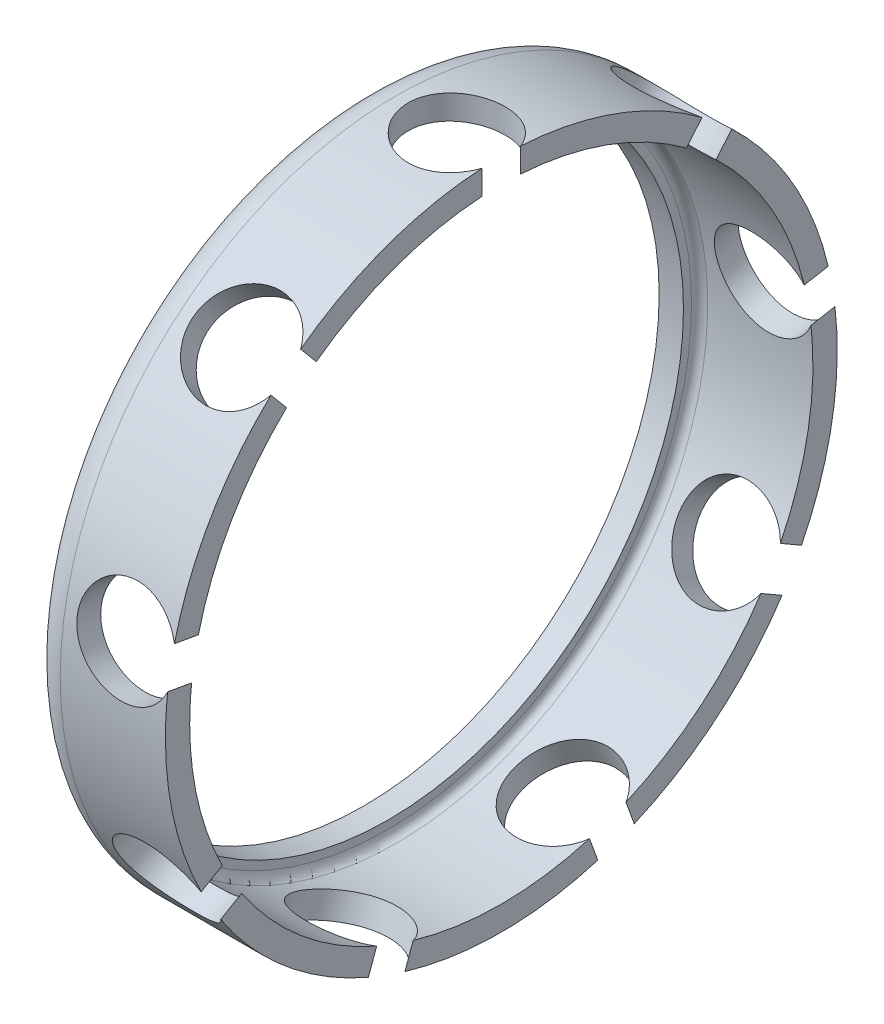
ISO-10303-21;
HEADER;
FILE_DESCRIPTION(('STEP AP214'),'2;1');
FILE_NAME('part.step','',(''),(''),'','','');
FILE_SCHEMA(('AUTOMOTIVE_DESIGN { 1 0 10303 214 1 1 1 1 }'));
ENDSEC;
DATA;
#1=APPLICATION_CONTEXT('core data for automotive mechanical design processes');
#2=APPLICATION_PROTOCOL_DEFINITION('international standard','automotive_design',2000,#1);
#3=PRODUCT_CONTEXT('',#1,'mechanical');
#4=PRODUCT('Part','Part','',(#3));
#5=PRODUCT_RELATED_PRODUCT_CATEGORY('part','',(#4));
#6=PRODUCT_DEFINITION_FORMATION('','',#4);
#7=PRODUCT_DEFINITION_CONTEXT('part definition',#1,'design');
#8=PRODUCT_DEFINITION('design','',#6,#7);
#9=PRODUCT_DEFINITION_SHAPE('','',#8);
#10=(LENGTH_UNIT() NAMED_UNIT(*) SI_UNIT(.MILLI.,.METRE.));
#11=(NAMED_UNIT(*) PLANE_ANGLE_UNIT() SI_UNIT($,.RADIAN.));
#12=(NAMED_UNIT(*) SI_UNIT($,.STERADIAN.) SOLID_ANGLE_UNIT());
#13=UNCERTAINTY_MEASURE_WITH_UNIT(LENGTH_MEASURE(1.E-05),#10,'distance_accuracy_value','');
#14=(GEOMETRIC_REPRESENTATION_CONTEXT(3) GLOBAL_UNCERTAINTY_ASSIGNED_CONTEXT((#13)) GLOBAL_UNIT_ASSIGNED_CONTEXT((#10,
#11,#12)) REPRESENTATION_CONTEXT('',''));
#15=CARTESIAN_POINT('',(0.,0.,0.));
#16=DIRECTION('',(0.,0.,1.));
#17=DIRECTION('',(1.,0.,0.));
#18=AXIS2_PLACEMENT_3D('',#15,#16,#17);
#19=CARTESIAN_POINT('',(0.549999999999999,4.15,0.));
#20=DIRECTION('',(-1.,0.,0.));
#21=DIRECTION('',(0.,0.,1.));
#22=AXIS2_PLACEMENT_3D('',#19,#20,#21);
#23=PLANE('',#22);
#24=DIRECTION('',(0.,0.766044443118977,0.642787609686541));
#25=VECTOR('',#24,1.);
#26=CARTESIAN_POINT('',(0.549999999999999,0.611909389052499,0.82647861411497));
#27=LINE('',#26,#25);
#28=CARTESIAN_POINT('',(0.549999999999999,2.78941003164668,2.65361860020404));
#29=VERTEX_POINT('',#28);
#30=CARTESIAN_POINT('',(0.549999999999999,3.01963801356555,2.84680281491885));
#31=VERTEX_POINT('',#30);
#32=EDGE_CURVE('E501',#29,#31,#27,.T.);
#33=ORIENTED_EDGE('',*,*,#32,.T.);
#34=CARTESIAN_POINT('',(0.549999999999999,0.,0.));
#35=DIRECTION('',(-1.,0.,0.));
#36=DIRECTION('',(0.,0.,1.));
#37=AXIS2_PLACEMENT_3D('',#34,#35,#36);
#38=CIRCLE('',#37,4.15);
#39=CARTESIAN_POINT('',(0.549999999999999,0.955584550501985,4.03848463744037));
#40=VERTEX_POINT('',#39);
#41=EDGE_CURVE('E513',#40,#31,#38,.T.);
#42=ORIENTED_EDGE('',*,*,#41,.F.);
#43=DIRECTION('',(0.,0.173648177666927,0.984807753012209));
#44=VECTOR('',#43,1.);
#45=CARTESIAN_POINT('',(0.549999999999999,0.903396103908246,3.74250924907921));
#46=LINE('',#45,#44);
#47=CARTESIAN_POINT('',(0.549999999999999,0.903396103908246,3.74250924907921));
#48=VERTEX_POINT('',#47);
#49=EDGE_CURVE('E172',#48,#40,#46,.T.);
#50=ORIENTED_EDGE('',*,*,#49,.F.);
#51=CARTESIAN_POINT('',(0.549999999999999,0.,0.));
#52=DIRECTION('',(-1.,0.,0.));
#53=DIRECTION('',(0.,0.,1.));
#54=AXIS2_PLACEMENT_3D('',#51,#52,#53);
#55=CIRCLE('',#54,3.85);
#56=EDGE_CURVE('E169',#29,#48,#55,.F.);
#57=ORIENTED_EDGE('',*,*,#56,.F.);
#58=EDGE_LOOP('',(#33,#42,#50,#57));
#59=FACE_BOUND('',#58,.T.);
#60=ADVANCED_FACE('F17',(#59),#23,.F.);
#61=CARTESIAN_POINT('',(0.,0.766044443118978,0.642787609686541));
#62=DIRECTION('',(0.,0.766044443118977,0.642787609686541));
#63=DIRECTION('',(0.,-0.642787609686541,0.766044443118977));
#64=AXIS2_PLACEMENT_3D('',#61,#62,#63);
#65=CYLINDRICAL_SURFACE('',#64,0.6);
#66=CARTESIAN_POINT('',(0.549999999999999,3.09768013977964,2.28623659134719));
#67=CARTESIAN_POINT('',(0.536497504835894,3.11615288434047,2.26122143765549));
#68=CARTESIAN_POINT('',(0.520335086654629,3.1336130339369,2.23691547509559));
#69=CARTESIAN_POINT('',(0.483273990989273,3.16622138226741,2.19050887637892));
#70=CARTESIAN_POINT('',(0.462380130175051,3.18137190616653,2.16840603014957));
#71=CARTESIAN_POINT('',(0.416405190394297,3.2091157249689,2.12713442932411));
#72=CARTESIAN_POINT('',(0.391323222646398,3.22170847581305,2.10796629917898));
#73=CARTESIAN_POINT('',(0.337664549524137,3.24416440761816,2.07324020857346));
#74=CARTESIAN_POINT('',(0.309086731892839,3.25402671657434,2.05768340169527));
#75=CARTESIAN_POINT('',(0.249193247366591,3.27090506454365,2.03074725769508));
#76=CARTESIAN_POINT('',(0.217873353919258,3.27791661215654,2.01937451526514));
#77=CARTESIAN_POINT('',(0.153454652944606,3.2889814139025,2.00130332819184));
#78=CARTESIAN_POINT('',(0.120359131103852,3.29303994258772,1.99459655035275));
#79=CARTESIAN_POINT('',(0.0724965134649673,3.29670553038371,1.98852607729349));
#80=CARTESIAN_POINT('',(0.058045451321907,3.29753121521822,1.9871560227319));
#81=CARTESIAN_POINT('',(0.0290652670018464,3.29863279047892,1.98532687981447));
#82=CARTESIAN_POINT('',(0.0145361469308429,3.29890869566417,1.98486776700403));
#83=CARTESIAN_POINT('',(-0.0334571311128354,3.29890792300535,1.98487018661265));
#84=CARTESIAN_POINT('',(-0.0669514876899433,3.2974445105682,1.98730794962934));
#85=CARTESIAN_POINT('',(-0.133022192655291,3.2916001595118,1.99697245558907));
#86=CARTESIAN_POINT('',(-0.165596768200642,3.2872139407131,2.00420786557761));
#87=CARTESIAN_POINT('',(-0.228832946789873,3.27557426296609,2.02317478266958));
#88=CARTESIAN_POINT('',(-0.259496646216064,3.26832401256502,2.03490125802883));
#89=CARTESIAN_POINT('',(-0.31808883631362,3.25104161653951,2.06239929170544));
#90=CARTESIAN_POINT('',(-0.346018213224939,3.24101037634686,2.07816953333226));
#91=CARTESIAN_POINT('',(-0.398603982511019,3.2181992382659,2.11332317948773));
#92=CARTESIAN_POINT('',(-0.423233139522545,3.20539850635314,2.13273381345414));
#93=CARTESIAN_POINT('',(-0.468283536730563,3.17727586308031,2.17440768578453));
#94=CARTESIAN_POINT('',(-0.488704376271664,3.16195371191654,2.19667119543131));
#95=CARTESIAN_POINT('',(-0.52485710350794,3.12895845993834,2.24342160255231));
#96=CARTESIAN_POINT('',(-0.540564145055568,3.11127358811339,2.26791942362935));
#97=CARTESIAN_POINT('',(-0.566683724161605,3.07396976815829,2.31822979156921));
#98=CARTESIAN_POINT('',(-0.577096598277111,3.05435094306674,2.34404225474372));
#99=CARTESIAN_POINT('',(-0.592250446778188,3.01380549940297,2.39594482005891));
#100=CARTESIAN_POINT('',(-0.597036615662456,2.99289074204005,2.42203098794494));
#101=CARTESIAN_POINT('',(-0.600941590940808,2.95016704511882,2.47389222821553));
#102=CARTESIAN_POINT('',(-0.600060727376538,2.92835815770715,2.49966731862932));
#103=CARTESIAN_POINT('',(-0.592692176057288,2.88467677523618,2.54994899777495));
#104=CARTESIAN_POINT('',(-0.586253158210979,2.86280647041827,2.57446464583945));
#105=CARTESIAN_POINT('',(-0.568027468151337,2.8194936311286,2.62182879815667));
#106=CARTESIAN_POINT('',(-0.556240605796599,2.79805111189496,2.64467724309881));
#107=CARTESIAN_POINT('',(-0.527604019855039,2.75620993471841,2.68825668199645));
#108=CARTESIAN_POINT('',(-0.510733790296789,2.73581590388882,2.70897863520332));
#109=CARTESIAN_POINT('',(-0.47242580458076,2.69686811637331,2.74775521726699));
#110=CARTESIAN_POINT('',(-0.450988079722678,2.6783143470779,2.76580986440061));
#111=CARTESIAN_POINT('',(-0.403886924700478,2.64353147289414,2.79907622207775));
#112=CARTESIAN_POINT('',(-0.378181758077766,2.62732862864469,2.81425632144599));
#113=CARTESIAN_POINT('',(-0.323402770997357,2.59809901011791,2.84126363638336));
#114=CARTESIAN_POINT('',(-0.294327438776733,2.58507366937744,2.85308933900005));
#115=CARTESIAN_POINT('',(-0.23357782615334,2.56271930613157,2.87318584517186));
#116=CARTESIAN_POINT('',(-0.201899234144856,2.55339657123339,2.88145060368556));
#117=CARTESIAN_POINT('',(-0.136938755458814,2.53889724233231,2.89423495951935));
#118=CARTESIAN_POINT('',(-0.103660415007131,2.5337118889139,2.89876246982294));
#119=CARTESIAN_POINT('',(-0.0468152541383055,2.52860942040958,2.90321191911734));
#120=CARTESIAN_POINT('',(-0.0234137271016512,2.52756168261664,2.90412279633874));
#121=CARTESIAN_POINT('',(0.033460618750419,2.52756568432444,2.90412045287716));
#122=CARTESIAN_POINT('',(0.066946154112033,2.5297112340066,2.9022567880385));
#123=CARTESIAN_POINT('',(0.133013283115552,2.5382127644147,2.89482406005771));
#124=CARTESIAN_POINT('',(0.16559290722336,2.54457726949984,2.88924749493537));
#125=CARTESIAN_POINT('',(0.22883108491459,2.56123509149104,2.87449088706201));
#126=CARTESIAN_POINT('',(0.259492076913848,2.57152329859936,2.86531553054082));
#127=CARTESIAN_POINT('',(0.318084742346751,2.595602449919,2.84352073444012));
#128=CARTESIAN_POINT('',(0.346016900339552,2.60939277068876,2.83090190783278));
#129=CARTESIAN_POINT('',(0.398618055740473,2.64005916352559,2.80232580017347));
#130=CARTESIAN_POINT('',(0.423258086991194,2.6569598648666,2.78634171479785));
#131=CARTESIAN_POINT('',(0.468308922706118,2.69312664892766,2.7513991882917));
#132=CARTESIAN_POINT('',(0.488724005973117,2.71239030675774,2.73244379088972));
#133=CARTESIAN_POINT('',(0.514983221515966,2.74166649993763,2.70294953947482));
#134=CARTESIAN_POINT('',(0.522727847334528,2.75103456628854,2.69341692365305));
#135=CARTESIAN_POINT('',(0.537159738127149,2.77003537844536,2.67387165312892));
#136=CARTESIAN_POINT('',(0.543848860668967,2.77966762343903,2.66385988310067));
#137=CARTESIAN_POINT('',(0.550000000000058,2.78941003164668,2.6536186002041));
#138=B_SPLINE_CURVE_WITH_KNOTS('',3,(#66,#67,#68,#69,#70,#71,#72,#73,#74,#75,#76,#77,#78,#79,
#80,#81,#82,#83,#84,#85,#86,#87,#88,#89,#90,#91,#92,#93,#94,#95,#96,#97,#98,#99,#100,#101,#102,
#103,#104,#105,#106,#107,#108,#109,#110,#111,#112,#113,#114,#115,#116,#117,#118,#119,#120,#121,
#122,#123,#124,#125,#126,#127,#128,#129,#130,#131,#132,#133,#134,#135,#136,#137),.UNSPECIFIED.,
.F.,.F.,(4,2,2,2,2,2,2,2,2,2,2,2,2,2,2,2,2,2,2,2,2,2,2,2,2,2,2,2,2,2,2,2,2,2,2,4),(0.,
0.101561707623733,0.203020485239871,0.30450082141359,0.406013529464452,0.507685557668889,
0.609175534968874,0.652761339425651,0.696345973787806,0.796662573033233,0.897160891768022,
0.997546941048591,1.09790034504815,1.1990366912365,1.30018266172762,1.40185276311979,
1.50351640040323,1.60435775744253,1.70519324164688,1.80515461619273,1.90511954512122,
2.00549325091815,2.10586626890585,2.20728603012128,2.3087514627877,2.41038847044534,
2.51180972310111,2.58199769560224,2.68230351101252,2.78281261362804,2.88319126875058,
2.98355206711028,3.0847447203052,3.18583438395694,3.23213685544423,3.27835690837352),.UNSPECIFIED.);
#139=CARTESIAN_POINT('',(0.549999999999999,3.09768013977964,2.28623659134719));
#140=VERTEX_POINT('',#139);
#141=EDGE_CURVE('E496',#140,#29,#138,.T.);
#142=ORIENTED_EDGE('',*,*,#141,.F.);
#143=DIRECTION('',(0.,0.766044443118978,0.642787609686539));
#144=VECTOR('',#143,1.);
#145=CARTESIAN_POINT('',(0.549999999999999,3.09768013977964,2.28623659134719));
#146=LINE('',#145,#144);
#147=CARTESIAN_POINT('',(0.549999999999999,3.32790812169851,2.479420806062));
#148=VERTEX_POINT('',#147);
#149=EDGE_CURVE('E495',#140,#148,#146,.T.);
#150=ORIENTED_EDGE('',*,*,#149,.T.);
#151=CARTESIAN_POINT('',(0.549999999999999,3.01963801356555,2.84680281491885));
#152=CARTESIAN_POINT('',(0.536502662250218,2.99832543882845,2.86942060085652));
#153=CARTESIAN_POINT('',(0.52034544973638,2.97755109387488,2.8909358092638));
#154=CARTESIAN_POINT('',(0.483294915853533,2.93778990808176,2.93132671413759));
#155=CARTESIAN_POINT('',(0.462406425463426,2.91880127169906,2.95020507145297));
#156=CARTESIAN_POINT('',(0.416441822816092,2.88327222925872,2.98493966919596));
#157=CARTESIAN_POINT('',(0.391364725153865,2.86673240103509,3.00079519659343));
#158=CARTESIAN_POINT('',(0.337718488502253,2.83672174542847,3.02918082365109));
#159=CARTESIAN_POINT('',(0.309148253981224,2.82325188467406,3.04170987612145));
#160=CARTESIAN_POINT('',(0.249278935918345,2.79990485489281,3.06321504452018));
#161=CARTESIAN_POINT('',(0.217975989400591,2.7900328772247,3.07218602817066));
#162=CARTESIAN_POINT('',(0.153596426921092,2.7743331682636,3.08637147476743));
#163=CARTESIAN_POINT('',(0.12052305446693,2.76849829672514,3.09159257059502));
#164=CARTESIAN_POINT('',(0.0726525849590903,2.76320605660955,3.09631969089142));
#165=CARTESIAN_POINT('',(0.0581704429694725,2.76200907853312,3.09738712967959));
#166=CARTESIAN_POINT('',(0.0291278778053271,2.76041092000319,3.09881149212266));
#167=CARTESIAN_POINT('',(0.0145674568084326,2.76000971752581,3.09916843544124));
#168=CARTESIAN_POINT('',(-0.0334889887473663,2.76001190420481,3.09916721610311));
#169=CARTESIAN_POINT('',(-0.0670151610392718,2.7621372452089,3.09727800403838));
#170=CARTESIAN_POINT('',(-0.133149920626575,2.77055832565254,3.08974710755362));
#171=CARTESIAN_POINT('',(-0.165756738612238,2.77686160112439,3.08409864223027));
#172=CARTESIAN_POINT('',(-0.22905800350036,2.7933688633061,3.06915517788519));
#173=CARTESIAN_POINT('',(-0.259754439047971,2.80356871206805,3.0598640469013));
#174=CARTESIAN_POINT('',(-0.31840602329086,2.82745224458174,3.03780788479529));
#175=CARTESIAN_POINT('',(-0.346362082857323,2.84113476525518,3.02504401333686));
#176=CARTESIAN_POINT('',(-0.398961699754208,2.87155991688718,2.99617841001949));
#177=CARTESIAN_POINT('',(-0.423581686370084,2.88832253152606,2.98005478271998));
#178=CARTESIAN_POINT('',(-0.468606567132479,2.92422312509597,2.944834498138));
#179=CARTESIAN_POINT('',(-0.489011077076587,2.94336132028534,2.92573757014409));
#180=CARTESIAN_POINT('',(-0.525109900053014,2.98342030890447,2.88487853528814));
#181=CARTESIAN_POINT('',(-0.540782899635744,3.00434863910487,2.86310497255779));
#182=CARTESIAN_POINT('',(-0.566836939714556,3.04719204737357,2.81746324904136));
#183=CARTESIAN_POINT('',(-0.577218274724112,3.06910707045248,2.79359520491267));
#184=CARTESIAN_POINT('',(-0.592324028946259,3.11304791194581,2.74454165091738));
#185=CARTESIAN_POINT('',(-0.597087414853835,3.1350718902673,2.71936649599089));
#186=CARTESIAN_POINT('',(-0.600942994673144,3.17870338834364,2.6682342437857));
#187=CARTESIAN_POINT('',(-0.600035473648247,3.20031092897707,2.64227718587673));
#188=CARTESIAN_POINT('',(-0.592605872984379,3.24233699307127,2.59053160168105));
#189=CARTESIAN_POINT('',(-0.586125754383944,3.26276318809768,2.56474326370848));
#190=CARTESIAN_POINT('',(-0.567800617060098,3.30208389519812,2.51391628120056));
#191=CARTESIAN_POINT('',(-0.555955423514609,3.32097835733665,2.48887766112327));
#192=CARTESIAN_POINT('',(-0.527192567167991,3.35687805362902,2.44024333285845));
#193=CARTESIAN_POINT('',(-0.510256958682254,3.3738763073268,2.41665309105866));
#194=CARTESIAN_POINT('',(-0.471808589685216,3.40557528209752,2.37177422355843));
#195=CARTESIAN_POINT('',(-0.45029590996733,3.42027604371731,2.35048555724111));
#196=CARTESIAN_POINT('',(-0.403074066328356,3.44725506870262,2.31073922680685));
#197=CARTESIAN_POINT('',(-0.377329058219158,3.45951046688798,2.29230861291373));
#198=CARTESIAN_POINT('',(-0.322481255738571,3.48125340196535,2.25915235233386));
#199=CARTESIAN_POINT('',(-0.293376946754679,3.490739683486,2.24442838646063));
#200=CARTESIAN_POINT('',(-0.232590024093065,3.50681978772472,2.21922050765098));
#201=CARTESIAN_POINT('',(-0.200903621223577,3.5134092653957,2.20874296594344));
#202=CARTESIAN_POINT('',(-0.135943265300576,3.523578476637,2.19248453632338));
#203=CARTESIAN_POINT('',(-0.102672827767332,3.52716457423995,2.18669371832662));
#204=CARTESIAN_POINT('',(-0.0461619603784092,3.53064899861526,2.18105988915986));
#205=CARTESIAN_POINT('',(-0.0230870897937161,3.5313562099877,2.17991297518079));
#206=CARTESIAN_POINT('',(0.0334917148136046,3.53135449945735,2.17991728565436));
#207=CARTESIAN_POINT('',(0.0670091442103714,3.52986373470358,2.18233714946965));
#208=CARTESIAN_POINT('',(0.133140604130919,3.52391044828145,2.19193648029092));
#209=CARTESIAN_POINT('',(0.165752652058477,3.51944186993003,2.19912564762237));
#210=CARTESIAN_POINT('',(0.22905617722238,3.50759167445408,2.21797742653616));
#211=CARTESIAN_POINT('',(0.259749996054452,3.50021369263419,2.22963445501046));
#212=CARTESIAN_POINT('',(0.3184020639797,3.48263994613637,2.25698510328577));
#213=CARTESIAN_POINT('',(0.346360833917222,3.47244471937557,2.27267795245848));
#214=CARTESIAN_POINT('',(0.398975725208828,3.44929520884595,2.30766225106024));
#215=CARTESIAN_POINT('',(0.423606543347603,3.43632153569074,2.32697886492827));
#216=CARTESIAN_POINT('',(0.468631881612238,3.40786162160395,2.36846114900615));
#217=CARTESIAN_POINT('',(0.489030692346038,3.39237795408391,2.39062389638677));
#218=CARTESIAN_POINT('',(0.515210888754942,3.36824392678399,2.42437669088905));
#219=CARTESIAN_POINT('',(0.522901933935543,3.36046565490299,2.43514975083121));
#220=CARTESIAN_POINT('',(0.537238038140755,3.3444940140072,2.45703951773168));
#221=CARTESIAN_POINT('',(0.543884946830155,3.33630141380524,2.46815557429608));
#222=CARTESIAN_POINT('',(0.550000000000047,3.32790812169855,2.47942080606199));
#223=B_SPLINE_CURVE_WITH_KNOTS('',3,(#151,#152,#153,#154,#155,#156,#157,#158,#159,#160,#161,
#162,#163,#164,#165,#166,#167,#168,#169,#170,#171,#172,#173,#174,#175,#176,#177,#178,#179,#180,
#181,#182,#183,#184,#185,#186,#187,#188,#189,#190,#191,#192,#193,#194,#195,#196,#197,#198,#199,
#200,#201,#202,#203,#204,#205,#206,#207,#208,#209,#210,#211,#212,#213,#214,#215,#216,#217,#218,
#219,#220,#221,#222),.UNSPECIFIED.,.F.,.F.,(4,2,2,2,2,2,2,2,2,2,2,2,2,2,2,2,2,2,2,2,2,2,2,2,2,2,
2,2,2,2,2,2,2,2,2,4),(0.,0.101503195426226,0.202903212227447,0.304327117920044,
0.405782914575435,0.507384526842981,0.608805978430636,0.652485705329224,0.696164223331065,
0.796576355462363,0.897170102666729,0.997657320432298,1.09811102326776,1.19924108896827,
1.30038036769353,1.40196866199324,1.50355130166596,1.60442513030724,1.70529388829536,
1.80540970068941,1.90552877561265,2.00600503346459,2.1064795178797,2.20785348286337,
2.30927333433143,2.41084479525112,2.51220048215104,2.58141031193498,2.68181083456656,
2.78241619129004,2.88289623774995,2.9833571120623,3.084543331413,3.18562645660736,
3.23164742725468,3.27758593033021),.UNSPECIFIED.);
#224=EDGE_CURVE('E508',#31,#148,#223,.T.);
#225=ORIENTED_EDGE('',*,*,#224,.F.);
#226=ORIENTED_EDGE('',*,*,#32,.F.);
#227=EDGE_LOOP('',(#142,#150,#225,#226));
#228=FACE_BOUND('',#227,.T.);
#229=ADVANCED_FACE('F502',(#228),#65,.F.);
#230=CARTESIAN_POINT('',(0.549999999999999,4.15,0.));
#231=DIRECTION('',(-1.,0.,0.));
#232=DIRECTION('',(0.,0.,1.));
#233=AXIS2_PLACEMENT_3D('',#230,#231,#232);
#234=PLANE('',#233);
#235=ORIENTED_EDGE('',*,*,#149,.F.);
#236=CARTESIAN_POINT('',(0.549999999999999,0.,0.));
#237=DIRECTION('',(-1.,0.,0.));
#238=DIRECTION('',(0.,0.,1.));
#239=AXIS2_PLACEMENT_3D('',#236,#237,#238);
#240=CIRCLE('',#239,3.85);
#241=CARTESIAN_POINT('',(0.549999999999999,3.84252521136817,0.239791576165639));
#242=VERTEX_POINT('',#241);
#243=EDGE_CURVE('E493',#242,#140,#240,.F.);
#244=ORIENTED_EDGE('',*,*,#243,.F.);
#245=DIRECTION('',(0.,1.,0.));
#246=VECTOR('',#245,1.);
#247=CARTESIAN_POINT('',(0.549999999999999,1.,0.239791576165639));
#248=LINE('',#247,#246);
#249=CARTESIAN_POINT('',(0.549999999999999,4.14306649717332,0.239791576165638));
#250=VERTEX_POINT('',#249);
#251=EDGE_CURVE('E492',#242,#250,#248,.T.);
#252=ORIENTED_EDGE('',*,*,#251,.T.);
#253=CARTESIAN_POINT('',(0.549999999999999,0.,0.));
#254=DIRECTION('',(-1.,0.,0.));
#255=DIRECTION('',(0.,0.,1.));
#256=AXIS2_PLACEMENT_3D('',#253,#254,#255);
#257=CIRCLE('',#256,4.15);
#258=EDGE_CURVE('E476',#148,#250,#257,.T.);
#259=ORIENTED_EDGE('',*,*,#258,.F.);
#260=EDGE_LOOP('',(#235,#244,#252,#259));
#261=FACE_BOUND('',#260,.T.);
#262=ADVANCED_FACE('F482',(#261),#234,.F.);
#263=CARTESIAN_POINT('',(0.,1.,0.));
#264=DIRECTION('',(0.,1.,0.));
#265=DIRECTION('',(0.,0.,1.));
#266=AXIS2_PLACEMENT_3D('',#263,#264,#265);
#267=CYLINDRICAL_SURFACE('',#266,0.6);
#268=CARTESIAN_POINT('',(0.549999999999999,3.84252521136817,-0.239791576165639));
#269=CARTESIAN_POINT('',(0.536497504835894,3.84059672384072,-0.270828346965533));
#270=CARTESIAN_POINT('',(0.520335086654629,3.83834840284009,-0.300670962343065));
#271=CARTESIAN_POINT('',(0.483273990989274,3.83349826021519,-0.357180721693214));
#272=CARTESIAN_POINT('',(0.462380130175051,3.83089679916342,-0.383851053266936));
#273=CARTESIAN_POINT('',(0.416405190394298,3.82562092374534,-0.433300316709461));
#274=CARTESIAN_POINT('',(0.391323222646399,3.82294649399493,-0.456078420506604));
#275=CARTESIAN_POINT('',(0.337664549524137,3.81782723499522,-0.497114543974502));
#276=CARTESIAN_POINT('',(0.30908673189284,3.81538247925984,-0.515371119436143));
#277=CARTESIAN_POINT('',(0.249193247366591,3.8109978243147,-0.546854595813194));
#278=CARTESIAN_POINT('',(0.217873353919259,3.80905872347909,-0.560073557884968));
#279=CARTESIAN_POINT('',(0.153454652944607,3.80591891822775,-0.581029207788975));
#280=CARTESIAN_POINT('',(0.120359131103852,3.80471689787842,-0.588775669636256));
#281=CARTESIAN_POINT('',(0.0724965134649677,3.80362287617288,-0.595782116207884));
#282=CARTESIAN_POINT('',(0.0580454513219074,3.80337473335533,-0.597362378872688));
#283=CARTESIAN_POINT('',(0.0290652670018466,3.8030428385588,-0.599471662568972));
#284=CARTESIAN_POINT('',(0.014536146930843,3.8029590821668,-0.600000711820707));
#285=CARTESIAN_POINT('',(-0.0334571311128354,3.80296004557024,-0.599998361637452));
#286=CARTESIAN_POINT('',(-0.0669514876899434,3.80340597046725,-0.597190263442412));
#287=CARTESIAN_POINT('',(-0.133022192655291,3.80514116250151,-0.586030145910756));
#288=CARTESIAN_POINT('',(-0.165596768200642,3.8064319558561,-0.577668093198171));
#289=CARTESIAN_POINT('',(-0.228832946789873,3.80970714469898,-0.555656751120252));
#290=CARTESIAN_POINT('',(-0.259496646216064,3.81169076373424,-0.542013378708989));
#291=CARTESIAN_POINT('',(-0.31808883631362,3.81612707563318,-0.509839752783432));
#292=CARTESIAN_POINT('',(-0.346018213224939,3.8185796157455,-0.491311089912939));
#293=CARTESIAN_POINT('',(-0.398603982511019,3.8237015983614,-0.449719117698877));
#294=CARTESIAN_POINT('',(-0.423233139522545,3.82637258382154,-0.426621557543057));
#295=CARTESIAN_POINT('',(-0.468283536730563,3.83161683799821,-0.376620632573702));
#296=CARTESIAN_POINT('',(-0.488704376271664,3.83419009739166,-0.349716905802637));
#297=CARTESIAN_POINT('',(-0.52485710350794,3.83896485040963,-0.292695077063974));
#298=CARTESIAN_POINT('',(-0.540564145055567,3.8411643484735,-0.262561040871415));
#299=CARTESIAN_POINT('',(-0.566683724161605,3.84492684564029,-0.200042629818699));
#300=CARTESIAN_POINT('',(-0.577096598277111,3.84648988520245,-0.167658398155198));
#301=CARTESIAN_POINT('',(-0.592250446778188,3.84879259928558,-0.101836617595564));
#302=CARTESIAN_POINT('',(-0.597036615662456,3.84953883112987,-0.0684097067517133));
#303=CARTESIAN_POINT('',(-0.600941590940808,3.85014634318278,-0.0012194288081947));
#304=CARTESIAN_POINT('',(-0.600060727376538,3.85000767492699,0.0325439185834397));
#305=CARTESIAN_POINT('',(-0.592692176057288,3.84886623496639,0.0991397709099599));
#306=CARTESIAN_POINT('',(-0.586253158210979,3.84787096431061,0.131977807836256));
#307=CARTESIAN_POINT('',(-0.568027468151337,3.84513649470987,0.196101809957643));
#308=CARTESIAN_POINT('',(-0.556240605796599,3.84339726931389,0.227387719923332));
#309=CARTESIAN_POINT('',(-0.527604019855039,3.83935739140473,0.287666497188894));
#310=CARTESIAN_POINT('',(-0.510733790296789,3.8370544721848,0.316649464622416));
#311=CARTESIAN_POINT('',(-0.47242580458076,3.83214384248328,0.37138920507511));
#312=CARTESIAN_POINT('',(-0.450988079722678,3.82953613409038,0.397146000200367));
#313=CARTESIAN_POINT('',(-0.403886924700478,3.82427410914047,0.44498750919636));
#314=CARTESIAN_POINT('',(-0.378181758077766,3.82161959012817,0.467031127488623));
#315=CARTESIAN_POINT('',(-0.323402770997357,3.81658837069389,0.506508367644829));
#316=CARTESIAN_POINT('',(-0.294327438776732,3.81421179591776,0.523939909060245));
#317=CARTESIAN_POINT('',(-0.233577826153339,3.81000514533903,0.553703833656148));
#318=CARTESIAN_POINT('',(-0.201899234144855,3.80817600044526,0.566027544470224));
#319=CARTESIAN_POINT('',(-0.136938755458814,3.80528649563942,0.585140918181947));
#320=CARTESIAN_POINT('',(-0.103660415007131,3.80422451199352,0.591942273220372));
#321=CARTESIAN_POINT('',(-0.0468152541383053,3.80317584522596,0.598630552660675));
#322=CARTESIAN_POINT('',(-0.0234137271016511,3.80295873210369,0.600001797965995));
#323=CARTESIAN_POINT('',(0.0334606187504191,3.80296029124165,0.599997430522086));
#324=CARTESIAN_POINT('',(0.0669461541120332,3.80340593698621,0.597190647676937));
#325=CARTESIAN_POINT('',(0.133013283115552,3.80514082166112,0.586032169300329));
#326=CARTESIAN_POINT('',(0.16559290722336,3.80643176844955,0.577669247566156));
#327=CARTESIAN_POINT('',(0.228831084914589,3.80970703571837,0.555657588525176));
#328=CARTESIAN_POINT('',(0.259492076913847,3.81169045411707,0.542015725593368));
#329=CARTESIAN_POINT('',(0.318084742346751,3.81612672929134,0.509842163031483));
#330=CARTESIAN_POINT('',(0.346016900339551,3.81857950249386,0.491311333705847));
#331=CARTESIAN_POINT('',(0.398618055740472,3.82370295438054,0.449708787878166));
#332=CARTESIAN_POINT('',(0.423258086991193,3.82637527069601,0.426600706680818));
#333=CARTESIAN_POINT('',(0.468308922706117,3.83162001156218,0.376585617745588));
#334=CARTESIAN_POINT('',(0.488724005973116,3.83419253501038,0.349682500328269));
#335=CARTESIAN_POINT('',(0.514983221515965,3.83766086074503,0.30827021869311));
#336=CARTESIAN_POINT('',(0.522727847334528,3.83870976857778,0.294946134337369));
#337=CARTESIAN_POINT('',(0.537159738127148,3.84070177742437,0.267760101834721));
#338=CARTESIAN_POINT('',(0.543848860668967,3.84164506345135,0.253899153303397));
#339=CARTESIAN_POINT('',(0.550000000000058,3.84252521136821,0.239791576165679));
#340=B_SPLINE_CURVE_WITH_KNOTS('',3,(#268,#269,#270,#271,#272,#273,#274,#275,#276,#277,#278,
#279,#280,#281,#282,#283,#284,#285,#286,#287,#288,#289,#290,#291,#292,#293,#294,#295,#296,#297,
#298,#299,#300,#301,#302,#303,#304,#305,#306,#307,#308,#309,#310,#311,#312,#313,#314,#315,#316,
#317,#318,#319,#320,#321,#322,#323,#324,#325,#326,#327,#328,#329,#330,#331,#332,#333,#334,#335,
#336,#337,#338,#339),.UNSPECIFIED.,.F.,.F.,(4,2,2,2,2,2,2,2,2,2,2,2,2,2,2,2,2,2,2,2,2,2,2,2,2,2,
2,2,2,2,2,2,2,2,2,4),(0.,0.101561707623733,0.20302048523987,0.304500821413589,0.406013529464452,
0.507685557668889,0.609175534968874,0.652761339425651,0.696345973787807,0.796662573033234,
0.897160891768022,0.997546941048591,1.09790034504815,1.1990366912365,1.30018266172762,
1.40185276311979,1.50351640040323,1.60435775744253,1.70519324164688,1.80515461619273,
1.90511954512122,2.00549325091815,2.10586626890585,2.20728603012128,2.3087514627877,
2.41038847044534,2.51180972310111,2.58199769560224,2.68230351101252,2.78281261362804,
2.88319126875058,2.98355206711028,3.0847447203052,3.18583438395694,3.23213685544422,
3.27835690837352),.UNSPECIFIED.);
#341=CARTESIAN_POINT('',(0.549999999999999,3.84252521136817,-0.239791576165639));
#342=VERTEX_POINT('',#341);
#343=EDGE_CURVE('E486',#342,#242,#340,.T.);
#344=ORIENTED_EDGE('',*,*,#343,.F.);
#345=DIRECTION('',(0.,1.,0.));
#346=VECTOR('',#345,1.);
#347=CARTESIAN_POINT('',(0.549999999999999,4.15,-0.239791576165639));
#348=LINE('',#347,#346);
#349=CARTESIAN_POINT('',(0.549999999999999,4.14306649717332,-0.239791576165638));
#350=VERTEX_POINT('',#349);
#351=EDGE_CURVE('E491',#342,#350,#348,.T.);
#352=ORIENTED_EDGE('',*,*,#351,.T.);
#353=CARTESIAN_POINT('',(0.549999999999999,4.14306649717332,0.239791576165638));
#354=CARTESIAN_POINT('',(0.536502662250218,4.14127855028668,0.270817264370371));
#355=CARTESIAN_POINT('',(0.52034544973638,4.13919418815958,0.300652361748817));
#356=CARTESIAN_POINT('',(0.483294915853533,4.13469812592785,0.357151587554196));
#357=CARTESIAN_POINT('',(0.462406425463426,4.13228676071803,0.383818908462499));
#358=CARTESIAN_POINT('',(0.416441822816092,4.12739690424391,0.433264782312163));
#359=CARTESIAN_POINT('',(0.391364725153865,4.12491839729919,0.456042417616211));
#360=CARTESIAN_POINT('',(0.337718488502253,4.12017483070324,0.497077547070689));
#361=CARTESIAN_POINT('',(0.309148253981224,4.11790983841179,0.515333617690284));
#362=CARTESIAN_POINT('',(0.249278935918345,4.11384823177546,0.546814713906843));
#363=CARTESIAN_POINT('',(0.217975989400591,4.11205229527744,0.560032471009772));
#364=CARTESIAN_POINT('',(0.153596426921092,4.10914384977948,0.580990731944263));
#365=CARTESIAN_POINT('',(0.12052305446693,4.10803013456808,0.588740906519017));
#366=CARTESIAN_POINT('',(0.0726525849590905,4.10701457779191,0.595763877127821));
#367=CARTESIAN_POINT('',(0.0581704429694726,4.10678377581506,0.597350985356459));
#368=CARTESIAN_POINT('',(0.0291278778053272,4.10647507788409,0.599469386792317));
#369=CARTESIAN_POINT('',(0.0145674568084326,4.10639717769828,0.60000070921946));
#370=CARTESIAN_POINT('',(-0.0334889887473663,4.10639806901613,0.599998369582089));
#371=CARTESIAN_POINT('',(-0.0670151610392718,4.10681181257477,0.597185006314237));
#372=CARTESIAN_POINT('',(-0.133149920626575,4.10842196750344,0.586003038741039));
#373=CARTESIAN_POINT('',(-0.165756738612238,4.1096197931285,0.577624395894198));
#374=CARTESIAN_POINT('',(-0.22905800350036,4.1126596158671,0.555566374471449));
#375=CARTESIAN_POINT('',(-0.259754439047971,4.11450092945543,0.541892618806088));
#376=CARTESIAN_POINT('',(-0.31840602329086,4.11861934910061,0.509644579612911));
#377=CARTESIAN_POINT('',(-0.346362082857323,4.12089630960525,0.491071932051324));
#378=CARTESIAN_POINT('',(-0.398961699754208,4.12564887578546,0.44940268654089));
#379=CARTESIAN_POINT('',(-0.423581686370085,4.12812571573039,0.426276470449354));
#380=CARTESIAN_POINT('',(-0.468606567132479,4.13298800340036,0.376219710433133));
#381=CARTESIAN_POINT('',(-0.489011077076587,4.13537344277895,0.349288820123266));
#382=CARTESIAN_POINT('',(-0.525109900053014,4.13979672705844,0.292239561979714));
#383=CARTESIAN_POINT('',(-0.540782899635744,4.14183298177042,0.262107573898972));
#384=CARTESIAN_POINT('',(-0.566836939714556,4.14531500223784,0.199604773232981));
#385=CARTESIAN_POINT('',(-0.577218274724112,4.14676080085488,0.167234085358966));
#386=CARTESIAN_POINT('',(-0.592324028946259,4.14889042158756,0.101412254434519));
#387=CARTESIAN_POINT('',(-0.597087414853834,4.14957949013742,0.0679702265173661));
#388=CARTESIAN_POINT('',(-0.600942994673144,4.15013597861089,0.000754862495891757));
#389=CARTESIAN_POINT('',(-0.600035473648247,4.1500034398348,-0.0330184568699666));
#390=CARTESIAN_POINT('',(-0.592605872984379,4.14893585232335,-0.0996717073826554));
#391=CARTESIAN_POINT('',(-0.586125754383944,4.14800680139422,-0.132556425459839));
#392=CARTESIAN_POINT('',(-0.567800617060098,4.14545725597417,-0.196767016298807));
#393=CARTESIAN_POINT('',(-0.555955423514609,4.14383673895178,-0.228092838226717));
#394=CARTESIAN_POINT('',(-0.527192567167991,4.14007595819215,-0.288424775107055));
#395=CARTESIAN_POINT('',(-0.510256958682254,4.13793386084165,-0.317422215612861));
#396=CARTESIAN_POINT('',(-0.471808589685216,4.13336910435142,-0.372177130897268));
#397=CARTESIAN_POINT('',(-0.45029590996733,4.13094645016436,-0.397934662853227));
#398=CARTESIAN_POINT('',(-0.403074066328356,4.12606513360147,-0.445723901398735));
#399=CARTESIAN_POINT('',(-0.377329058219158,4.12360634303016,-0.467720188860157));
#400=CARTESIAN_POINT('',(-0.322481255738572,4.118949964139,-0.507095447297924));
#401=CARTESIAN_POINT('',(-0.293376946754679,4.11675249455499,-0.524472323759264));
#402=CARTESIAN_POINT('',(-0.232590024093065,4.11286725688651,-0.554118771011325));
#403=CARTESIAN_POINT('',(-0.200903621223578,4.11118025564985,-0.566380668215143));
#404=CARTESIAN_POINT('',(-0.135943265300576,4.10851960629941,-0.585371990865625));
#405=CARTESIAN_POINT('',(-0.102672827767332,4.10754445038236,-0.592113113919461));
#406=CARTESIAN_POINT('',(-0.0461619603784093,4.10659231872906,-0.598668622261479));
#407=CARTESIAN_POINT('',(-0.0230870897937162,4.1063968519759,-0.600001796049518));
#408=CARTESIAN_POINT('',(0.0334917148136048,4.10639831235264,-0.59999739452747));
#409=CARTESIAN_POINT('',(0.0670091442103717,4.10681177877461,-0.597185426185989));
#410=CARTESIAN_POINT('',(0.133140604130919,4.10842162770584,-0.586005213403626));
#411=CARTESIAN_POINT('',(0.165752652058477,4.10961960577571,-0.577625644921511));
#412=CARTESIAN_POINT('',(0.22905617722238,4.11265951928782,-0.555567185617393));
#413=CARTESIAN_POINT('',(0.259749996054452,4.1145006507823,-0.541894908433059));
#414=CARTESIAN_POINT('',(0.3184020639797,4.11861903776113,-0.509646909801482));
#415=CARTESIAN_POINT('',(0.346360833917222,4.12089620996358,-0.491072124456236));
#416=CARTESIAN_POINT('',(0.398975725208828,4.12565012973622,-0.449392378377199));
#417=CARTESIAN_POINT('',(0.423606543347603,4.1281281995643,-0.426255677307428));
#418=CARTESIAN_POINT('',(0.468631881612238,4.13299093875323,-0.376184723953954));
#419=CARTESIAN_POINT('',(0.489030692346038,4.13537570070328,-0.349254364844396));
#420=CARTESIAN_POINT('',(0.515210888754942,4.13858384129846,-0.307885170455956));
#421=CARTESIAN_POINT('',(0.522901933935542,4.13955012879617,-0.294632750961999));
#422=CARTESIAN_POINT('',(0.537238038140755,4.14138561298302,-0.267597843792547));
#423=CARTESIAN_POINT('',(0.543884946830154,4.14225498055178,-0.253816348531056));
#424=CARTESIAN_POINT('',(0.550000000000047,4.14306649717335,-0.239791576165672));
#425=B_SPLINE_CURVE_WITH_KNOTS('',3,(#353,#354,#355,#356,#357,#358,#359,#360,#361,#362,#363,
#364,#365,#366,#367,#368,#369,#370,#371,#372,#373,#374,#375,#376,#377,#378,#379,#380,#381,#382,
#383,#384,#385,#386,#387,#388,#389,#390,#391,#392,#393,#394,#395,#396,#397,#398,#399,#400,#401,
#402,#403,#404,#405,#406,#407,#408,#409,#410,#411,#412,#413,#414,#415,#416,#417,#418,#419,#420,
#421,#422,#423,#424),.UNSPECIFIED.,.F.,.F.,(4,2,2,2,2,2,2,2,2,2,2,2,2,2,2,2,2,2,2,2,2,2,2,2,2,2,
2,2,2,2,2,2,2,2,2,4),(0.,0.101503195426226,0.202903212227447,0.304327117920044,
0.405782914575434,0.507384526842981,0.608805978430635,0.652485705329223,0.696164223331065,
0.796576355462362,0.897170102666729,0.997657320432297,1.09811102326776,1.19924108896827,
1.30038036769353,1.40196866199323,1.50355130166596,1.60442513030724,1.70529388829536,
1.80540970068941,1.90552877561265,2.00600503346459,2.1064795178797,2.20785348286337,
2.30927333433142,2.41084479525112,2.51220048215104,2.58141031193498,2.68181083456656,
2.78241619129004,2.88289623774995,2.98335711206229,3.084543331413,3.18562645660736,
3.23164742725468,3.2775859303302),.UNSPECIFIED.);
#426=EDGE_CURVE('E470',#250,#350,#425,.T.);
#427=ORIENTED_EDGE('',*,*,#426,.F.);
#428=ORIENTED_EDGE('',*,*,#251,.F.);
#429=EDGE_LOOP('',(#344,#352,#427,#428));
#430=FACE_BOUND('',#429,.T.);
#431=ADVANCED_FACE('F478',(#430),#267,.F.);
#432=CARTESIAN_POINT('',(0.549999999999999,4.15,0.));
#433=DIRECTION('',(-1.,0.,0.));
#434=DIRECTION('',(0.,0.,1.));
#435=AXIS2_PLACEMENT_3D('',#432,#433,#434);
#436=PLANE('',#435);
#437=DIRECTION('',(0.,0.766044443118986,-0.64278760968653));
#438=VECTOR('',#437,1.);
#439=CARTESIAN_POINT('',(0.549999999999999,0.920179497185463,-0.4590966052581));
#440=LINE('',#439,#438);
#441=CARTESIAN_POINT('',(0.549999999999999,3.09768013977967,-2.28623659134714));
#442=VERTEX_POINT('',#441);
#443=CARTESIAN_POINT('',(0.549999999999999,3.32790812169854,-2.47942080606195));
#444=VERTEX_POINT('',#443);
#445=EDGE_CURVE('E450',#442,#444,#440,.T.);
#446=ORIENTED_EDGE('',*,*,#445,.T.);
#447=CARTESIAN_POINT('',(0.549999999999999,0.,0.));
#448=DIRECTION('',(-1.,0.,0.));
#449=DIRECTION('',(0.,0.,1.));
#450=AXIS2_PLACEMENT_3D('',#447,#448,#449);
#451=CIRCLE('',#450,4.15);
#452=EDGE_CURVE('E467',#350,#444,#451,.T.);
#453=ORIENTED_EDGE('',*,*,#452,.F.);
#454=ORIENTED_EDGE('',*,*,#351,.F.);
#455=CARTESIAN_POINT('',(0.549999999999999,0.,0.));
#456=DIRECTION('',(-1.,0.,0.));
#457=DIRECTION('',(0.,0.,1.));
#458=AXIS2_PLACEMENT_3D('',#455,#456,#457);
#459=CIRCLE('',#458,3.85);
#460=EDGE_CURVE('E451',#442,#342,#459,.F.);
#461=ORIENTED_EDGE('',*,*,#460,.F.);
#462=EDGE_LOOP('',(#446,#453,#454,#461));
#463=FACE_BOUND('',#462,.T.);
#464=ADVANCED_FACE('F457',(#463),#436,.F.);
#465=CARTESIAN_POINT('',(0.,0.766044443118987,-0.64278760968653));
#466=DIRECTION('',(0.,0.766044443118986,-0.64278760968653));
#467=DIRECTION('',(0.,0.64278760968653,0.766044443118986));
#468=AXIS2_PLACEMENT_3D('',#465,#466,#467);
#469=CYLINDRICAL_SURFACE('',#468,0.6);
#470=CARTESIAN_POINT('',(0.549999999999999,2.78941003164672,-2.653618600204));
#471=CARTESIAN_POINT('',(0.536497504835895,2.76798267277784,-2.67615453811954));
#472=CARTESIAN_POINT('',(0.520335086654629,2.74707789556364,-2.69757011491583));
#473=CARTESIAN_POINT('',(0.483273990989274,2.70703869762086,-2.73774149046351));
#474=CARTESIAN_POINT('',(0.462380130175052,2.68790250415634,-2.75649996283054));
#475=CARTESIAN_POINT('',(0.416405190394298,2.65207557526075,-2.79098902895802));
#476=CARTESIAN_POINT('',(0.391323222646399,2.63538536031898,-2.80671897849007));
#477=CARTESIAN_POINT('',(0.337664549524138,2.60508626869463,-2.83486387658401));
#478=CARTESIAN_POINT('',(0.30908673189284,2.59147837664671,-2.84727776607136));
#479=CARTESIAN_POINT('',(0.249193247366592,2.56788234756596,-2.86857710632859));
#480=CARTESIAN_POINT('',(0.217873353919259,2.55789992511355,-2.87745698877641));
#481=CARTESIAN_POINT('',(0.153454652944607,2.54202466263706,-2.89149172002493));
#482=CARTESIAN_POINT('',(0.120359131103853,2.5361245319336,-2.89665321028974));
#483=CARTESIAN_POINT('',(0.0724965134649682,2.53078280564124,-2.90131723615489));
#484=CARTESIAN_POINT('',(0.0580454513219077,2.52957694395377,-2.90236828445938));
#485=CARTESIAN_POINT('',(0.0290652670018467,2.52796687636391,-2.90377075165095));
#486=CARTESIAN_POINT('',(0.0145361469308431,2.5275626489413,-2.90412218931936));
#487=CARTESIAN_POINT('',(-0.0334571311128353,2.52756489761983,-2.90412100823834));
#488=CARTESIAN_POINT('',(-0.0669514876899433,2.52971150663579,-2.90225651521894));
#489=CARTESIAN_POINT('',(-0.133022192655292,2.53821432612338,-2.89482272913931));
#490=CARTESIAN_POINT('',(-0.165596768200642,2.54457815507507,-2.88924673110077));
#491=CARTESIAN_POINT('',(-0.228832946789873,2.56123571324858,-2.87449031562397));
#492=CARTESIAN_POINT('',(-0.259496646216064,2.57152504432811,-2.86531393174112));
#493=CARTESIAN_POINT('',(-0.318088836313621,2.59560426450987,-2.8435191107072));
#494=CARTESIAN_POINT('',(-0.346018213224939,2.60939301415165,-2.83090179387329));
#495=CARTESIAN_POINT('',(-0.398603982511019,2.64005148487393,-2.80233284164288));
#496=CARTESIAN_POINT('',(-0.423233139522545,2.65694440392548,-2.78635596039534));
#497=CARTESIAN_POINT('',(-0.468283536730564,2.69310171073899,-2.75142397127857));
#498=CARTESIAN_POINT('',(-0.488704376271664,2.71236632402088,-2.73246858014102));
#499=CARTESIAN_POINT('',(-0.52485710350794,2.75267692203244,-2.69185647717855));
#500=CARTESIAN_POINT('',(-0.540564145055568,2.77373162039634,-2.67018627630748));
#501=CARTESIAN_POINT('',(-0.566683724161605,2.81679992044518,-2.62471288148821));
#502=CARTESIAN_POINT('',(-0.577096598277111,2.83881346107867,-2.60090982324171));
#503=CARTESIAN_POINT('',(-0.592250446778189,2.88288686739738,-2.5519675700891));
#504=CARTESIAN_POINT('',(-0.597036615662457,2.9049449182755,-2.52684073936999));
#505=CARTESIAN_POINT('',(-0.600941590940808,2.94859937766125,-2.47576050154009));
#506=CARTESIAN_POINT('',(-0.600060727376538,2.97019581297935,-2.44980714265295));
#507=CARTESIAN_POINT('',(-0.592692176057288,3.01212840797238,-2.39805805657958));
#508=CARTESIAN_POINT('',(-0.58625315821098,3.03247386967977,-2.37226291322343));
#509=CARTESIAN_POINT('',(-0.568027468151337,3.07159725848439,-2.32138339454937));
#510=CARTESIAN_POINT('',(-0.5562406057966,3.09037512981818,-2.29629904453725));
#511=CARTESIAN_POINT('',(-0.527604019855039,3.12602685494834,-2.2475260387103));
#512=CARTESIAN_POINT('',(-0.510733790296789,3.14289260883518,-2.22384350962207));
#513=CARTESIAN_POINT('',(-0.47242580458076,3.17431687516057,-2.17875394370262));
#514=CARTESIAN_POINT('',(-0.450988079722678,3.18887540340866,-2.15734689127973));
#515=CARTESIAN_POINT('',(-0.403886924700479,3.21559638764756,-2.11731580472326));
#516=CARTESIAN_POINT('',(-0.378181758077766,3.22773227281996,-2.09872312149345));
#517=CARTESIAN_POINT('',(-0.323402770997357,3.24925361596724,-2.06524779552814));
#518=CARTESIAN_POINT('',(-0.294327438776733,3.2586378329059,-2.05036682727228));
#519=CARTESIAN_POINT('',(-0.233577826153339,3.27454723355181,-2.02486235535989));
#520=CARTESIAN_POINT('',(-0.201899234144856,3.28106755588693,-2.01424609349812));
#521=CARTESIAN_POINT('',(-0.136938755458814,3.29113990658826,-1.99774706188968));
#522=CARTESIAN_POINT('',(-0.103660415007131,3.2946982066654,-1.99185429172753));
#523=CARTESIAN_POINT('',(-0.0468152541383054,3.29819402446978,-1.98605670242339));
#524=CARTESIAN_POINT('',(-0.0234137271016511,3.29890912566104,-1.9848667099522));
#525=CARTESIAN_POINT('',(0.0334606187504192,3.29890751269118,-1.9848710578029));
#526=CARTESIAN_POINT('',(0.0669461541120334,3.29744473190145,-1.98730763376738));
#527=CARTESIAN_POINT('',(0.133013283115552,3.29160119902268,-1.99697068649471));
#528=CARTESIAN_POINT('',(0.16559290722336,3.28721453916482,-2.00420686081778));
#529=CARTESIAN_POINT('',(0.22883108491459,3.27557471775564,-2.02317407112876));
#530=CARTESIAN_POINT('',(0.259492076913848,3.26832528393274,-2.03489926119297));
#531=CARTESIAN_POINT('',(0.318084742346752,3.25104290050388,-2.06239722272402));
#532=CARTESIAN_POINT('',(0.346016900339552,3.24101044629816,-2.07816927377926));
#533=CARTESIAN_POINT('',(0.398618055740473,3.21819363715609,-2.11333196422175));
#534=CARTESIAN_POINT('',(0.423258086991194,3.20538716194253,-2.13275151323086));
#535=CARTESIAN_POINT('',(0.468308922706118,3.17725578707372,-2.17443654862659));
#536=CARTESIAN_POINT('',(0.488724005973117,3.16193346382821,-2.19669911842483));
#537=CARTESIAN_POINT('',(0.514983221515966,3.13797105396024,-2.23065216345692));
#538=CARTESIAN_POINT('',(0.522727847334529,3.13021000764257,-2.24153322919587));
#539=CARTESIAN_POINT('',(0.537159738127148,3.11426113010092,-2.26363937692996));
#540=CARTESIAN_POINT('',(0.543848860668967,3.10607408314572,-2.27486381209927));
#541=CARTESIAN_POINT('',(0.550000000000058,3.09768013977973,-2.28623659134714));
#542=B_SPLINE_CURVE_WITH_KNOTS('',3,(#470,#471,#472,#473,#474,#475,#476,#477,#478,#479,#480,
#481,#482,#483,#484,#485,#486,#487,#488,#489,#490,#491,#492,#493,#494,#495,#496,#497,#498,#499,
#500,#501,#502,#503,#504,#505,#506,#507,#508,#509,#510,#511,#512,#513,#514,#515,#516,#517,#518,
#519,#520,#521,#522,#523,#524,#525,#526,#527,#528,#529,#530,#531,#532,#533,#534,#535,#536,#537,
#538,#539,#540,#541),.UNSPECIFIED.,.F.,.F.,(4,2,2,2,2,2,2,2,2,2,2,2,2,2,2,2,2,2,2,2,2,2,2,2,2,2,
2,2,2,2,2,2,2,2,2,4),(0.,0.101561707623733,0.20302048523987,0.304500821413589,0.406013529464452,
0.507685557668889,0.609175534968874,0.652761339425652,0.696345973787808,0.796662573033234,
0.897160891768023,0.997546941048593,1.09790034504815,1.1990366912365,1.30018266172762,
1.40185276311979,1.50351640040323,1.60435775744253,1.70519324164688,1.80515461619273,
1.90511954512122,2.00549325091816,2.10586626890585,2.20728603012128,2.3087514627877,
2.41038847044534,2.51180972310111,2.58199769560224,2.68230351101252,2.78281261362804,
2.88319126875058,2.98355206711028,3.0847447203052,3.18583438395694,3.23213685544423,
3.27835690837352),.UNSPECIFIED.);
#543=CARTESIAN_POINT('',(0.549999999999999,2.78941003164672,-2.653618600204));
#544=VERTEX_POINT('',#543);
#545=EDGE_CURVE('E445',#544,#442,#542,.T.);
#546=ORIENTED_EDGE('',*,*,#545,.F.);
#547=DIRECTION('',(0.,0.766044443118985,-0.642787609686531));
#548=VECTOR('',#547,1.);
#549=CARTESIAN_POINT('',(0.549999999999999,2.78941003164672,-2.653618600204));
#550=LINE('',#549,#548);
#551=CARTESIAN_POINT('',(0.549999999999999,3.01963801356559,-2.84680281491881));
#552=VERTEX_POINT('',#551);
#553=EDGE_CURVE('E444',#544,#552,#550,.T.);
#554=ORIENTED_EDGE('',*,*,#553,.T.);
#555=CARTESIAN_POINT('',(0.549999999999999,3.32790812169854,-2.47942080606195));
#556=CARTESIAN_POINT('',(0.536502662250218,3.34648140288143,-2.45450447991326));
#557=CARTESIAN_POINT('',(0.52034544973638,3.36406231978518,-2.4303096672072));
#558=CARTESIAN_POINT('',(0.483294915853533,3.39693513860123,-2.38413873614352));
#559=CARTESIAN_POINT('',(0.462406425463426,3.4122293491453,-2.36216038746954));
#560=CARTESIAN_POINT('',(0.416441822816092,3.44026669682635,-2.32113951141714));
#561=CARTESIAN_POINT('',(0.391364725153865,3.45300923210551,-2.3020976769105));
#562=CARTESIAN_POINT('',(0.337718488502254,3.47575232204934,-2.26761383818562));
#563=CARTESIAN_POINT('',(0.309148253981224,3.4857520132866,-2.25217296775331));
#564=CARTESIAN_POINT('',(0.249278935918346,3.50287630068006,-2.22544629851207));
#565=CARTESIAN_POINT('',(0.217975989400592,3.50999674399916,-2.21416650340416));
#566=CARTESIAN_POINT('',(0.153596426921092,3.52124045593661,-2.19624203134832));
#567=CARTESIAN_POINT('',(0.12052305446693,3.52536901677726,-2.18958917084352));
#568=CARTESIAN_POINT('',(0.0726525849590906,3.52910533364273,-2.18355647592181));
#569=CARTESIAN_POINT('',(0.0581704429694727,3.5299487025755,-2.18219232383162));
#570=CARTESIAN_POINT('',(0.0291278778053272,3.5310739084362,-2.18037110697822));
#571=CARTESIAN_POINT('',(0.0145674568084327,3.53135576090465,-2.17991401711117));
#572=CARTESIAN_POINT('',(-0.0334889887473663,3.53135493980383,-2.17991638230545));
#573=CARTESIAN_POINT('',(-0.0670151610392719,3.52986349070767,-2.18233749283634));
#574=CARTESIAN_POINT('',(-0.133149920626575,3.52390931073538,-2.19193836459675));
#575=CARTESIAN_POINT('',(-0.165756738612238,3.51944121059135,-2.19912672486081));
#576=CARTESIAN_POINT('',(-0.229058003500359,3.50759122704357,-2.21797810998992));
#577=CARTESIAN_POINT('',(-0.259754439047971,3.50021243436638,-2.22963638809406));
#578=CARTESIAN_POINT('',(-0.31840602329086,3.48263868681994,-2.25698708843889));
#579=CARTESIAN_POINT('',(-0.346362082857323,3.47244467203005,-2.27267816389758));
#580=CARTESIAN_POINT('',(-0.398961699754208,3.44930087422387,-2.30765354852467));
#581=CARTESIAN_POINT('',(-0.423581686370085,3.4363329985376,-2.32696133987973));
#582=CARTESIAN_POINT('',(-0.46860656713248,3.40788186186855,-2.36843246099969));
#583=CARTESIAN_POINT('',(-0.489011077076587,3.3923983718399,-2.39059605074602));
#584=CARTESIAN_POINT('',(-0.525109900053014,3.35911624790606,-2.43714155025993));
#585=CARTESIAN_POINT('',(-0.540782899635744,3.34130764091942,-2.46153287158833));
#586=CARTESIAN_POINT('',(-0.566836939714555,3.30379899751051,-2.51165099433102));
#587=CARTESIAN_POINT('',(-0.577218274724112,3.28409906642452,-2.53737772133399));
#588=CARTESIAN_POINT('',(-0.592324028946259,3.24342099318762,-2.58916906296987));
#589=CARTESIAN_POINT('',(-0.597087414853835,3.22245272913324,-2.61523006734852));
#590=CARTESIAN_POINT('',(-0.600942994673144,3.17967382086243,-2.66707772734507));
#591=CARTESIAN_POINT('',(-0.600035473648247,3.15786321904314,-2.69286439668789));
#592=CARTESIAN_POINT('',(-0.592605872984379,3.11420151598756,-2.74323751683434));
#593=CARTESIAN_POINT('',(-0.586125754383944,3.09235193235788,-2.76783148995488));
#594=CARTESIAN_POINT('',(-0.567800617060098,3.04912509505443,-2.81538084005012));
#595=CARTESIAN_POINT('',(-0.555955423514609,3.02774785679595,-2.83833616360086));
#596=CARTESIAN_POINT('',(-0.527192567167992,2.98608631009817,-2.88213572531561));
#597=CARTESIAN_POINT('',(-0.510256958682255,2.96580617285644,-2.90297213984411));
#598=CARTESIAN_POINT('',(-0.471808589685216,2.92711358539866,-2.94198266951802));
#599=CARTESIAN_POINT('',(-0.450295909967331,2.90870110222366,-2.96015683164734));
#600=CARTESIAN_POINT('',(-0.403074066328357,2.87424346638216,-2.99362786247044));
#601=CARTESIAN_POINT('',(-0.377329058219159,2.85822098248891,-3.00889751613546));
#602=CARTESIAN_POINT('',(-0.322481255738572,2.82934406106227,-3.03606765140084));
#603=CARTESIAN_POINT('',(-0.293376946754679,2.81649106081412,-3.04796660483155));
#604=CARTESIAN_POINT('',(-0.232590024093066,2.79445842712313,-3.06817971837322));
#605=CARTESIAN_POINT('',(-0.200903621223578,2.78528431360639,-3.07648849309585));
#606=CARTESIAN_POINT('',(-0.135943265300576,2.77103875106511,-3.08932645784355));
#607=CARTESIAN_POINT('',(-0.102672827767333,2.7659586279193,-3.09386363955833));
#608=CARTESIAN_POINT('',(-0.0461619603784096,2.76101545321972,-3.09827343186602));
#609=CARTESIAN_POINT('',(-0.0230870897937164,2.76000876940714,-3.09916905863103));
#610=CARTESIAN_POINT('',(0.0334917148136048,2.76001271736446,-3.09916662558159));
#611=CARTESIAN_POINT('',(0.0670091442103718,2.76213694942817,-3.09727830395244));
#612=CARTESIAN_POINT('',(0.133140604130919,2.77055666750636,-3.08974855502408));
#613=CARTESIAN_POINT('',(0.165752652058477,2.77686065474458,-3.08409947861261));
#614=CARTESIAN_POINT('',(0.22905617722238,2.79336826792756,-3.06915573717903));
#615=CARTESIAN_POINT('',(0.259749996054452,2.80356702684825,-3.05986562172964));
#616=CARTESIAN_POINT('',(0.3184020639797,2.82745050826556,-3.0378094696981));
#617=CARTESIAN_POINT('',(0.346360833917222,2.84113456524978,-3.02504409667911));
#618=CARTESIAN_POINT('',(0.398975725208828,2.87156750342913,-2.99617131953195));
#619=CARTESIAN_POINT('',(0.423606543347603,2.88833779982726,-2.98004045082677));
#620=CARTESIAN_POINT('',(0.468631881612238,2.92424786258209,-2.94480958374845));
#621=CARTESIAN_POINT('',(0.489030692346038,2.94338519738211,-2.92571262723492));
#622=CARTESIAN_POINT('',(0.515210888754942,2.9724343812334,-2.89608413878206));
#623=CARTESIAN_POINT('',(0.522901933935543,2.98169309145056,-2.88655331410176));
#624=CARTESIAN_POINT('',(0.537238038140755,3.00047685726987,-2.86702320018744));
#625=CARTESIAN_POINT('',(0.543884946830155,3.01000140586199,-2.85702478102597));
#626=CARTESIAN_POINT('',(0.550000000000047,3.01963801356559,-2.84680281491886));
#627=B_SPLINE_CURVE_WITH_KNOTS('',3,(#555,#556,#557,#558,#559,#560,#561,#562,#563,#564,#565,
#566,#567,#568,#569,#570,#571,#572,#573,#574,#575,#576,#577,#578,#579,#580,#581,#582,#583,#584,
#585,#586,#587,#588,#589,#590,#591,#592,#593,#594,#595,#596,#597,#598,#599,#600,#601,#602,#603,
#604,#605,#606,#607,#608,#609,#610,#611,#612,#613,#614,#615,#616,#617,#618,#619,#620,#621,#622,
#623,#624,#625,#626),.UNSPECIFIED.,.F.,.F.,(4,2,2,2,2,2,2,2,2,2,2,2,2,2,2,2,2,2,2,2,2,2,2,2,2,2,
2,2,2,2,2,2,2,2,2,4),(0.,0.101503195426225,0.202903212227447,0.304327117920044,
0.405782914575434,0.507384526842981,0.608805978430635,0.652485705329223,0.696164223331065,
0.796576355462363,0.897170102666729,0.997657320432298,1.09811102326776,1.19924108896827,
1.30038036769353,1.40196866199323,1.50355130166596,1.60442513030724,1.70529388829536,
1.80540970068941,1.90552877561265,2.00600503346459,2.1064795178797,2.20785348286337,
2.30927333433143,2.41084479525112,2.51220048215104,2.58141031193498,2.68181083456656,
2.78241619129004,2.88289623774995,2.9833571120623,3.08454333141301,3.18562645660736,
3.23164742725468,3.27758593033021),.UNSPECIFIED.);
#628=EDGE_CURVE('E461',#444,#552,#627,.T.);
#629=ORIENTED_EDGE('',*,*,#628,.F.);
#630=ORIENTED_EDGE('',*,*,#445,.F.);
#631=EDGE_LOOP('',(#546,#554,#629,#630));
#632=FACE_BOUND('',#631,.T.);
#633=ADVANCED_FACE('F453',(#632),#469,.F.);
#634=CARTESIAN_POINT('',(0.549999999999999,4.15,0.));
#635=DIRECTION('',(-1.,0.,0.));
#636=DIRECTION('',(0.,0.,1.));
#637=AXIS2_PLACEMENT_3D('',#634,#635,#636);
#638=PLANE('',#637);
#639=DIRECTION('',(0.,0.17364817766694,-0.984807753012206));
#640=VECTOR('',#639,1.);
#641=CARTESIAN_POINT('',(0.549999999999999,0.409796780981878,-0.94316838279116));
#642=LINE('',#641,#640);
#643=CARTESIAN_POINT('',(0.549999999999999,0.903396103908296,-3.74250924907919));
#644=VERTEX_POINT('',#643);
#645=CARTESIAN_POINT('',(0.549999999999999,0.955584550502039,-4.03848463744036));
#646=VERTEX_POINT('',#645);
#647=EDGE_CURVE('E226',#644,#646,#642,.T.);
#648=ORIENTED_EDGE('',*,*,#647,.T.);
#649=CARTESIAN_POINT('',(0.549999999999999,0.,0.));
#650=DIRECTION('',(-1.,0.,0.));
#651=DIRECTION('',(0.,0.,1.));
#652=AXIS2_PLACEMENT_3D('',#649,#650,#651);
#653=CIRCLE('',#652,4.15);
#654=EDGE_CURVE('E422',#552,#646,#653,.T.);
#655=ORIENTED_EDGE('',*,*,#654,.F.);
#656=ORIENTED_EDGE('',*,*,#553,.F.);
#657=CARTESIAN_POINT('',(0.549999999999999,0.,0.));
#658=DIRECTION('',(-1.,0.,0.));
#659=DIRECTION('',(0.,0.,1.));
#660=AXIS2_PLACEMENT_3D('',#657,#658,#659);
#661=CIRCLE('',#660,3.85);
#662=EDGE_CURVE('E441',#644,#544,#661,.F.);
#663=ORIENTED_EDGE('',*,*,#662,.F.);
#664=EDGE_LOOP('',(#648,#655,#656,#663));
#665=FACE_BOUND('',#664,.T.);
#666=ADVANCED_FACE('F240',(#665),#638,.F.);
#667=CARTESIAN_POINT('',(-0.850000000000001,3.75,0.));
#668=DIRECTION('',(-1.,0.,0.));
#669=DIRECTION('',(0.,0.,1.));
#670=AXIS2_PLACEMENT_3D('',#667,#668,#669);
#671=PLANE('',#670);
#672=CARTESIAN_POINT('',(-0.850000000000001,0.,0.));
#673=DIRECTION('',(-1.,0.,0.));
#674=DIRECTION('',(0.,0.,1.));
#675=AXIS2_PLACEMENT_3D('',#672,#673,#674);
#676=CIRCLE('',#675,3.65);
#677=CARTESIAN_POINT('',(-0.850000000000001,0.,3.65));
#678=VERTEX_POINT('',#677);
#679=EDGE_CURVE('E222',#678,#678,#676,.T.);
#680=ORIENTED_EDGE('',*,*,#679,.T.);
#681=EDGE_LOOP('',(#680));
#682=FACE_BOUND('',#681,.T.);
#683=CARTESIAN_POINT('',(-0.850000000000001,0.,0.));
#684=DIRECTION('',(-1.,0.,0.));
#685=DIRECTION('',(0.,0.,-1.));
#686=AXIS2_PLACEMENT_3D('',#683,#684,#685);
#687=CIRCLE('',#686,3.75);
#688=CARTESIAN_POINT('',(-0.850000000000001,0.,3.75));
#689=VERTEX_POINT('',#688);
#690=CARTESIAN_POINT('',(-0.850000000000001,0.,-3.75));
#691=VERTEX_POINT('',#690);
#692=EDGE_CURVE('E215',#689,#691,#687,.F.);
#693=ORIENTED_EDGE('',*,*,#692,.T.);
#694=CARTESIAN_POINT('',(-0.850000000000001,0.,0.));
#695=DIRECTION('',(-1.,0.,0.));
#696=DIRECTION('',(0.,0.,1.));
#697=AXIS2_PLACEMENT_3D('',#694,#695,#696);
#698=CIRCLE('',#697,3.75);
#699=EDGE_CURVE('E212',#689,#691,#698,.T.);
#700=ORIENTED_EDGE('',*,*,#699,.F.);
#701=EDGE_LOOP('',(#693,#700));
#702=FACE_BOUND('',#701,.T.);
#703=ADVANCED_FACE('F221',(#682,#702),#671,.F.);
#704=CARTESIAN_POINT('',(-0.750000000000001,0.,0.));
#705=DIRECTION('',(-1.,0.,0.));
#706=DIRECTION('',(0.,0.,1.));
#707=AXIS2_PLACEMENT_3D('',#704,#705,#706);
#708=TOROIDAL_SURFACE('',#707,3.75,0.0999999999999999);
#709=CARTESIAN_POINT('',(-0.750000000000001,0.,0.));
#710=DIRECTION('',(-1.,0.,0.));
#711=DIRECTION('',(0.,0.,1.));
#712=AXIS2_PLACEMENT_3D('',#709,#710,#711);
#713=CIRCLE('',#712,3.85);
#714=CARTESIAN_POINT('',(-0.750000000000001,0.,3.85));
#715=VERTEX_POINT('',#714);
#716=EDGE_CURVE('E398',#715,#715,#713,.F.);
#717=ORIENTED_EDGE('',*,*,#716,.T.);
#718=EDGE_LOOP('',(#717));
#719=FACE_BOUND('',#718,.T.);
#720=ORIENTED_EDGE('',*,*,#692,.F.);
#721=ORIENTED_EDGE('',*,*,#699,.T.);
#722=EDGE_LOOP('',(#720,#721));
#723=FACE_BOUND('',#722,.T.);
#724=ADVANCED_FACE('F214',(#719,#723),#708,.F.);
#725=CARTESIAN_POINT('',(-1.35670125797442,0.,0.));
#726=DIRECTION('',(-1.,0.,0.));
#727=DIRECTION('',(0.,0.,1.));
#728=AXIS2_PLACEMENT_3D('',#725,#726,#727);
#729=CYLINDRICAL_SURFACE('',#728,3.65);
#730=ORIENTED_EDGE('',*,*,#679,.F.);
#731=EDGE_LOOP('',(#730));
#732=FACE_BOUND('',#731,.T.);
#733=CARTESIAN_POINT('',(-1.15,0.,0.));
#734=DIRECTION('',(-1.,0.,0.));
#735=DIRECTION('',(0.,0.,1.));
#736=AXIS2_PLACEMENT_3D('',#733,#734,#735);
#737=CIRCLE('',#736,3.65);
#738=CARTESIAN_POINT('',(-1.15,0.,3.65));
#739=VERTEX_POINT('',#738);
#740=EDGE_CURVE('E401',#739,#739,#737,.T.);
#741=ORIENTED_EDGE('',*,*,#740,.T.);
#742=EDGE_LOOP('',(#741));
#743=FACE_BOUND('',#742,.T.);
#744=ADVANCED_FACE('F427',(#732,#743),#729,.F.);
#745=CARTESIAN_POINT('',(0.,0.17364817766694,-0.984807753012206));
#746=DIRECTION('',(0.,0.17364817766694,-0.984807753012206));
#747=DIRECTION('',(0.,0.984807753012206,0.17364817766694));
#748=AXIS2_PLACEMENT_3D('',#745,#746,#747);
#749=CYLINDRICAL_SURFACE('',#748,0.6);
#750=CARTESIAN_POINT('',(0.550000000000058,0.431098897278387,-3.82578798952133));
#751=CARTESIAN_POINT('',(0.536497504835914,0.400198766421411,-3.82927827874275));
#752=CARTESIAN_POINT('',(0.520335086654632,0.370419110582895,-3.83224623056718));
#753=CARTESIAN_POINT('',(0.483273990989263,0.313925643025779,-3.83728258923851));
#754=CARTESIAN_POINT('',(0.462380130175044,0.287208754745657,-3.83935190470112));
#755=CARTESIAN_POINT('',(0.416405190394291,0.237594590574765,-3.84274295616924));
#756=CARTESIAN_POINT('',(0.39132322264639,0.214698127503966,-3.84406453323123));
#757=CARTESIAN_POINT('',(0.337664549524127,0.17339648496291,-3.84614889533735));
#758=CARTESIAN_POINT('',(0.309086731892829,0.154992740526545,-3.84691150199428));
#759=CARTESIAN_POINT('',(0.249193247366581,0.123226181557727,-3.84806050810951));
#760=CARTESIAN_POINT('',(0.217873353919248,0.109871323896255,-3.84844631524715));
#761=CARTESIAN_POINT('',(0.153454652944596,0.088688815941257,-3.84899312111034));
#762=CARTESIAN_POINT('',(0.120359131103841,0.0808513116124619,-3.84915452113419));
#763=CARTESIAN_POINT('',(0.0724965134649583,0.0737613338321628,-3.84929377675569));
#764=CARTESIAN_POINT('',(0.0580454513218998,0.0721619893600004,-3.8493238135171));
#765=CARTESIAN_POINT('',(0.0290652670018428,0.0700271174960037,-3.84936323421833));
#766=CARTESIAN_POINT('',(0.0145361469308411,0.0694915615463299,-3.84937261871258));
#767=CARTESIAN_POINT('',(-0.0334571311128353,0.0694940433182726,-3.84937315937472));
#768=CARTESIAN_POINT('',(-0.0669514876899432,0.072336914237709,-3.84932468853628));
#769=CARTESIAN_POINT('',(-0.133022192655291,0.0836287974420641,-3.84909558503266));
#770=CARTESIAN_POINT('',(-0.165596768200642,0.0920879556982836,-3.84891471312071));
#771=CARTESIAN_POINT('',(-0.228832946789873,0.114333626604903,-3.84831791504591));
#772=CARTESIAN_POINT('',(-0.259496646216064,0.128114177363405,-3.84790225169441));
#773=CARTESIAN_POINT('',(-0.31808883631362,0.160569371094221,-3.84668427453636));
#774=CARTESIAN_POINT('',(-0.346018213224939,0.179242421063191,-3.84588208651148));
#775=CARTESIAN_POINT('',(-0.398603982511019,0.221091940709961,-3.84370388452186));
#776=CARTESIAN_POINT('',(-0.423233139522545,0.244302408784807,-3.84232344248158));
#777=CARTESIAN_POINT('',(-0.468283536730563,0.29445436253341,-3.83880545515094));
#778=CARTESIAN_POINT('',(-0.488704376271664,0.321396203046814,-3.83666783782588));
#779=CARTESIAN_POINT('',(-0.52485710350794,0.378380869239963,-3.83146831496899));
#780=CARTESIAN_POINT('',(-0.540564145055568,0.408439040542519,-3.82840167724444));
#781=CARTESIAN_POINT('',(-0.566683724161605,0.470661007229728,-3.82125080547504));
#782=CARTESIAN_POINT('',(-0.577096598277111,0.502824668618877,-3.81716663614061));
#783=CARTESIAN_POINT('',(-0.592250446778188,0.568046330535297,-3.80800453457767));
#784=CARTESIAN_POINT('',(-0.597036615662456,0.601094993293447,-3.8029349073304));
#785=CARTESIAN_POINT('',(-0.600941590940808,0.667369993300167,-3.79186572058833));
#786=CARTESIAN_POINT('',(-0.600060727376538,0.700596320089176,-3.78586621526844));
#787=CARTESIAN_POINT('',(-0.592692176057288,0.765982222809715,-3.77317786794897));
#788=CARTESIAN_POINT('',(-0.586253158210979,0.798148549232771,-3.7664954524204));
#789=CARTESIAN_POINT('',(-0.568027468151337,0.86082352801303,-3.75266750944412));
#790=CARTESIAN_POINT('',(-0.556240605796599,0.891332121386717,-3.74552196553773));
#791=CARTESIAN_POINT('',(-0.527604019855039,0.949993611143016,-3.73107616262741));
#792=CARTESIAN_POINT('',(-0.510733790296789,0.978136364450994,-3.72377539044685));
#793=CARTESIAN_POINT('',(-0.47242580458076,1.03119176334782,-3.70943390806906));
#794=CARTESIAN_POINT('',(-0.450988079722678,1.0561044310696,-3.70239319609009));
#795=CARTESIAN_POINT('',(-0.403886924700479,1.10230537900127,-3.68890352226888));
#796=CARTESIAN_POINT('',(-0.378181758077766,1.12355315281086,-3.68246149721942));
#797=CARTESIAN_POINT('',(-0.323402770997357,1.16155698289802,-3.67065156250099));
#798=CARTESIAN_POINT('',(-0.294327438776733,1.17831101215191,-3.66528413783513));
#799=CARTESIAN_POINT('',(-0.233577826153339,1.20689227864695,-3.65597294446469));
#800=CARTESIAN_POINT('',(-0.201899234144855,1.21871113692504,-3.65203159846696));
#801=CARTESIAN_POINT('',(-0.136938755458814,1.23703237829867,-3.6458669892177));
#802=CARTESIAN_POINT('',(-0.103660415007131,1.24354599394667,-3.64364009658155));
#803=CARTESIAN_POINT('',(-0.0468152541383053,1.24995056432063,-3.641445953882));
#804=CARTESIAN_POINT('',(-0.0234137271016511,1.25126327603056,-3.6409940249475));
#805=CARTESIAN_POINT('',(0.0334606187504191,1.2512592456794,-3.64099631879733));
#806=CARTESIAN_POINT('',(0.0669461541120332,1.24857248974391,-3.64192258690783));
#807=CARTESIAN_POINT('',(0.133013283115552,1.23788479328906,-3.6455687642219));
#808=CARTESIAN_POINT('',(0.16559290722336,1.22987309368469,-3.64829230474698));
#809=CARTESIAN_POINT('',(0.228831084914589,1.20876458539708,-3.6553400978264));
#810=CARTESIAN_POINT('',(0.259492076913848,1.19567439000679,-3.659662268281));
#811=CARTESIAN_POINT('',(0.318084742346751,1.16475996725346,-3.66961802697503));
#812=CARTESIAN_POINT('',(0.346016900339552,1.14693658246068,-3.67525138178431));
#813=CARTESIAN_POINT('',(0.398618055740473,1.10685575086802,-3.68752120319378));
#814=CARTESIAN_POINT('',(0.423258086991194,1.08456277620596,-3.69416559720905));
#815=CARTESIAN_POINT('',(0.468308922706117,1.0362182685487,-3.70801568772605));
#816=CARTESIAN_POINT('',(0.488724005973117,1.01017058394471,-3.71522080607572));
#817=CARTESIAN_POINT('',(0.514983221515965,0.969989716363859,-3.72582760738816));
#818=CARTESIAN_POINT('',(0.522727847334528,0.957050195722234,-3.72917428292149));
#819=CARTESIAN_POINT('',(0.537159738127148,0.930623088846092,-3.73585683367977));
#820=CARTESIAN_POINT('',(0.543848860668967,0.917136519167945,-3.73919271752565));
#821=CARTESIAN_POINT('',(0.550000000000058,0.903396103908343,-3.74250924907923));
#822=B_SPLINE_CURVE_WITH_KNOTS('',3,(#750,#751,#752,#753,#754,#755,#756,#757,#758,#759,#760,
#761,#762,#763,#764,#765,#766,#767,#768,#769,#770,#771,#772,#773,#774,#775,#776,#777,#778,#779,
#780,#781,#782,#783,#784,#785,#786,#787,#788,#789,#790,#791,#792,#793,#794,#795,#796,#797,#798,
#799,#800,#801,#802,#803,#804,#805,#806,#807,#808,#809,#810,#811,#812,#813,#814,#815,#816,#817,
#818,#819,#820,#821),.UNSPECIFIED.,.F.,.F.,(4,2,2,2,2,2,2,2,2,2,2,2,2,2,2,2,2,2,2,2,2,2,2,2,2,2,
2,2,2,2,2,2,2,2,2,4),(0.,0.101561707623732,0.203020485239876,0.304500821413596,
0.406013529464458,0.507685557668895,0.60917553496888,0.652761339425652,0.696345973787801,
0.796662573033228,0.897160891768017,0.997546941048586,1.09790034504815,1.19903669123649,
1.30018266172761,1.40185276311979,1.50351640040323,1.60435775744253,1.70519324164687,
1.80515461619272,1.90511954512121,2.00549325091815,2.10586626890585,2.20728603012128,
2.30875146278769,2.41038847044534,2.51180972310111,2.58199769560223,2.68230351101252,
2.78281261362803,2.88319126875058,2.98355206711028,3.08474472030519,3.18583438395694,
3.23213685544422,3.27835690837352),.UNSPECIFIED.);
#823=CARTESIAN_POINT('',(0.549999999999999,0.43109889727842,-3.82578798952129));
#824=VERTEX_POINT('',#823);
#825=EDGE_CURVE('E219',#824,#644,#822,.T.);
#826=ORIENTED_EDGE('',*,*,#825,.F.);
#827=DIRECTION('',(0.,0.17364817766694,-0.984807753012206));
#828=VECTOR('',#827,1.);
#829=CARTESIAN_POINT('',(0.549999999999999,0.43109889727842,-3.82578798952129));
#830=LINE('',#829,#828);
#831=CARTESIAN_POINT('',(0.549999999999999,0.483287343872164,-4.12176337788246));
#832=VERTEX_POINT('',#831);
#833=EDGE_CURVE('E283',#824,#832,#830,.T.);
#834=ORIENTED_EDGE('',*,*,#833,.T.);
#835=CARTESIAN_POINT('',(0.549999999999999,0.955584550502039,-4.03848463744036));
#836=CARTESIAN_POINT('',(0.536502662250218,0.985828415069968,-4.03133629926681));
#837=CARTESIAN_POINT('',(0.52034544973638,1.01484830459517,-4.02410279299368));
#838=CARTESIAN_POINT('',(0.483294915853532,1.06970844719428,-4.00986404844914));
#839=CARTESIAN_POINT('',(0.462406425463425,1.09555190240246,-4.00285858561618));
#840=CARTESIAN_POINT('',(0.416441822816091,1.14339746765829,-3.98945683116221));
#841=CARTESIAN_POINT('',(0.391364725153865,1.16539867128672,-3.98306068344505));
#842=CARTESIAN_POINT('',(0.337718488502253,1.20498667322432,-3.97126350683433));
#843=CARTESIAN_POINT('',(0.309148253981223,1.22257208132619,-3.96586279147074));
#844=CARTESIAN_POINT('',(0.249278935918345,1.25286961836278,-3.95639625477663));
#845=CARTESIAN_POINT('',(0.217975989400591,1.26557470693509,-3.9523323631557));
#846=CARTESIAN_POINT('',(0.153596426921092,1.28570951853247,-3.94582873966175));
#847=CARTESIAN_POINT('',(0.120523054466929,1.29314855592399,-3.94338614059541));
#848=CARTESIAN_POINT('',(0.0726525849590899,1.29988848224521,-3.94116648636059));
#849=CARTESIAN_POINT('',(0.0581704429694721,1.30141140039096,-3.94066359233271));
#850=CARTESIAN_POINT('',(0.029127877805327,1.30344401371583,-3.93999172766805));
#851=CARTESIAN_POINT('',(0.0145674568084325,1.30395373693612,-3.93982274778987));
#852=CARTESIAN_POINT('',(-0.0334889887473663,1.30395158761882,-3.93982403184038));
#853=CARTESIAN_POINT('',(-0.0670151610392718,1.30125281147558,-3.94072002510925));
#854=CARTESIAN_POINT('',(-0.133149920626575,1.29052032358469,-3.94424744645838));
#855=CARTESIAN_POINT('',(-0.165756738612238,1.28247697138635,-3.94688201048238));
#856=CARTESIAN_POINT('',(-0.22905800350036,1.26128192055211,-3.95370598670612));
#857=CARTESIAN_POINT('',(-0.259754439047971,1.24813564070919,-3.95789374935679));
#858=CARTESIAN_POINT('',(-0.31840602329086,1.21709267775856,-3.96754941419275));
#859=CARTESIAN_POINT('',(-0.346362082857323,1.1991975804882,-3.97301688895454));
#860=CARTESIAN_POINT('',(-0.398961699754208,1.15898665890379,-3.98493304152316));
#861=CARTESIAN_POINT('',(-0.423581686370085,1.13664188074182,-3.99138807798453));
#862=CARTESIAN_POINT('',(-0.46860656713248,1.08818992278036,-4.00486876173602));
#863=CARTESIAN_POINT('',(-0.489011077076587,1.0620824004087,-4.01189446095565));
#864=CARTESIAN_POINT('',(-0.525109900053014,1.00666794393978,-4.02615704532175));
#865=CARTESIAN_POINT('',(-0.540782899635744,0.97734732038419,-4.03339472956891));
#866=CARTESIAN_POINT('',(-0.566836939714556,0.916398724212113,-4.0476773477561));
#867=CARTESIAN_POINT('',(-0.577218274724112,0.884770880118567,-4.05472229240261));
#868=CARTESIAN_POINT('',(-0.592324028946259,0.820318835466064,-4.06824940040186));
#869=CARTESIAN_POINT('',(-0.597087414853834,0.787504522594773,-4.07473514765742));
#870=CARTESIAN_POINT('',(-0.600942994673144,0.721406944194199,-4.08695500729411));
#871=CARTESIAN_POINT('',(-0.600035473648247,0.688123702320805,-4.09268915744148));
#872=CARTESIAN_POINT('',(-0.592605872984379,0.622297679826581,-4.10321200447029));
#873=CARTESIAN_POINT('',(-0.586125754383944,0.589751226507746,-4.10800743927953));
#874=CARTESIAN_POINT('',(-0.567800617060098,0.526073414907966,-4.11664667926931));
#875=CARTESIAN_POINT('',(-0.555955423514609,0.494942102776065,-4.12049045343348));
#876=CARTESIAN_POINT('',(-0.527192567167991,0.43487369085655,-4.12726333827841));
#877=CARTESIAN_POINT('',(-0.510256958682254,0.405944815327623,-4.13018913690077));
#878=CARTESIAN_POINT('',(-0.471808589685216,0.351229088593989,-4.13520182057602));
#879=CARTESIAN_POINT('',(-0.45029590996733,0.3254421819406,-4.13728872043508));
#880=CARTESIAN_POINT('',(-0.403074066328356,0.277531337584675,-4.14078007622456));
#881=CARTESIAN_POINT('',(-0.377329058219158,0.255442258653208,-4.14217825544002));
#882=CARTESIAN_POINT('',(-0.322481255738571,0.215856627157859,-4.14443005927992));
#883=CARTESIAN_POINT('',(-0.293376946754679,0.198362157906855,-4.14528343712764));
#884=CARTESIAN_POINT('',(-0.232590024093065,0.168491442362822,-4.14660527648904));
#885=CARTESIAN_POINT('',(-0.200903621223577,0.156122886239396,-4.14707316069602));
#886=CARTESIAN_POINT('',(-0.135943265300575,0.136958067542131,-4.14775074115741));
#887=CARTESIAN_POINT('',(-0.102672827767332,0.130150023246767,-4.14796098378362));
#888=CARTESIAN_POINT('',(-0.0461619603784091,0.123528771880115,-4.14816166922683));
#889=CARTESIAN_POINT('',(-0.0230870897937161,0.122181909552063,-4.14820067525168));
#890=CARTESIAN_POINT('',(0.0334917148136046,0.12218649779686,-4.14820134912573));
#891=CARTESIAN_POINT('',(0.0670091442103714,0.125027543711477,-4.14812024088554));
#892=CARTESIAN_POINT('',(0.133140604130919,0.136317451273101,-4.14776420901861));
#893=CARTESIAN_POINT('',(0.165752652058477,0.144777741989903,-4.1474888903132));
#894=CARTESIAN_POINT('',(0.22905617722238,0.167028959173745,-4.14665220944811));
#895=CARTESIAN_POINT('',(0.259749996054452,0.180813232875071,-4.14609120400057));
#896=CARTESIAN_POINT('',(0.3184020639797,0.213286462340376,-4.14454721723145));
#897=CARTESIAN_POINT('',(0.346360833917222,0.231974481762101,-4.14356431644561));
#898=CARTESIAN_POINT('',(0.398975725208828,0.27384652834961,-4.14100840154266));
#899=CARTESIAN_POINT('',(0.423606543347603,0.297062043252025,-4.13943117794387));
#900=CARTESIAN_POINT('',(0.468631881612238,0.347216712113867,-4.13552531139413));
#901=CARTESIAN_POINT('',(0.489030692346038,0.374152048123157,-4.13319743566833));
#902=CARTESIAN_POINT('',(0.515210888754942,0.415449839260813,-4.12917315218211));
#903=CARTESIAN_POINT('',(0.522901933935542,0.428668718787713,-4.1278235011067));
#904=CARTESIAN_POINT('',(0.537238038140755,0.455611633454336,-4.12493653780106));
#905=CARTESIAN_POINT('',(0.543884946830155,0.469334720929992,-4.12339956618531));
#906=CARTESIAN_POINT('',(0.550000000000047,0.483287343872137,-4.12176337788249));
#907=B_SPLINE_CURVE_WITH_KNOTS('',3,(#835,#836,#837,#838,#839,#840,#841,#842,#843,#844,#845,
#846,#847,#848,#849,#850,#851,#852,#853,#854,#855,#856,#857,#858,#859,#860,#861,#862,#863,#864,
#865,#866,#867,#868,#869,#870,#871,#872,#873,#874,#875,#876,#877,#878,#879,#880,#881,#882,#883,
#884,#885,#886,#887,#888,#889,#890,#891,#892,#893,#894,#895,#896,#897,#898,#899,#900,#901,#902,
#903,#904,#905,#906),.UNSPECIFIED.,.F.,.F.,(4,2,2,2,2,2,2,2,2,2,2,2,2,2,2,2,2,2,2,2,2,2,2,2,2,2,
2,2,2,2,2,2,2,2,2,4),(0.,0.101503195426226,0.202903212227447,0.304327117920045,
0.405782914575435,0.507384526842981,0.608805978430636,0.652485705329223,0.696164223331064,
0.796576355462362,0.897170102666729,0.997657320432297,1.09811102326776,1.19924108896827,
1.30038036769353,1.40196866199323,1.50355130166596,1.60442513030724,1.70529388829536,
1.80540970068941,1.90552877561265,2.00600503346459,2.1064795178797,2.20785348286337,
2.30927333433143,2.41084479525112,2.51220048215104,2.58141031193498,2.68181083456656,
2.78241619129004,2.88289623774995,2.9833571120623,3.084543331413,3.18562645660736,
3.23164742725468,3.27758593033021),.UNSPECIFIED.);
#908=EDGE_CURVE('E223',#646,#832,#907,.T.);
#909=ORIENTED_EDGE('',*,*,#908,.F.);
#910=ORIENTED_EDGE('',*,*,#647,.F.);
#911=EDGE_LOOP('',(#826,#834,#909,#910));
#912=FACE_BOUND('',#911,.T.);
#913=ADVANCED_FACE('F424',(#912),#749,.F.);
#914=CARTESIAN_POINT('',(0.,0.173648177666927,0.984807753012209));
#915=DIRECTION('',(0.,0.173648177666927,0.984807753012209));
#916=DIRECTION('',(0.,-0.984807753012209,0.173648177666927));
#917=AXIS2_PLACEMENT_3D('',#914,#915,#916);
#918=CYLINDRICAL_SURFACE('',#917,0.6);
#919=DIRECTION('',(0.,-0.173648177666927,-0.984807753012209));
#920=VECTOR('',#919,1.);
#921=CARTESIAN_POINT('',(0.549999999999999,0.483287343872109,4.12176337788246));
#922=LINE('',#921,#920);
#923=CARTESIAN_POINT('',(0.549999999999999,0.483287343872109,4.12176337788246));
#924=VERTEX_POINT('',#923);
#925=CARTESIAN_POINT('',(0.549999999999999,0.431098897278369,3.82578798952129));
#926=VERTEX_POINT('',#925);
#927=EDGE_CURVE('E160',#924,#926,#922,.T.);
#928=ORIENTED_EDGE('',*,*,#927,.T.);
#929=CARTESIAN_POINT('',(0.549999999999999,0.903396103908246,3.74250924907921));
#930=CARTESIAN_POINT('',(0.536497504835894,0.93362647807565,3.73522058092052));
#931=CARTESIAN_POINT('',(0.520335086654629,0.962625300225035,3.72782430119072));
#932=CARTESIAN_POINT('',(0.483273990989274,1.01743433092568,3.71323502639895));
#933=CARTESIAN_POINT('',(0.462380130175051,1.04324774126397,3.70604183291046));
#934=CARTESIAN_POINT('',(0.416405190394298,1.09102961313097,3.69225933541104));
#935=CARTESIAN_POINT('',(0.391323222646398,1.11299725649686,3.68567016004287));
#936=CARTESIAN_POINT('',(0.337664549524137,1.1525209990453,3.67350282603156));
#937=CARTESIAN_POINT('',(0.30908673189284,1.17007568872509,3.66792499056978));
#938=CARTESIAN_POINT('',(0.249193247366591,1.20031947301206,3.65813990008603));
#939=CARTESIAN_POINT('',(0.217873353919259,1.21300088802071,3.65393480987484));
#940=CARTESIAN_POINT('',(0.153454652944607,1.23309295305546,3.64720379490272));
#941=CARTESIAN_POINT('',(0.120359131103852,1.24051300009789,3.64467487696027));
#942=CARTESIAN_POINT('',(0.0724965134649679,1.2472230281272,3.6423808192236));
#943=CARTESIAN_POINT('',(0.0580454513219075,1.24873619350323,3.64186203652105));
#944=CARTESIAN_POINT('',(0.0290652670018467,1.25075579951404,3.6411689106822));
#945=CARTESIAN_POINT('',(0.0145361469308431,1.25126226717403,3.64099455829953));
#946=CARTESIAN_POINT('',(-0.0334571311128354,1.25126011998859,3.64099591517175));
#947=CARTESIAN_POINT('',(-0.0669514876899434,1.24857211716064,3.64192268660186));
#948=CARTESIAN_POINT('',(-0.133022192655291,1.23788285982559,3.64556945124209));
#949=CARTESIAN_POINT('',(-0.165596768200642,1.22987198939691,3.64829268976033));
#950=CARTESIAN_POINT('',(-0.228832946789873,1.20876377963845,3.6553403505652));
#951=CARTESIAN_POINT('',(-0.259496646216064,1.19567213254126,3.65966298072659));
#952=CARTESIAN_POINT('',(-0.31808883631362,1.16475765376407,3.66961878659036));
#953=CARTESIAN_POINT('',(-0.346018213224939,1.14693636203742,3.67525153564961));
#954=CARTESIAN_POINT('',(-0.398603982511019,1.10686568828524,3.68751807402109));
#955=CARTESIAN_POINT('',(-0.423233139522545,1.08458284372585,3.69415933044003));
#956=CARTESIAN_POINT('',(-0.468283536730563,1.03625220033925,3.70800648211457));
#957=CARTESIAN_POINT('',(-0.488704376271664,1.01020404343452,3.71521243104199));
#958=CARTESIAN_POINT('',(-0.52485710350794,0.954877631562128,3.72981638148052));
#959=CARTESIAN_POINT('',(-0.540564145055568,0.925583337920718,3.73721518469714));
#960=CARTESIAN_POINT('',(-0.566683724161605,0.864668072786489,3.75177672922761));
#961=CARTESIAN_POINT('',(-0.577096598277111,0.83304724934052,3.7589394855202));
#962=CARTESIAN_POINT('',(-0.592250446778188,0.768625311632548,3.77263704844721));
#963=CARTESIAN_POINT('',(-0.597036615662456,0.735835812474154,3.77917646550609));
#964=CARTESIAN_POINT('',(-0.600941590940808,0.66977179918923,3.79144221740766));
#965=CARTESIAN_POINT('',(-0.600060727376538,0.636497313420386,3.79716859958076));
#966=CARTESIAN_POINT('',(-0.592692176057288,0.570714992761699,3.80760874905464));
#967=CARTESIAN_POINT('',(-0.586253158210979,0.53820301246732,3.8123308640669));
#968=CARTESIAN_POINT('',(-0.568027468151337,0.474578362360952,3.8207729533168));
#969=CARTESIAN_POINT('',(-0.556240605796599,0.443465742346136,3.82449289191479));
#970=CARTESIAN_POINT('',(-0.527604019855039,0.383401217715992,3.83098168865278));
#971=CARTESIAN_POINT('',(-0.510733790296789,0.354458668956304,3.83374659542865));
#972=CARTESIAN_POINT('',(-0.47242580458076,0.299697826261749,3.838416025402));
#973=CARTESIAN_POINT('',(-0.450988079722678,0.273879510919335,3.84032055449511));
#974=CARTESIAN_POINT('',(-0.403886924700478,0.225851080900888,3.84344606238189));
#975=CARTESIAN_POINT('',(-0.378181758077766,0.203681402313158,3.84465970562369));
#976=CARTESIAN_POINT('',(-0.323402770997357,0.163930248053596,3.84656007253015));
#977=CARTESIAN_POINT('',(-0.294327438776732,0.146350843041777,3.84724655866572));
#978=CARTESIAN_POINT('',(-0.233577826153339,0.116308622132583,3.84827226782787));
#979=CARTESIAN_POINT('',(-0.201899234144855,0.103854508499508,3.84861090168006));
#980=CARTESIAN_POINT('',(-0.136938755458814,0.0845297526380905,3.84908429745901));
#981=CARTESIAN_POINT('',(-0.103660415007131,0.0776473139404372,3.84921949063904));
#982=CARTESIAN_POINT('',(-0.0468152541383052,0.0708785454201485,3.84934816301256));
#983=CARTESIAN_POINT('',(-0.023413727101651,0.0694904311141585,3.84937246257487));
#984=CARTESIAN_POINT('',(0.0334606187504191,0.0694950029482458,3.84937323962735));
#985=CARTESIAN_POINT('',(0.0669461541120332,0.0723365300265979,3.84932472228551));
#986=CARTESIAN_POINT('',(0.133013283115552,0.0836267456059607,3.84909560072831));
#987=CARTESIAN_POINT('',(0.16559290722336,0.0920867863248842,3.84891472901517));
#988=CARTESIAN_POINT('',(0.228831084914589,0.114332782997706,3.84831795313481));
#989=CARTESIAN_POINT('',(0.259492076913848,0.128111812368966,3.84790235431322));
#990=CARTESIAN_POINT('',(0.318084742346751,0.160566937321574,3.84668435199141));
#991=CARTESIAN_POINT('',(0.346016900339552,0.179242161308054,3.84588201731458));
#992=CARTESIAN_POINT('',(0.398618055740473,0.221102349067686,3.84370342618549));
#993=CARTESIAN_POINT('',(0.423258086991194,0.244323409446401,3.84232246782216));
#994=CARTESIAN_POINT('',(0.468308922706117,0.294489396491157,3.83880250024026));
#995=CARTESIAN_POINT('',(0.488724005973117,0.321430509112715,3.83666426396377));
#996=CARTESIAN_POINT('',(0.514983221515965,0.362815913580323,3.83288873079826));
#997=CARTESIAN_POINT('',(0.522727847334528,0.376119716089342,3.83160800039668));
#998=CARTESIAN_POINT('',(0.537159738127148,0.4032386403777,3.8288489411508));
#999=CARTESIAN_POINT('',(0.543848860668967,0.417052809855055,3.82737096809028));
#1000=CARTESIAN_POINT('',(0.550000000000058,0.431098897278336,3.82578798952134));
#1001=B_SPLINE_CURVE_WITH_KNOTS('',3,(#929,#930,#931,#932,#933,#934,#935,#936,#937,#938,#939,
#940,#941,#942,#943,#944,#945,#946,#947,#948,#949,#950,#951,#952,#953,#954,#955,#956,#957,#958,
#959,#960,#961,#962,#963,#964,#965,#966,#967,#968,#969,#970,#971,#972,#973,#974,#975,#976,#977,
#978,#979,#980,#981,#982,#983,#984,#985,#986,#987,#988,#989,#990,#991,#992,#993,#994,#995,#996,
#997,#998,#999,#1000),.UNSPECIFIED.,.F.,.F.,(4,2,2,2,2,2,2,2,2,2,2,2,2,2,2,2,2,2,2,2,2,2,2,2,2,
2,2,2,2,2,2,2,2,2,2,4),(0.,0.101561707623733,0.20302048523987,0.304500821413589,
0.406013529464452,0.507685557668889,0.609175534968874,0.652761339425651,0.696345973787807,
0.796662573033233,0.897160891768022,0.997546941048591,1.09790034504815,1.1990366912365,
1.30018266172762,1.40185276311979,1.50351640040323,1.60435775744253,1.70519324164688,
1.80515461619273,1.90511954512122,2.00549325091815,2.10586626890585,2.20728603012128,
2.3087514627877,2.41038847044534,2.51180972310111,2.58199769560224,2.68230351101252,
2.78281261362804,2.88319126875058,2.98355206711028,3.0847447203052,3.18583438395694,
3.23213685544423,3.27835690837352),.UNSPECIFIED.);
#1002=EDGE_CURVE('E165',#48,#926,#1001,.T.);
#1003=ORIENTED_EDGE('',*,*,#1002,.F.);
#1004=ORIENTED_EDGE('',*,*,#49,.T.);
#1005=CARTESIAN_POINT('',(0.549999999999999,0.483287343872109,4.12176337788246));
#1006=CARTESIAN_POINT('',(0.536502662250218,0.452422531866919,4.12539014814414));
#1007=CARTESIAN_POINT('',(0.52034544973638,0.422678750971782,4.12851826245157));
#1008=CARTESIAN_POINT('',(0.483294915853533,0.36625714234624,4.13390149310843));
#1009=CARTESIAN_POINT('',(0.462406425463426,0.339576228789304,4.13615749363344));
#1010=CARTESIAN_POINT('',(0.416441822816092,0.290032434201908,4.13992811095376));
#1011=CARTESIAN_POINT('',(0.391364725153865,0.267170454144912,4.14144255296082));
#1012=CARTESIAN_POINT('',(0.337718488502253,0.225935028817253,4.14389672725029));
#1013=CARTESIAN_POINT('',(0.309148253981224,0.207562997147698,4.14483627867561));
#1014=CARTESIAN_POINT('',(0.249278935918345,0.175854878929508,4.14630301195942));
#1015=CARTESIAN_POINT('',(0.217975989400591,0.162526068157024,4.14682959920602));
#1016=CARTESIAN_POINT('',(0.153596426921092,0.14138116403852,4.14760470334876));
#1017=CARTESIAN_POINT('',(0.12052305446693,0.133555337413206,4.14785371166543));
#1018=CARTESIAN_POINT('',(0.0726525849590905,0.12646271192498,4.14807310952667));
#1019=CARTESIAN_POINT('',(0.0581704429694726,0.124859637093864,4.14812141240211));
#1020=CARTESIAN_POINT('',(0.0291278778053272,0.122719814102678,4.14818526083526));
#1021=CARTESIAN_POINT('',(0.0145674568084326,0.122183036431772,4.14820080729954));
#1022=CARTESIAN_POINT('',(-0.0334889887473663,0.122185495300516,4.14820127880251));
#1023=CARTESIAN_POINT('',(-0.0670151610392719,0.125027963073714,4.14812020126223));
#1024=CARTESIAN_POINT('',(-0.133149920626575,0.136319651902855,4.14776416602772));
#1025=CARTESIAN_POINT('',(-0.165756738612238,0.1447790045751,4.14748885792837));
#1026=CARTESIAN_POINT('',(-0.22905800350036,0.16702977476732,4.14665216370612));
#1027=CARTESIAN_POINT('',(-0.259754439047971,0.18081553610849,4.14609108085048));
#1028=CARTESIAN_POINT('',(-0.31840602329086,0.213288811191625,4.14454711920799));
#1029=CARTESIAN_POINT('',(-0.346362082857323,0.231974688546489,4.14356438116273));
#1030=CARTESIAN_POINT('',(-0.398961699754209,0.273836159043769,4.14100895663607));
#1031=CARTESIAN_POINT('',(-0.423581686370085,0.297041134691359,4.13943234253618));
#1032=CARTESIAN_POINT('',(-0.46860656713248,0.347181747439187,4.13552849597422));
#1033=CARTESIAN_POINT('',(-0.489011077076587,0.374117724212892,4.13320119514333));
#1034=CARTESIAN_POINT('',(-0.525109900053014,0.431068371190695,4.12765078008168));
#1035=CARTESIAN_POINT('',(-0.540782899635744,0.461096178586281,4.12442373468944));
#1036=CARTESIAN_POINT('',(-0.566836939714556,0.523254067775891,4.11699935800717));
#1037=CARTESIAN_POINT('',(-0.577218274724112,0.555384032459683,4.11280208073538));
#1038=CARTESIAN_POINT('',(-0.592324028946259,0.620575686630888,4.10346950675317));
#1039=CARTESIAN_POINT('',(-0.597087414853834,0.653629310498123,4.09834095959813));
#1040=CARTESIAN_POINT('',(-0.600942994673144,0.719920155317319,4.08721716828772));
#1041=CARTESIAN_POINT('',(-0.600035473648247,0.753157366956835,4.0812219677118));
#1042=CARTESIAN_POINT('',(-0.592605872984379,0.818612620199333,4.0685963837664));
#1043=CARTESIAN_POINT('',(-0.586125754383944,0.85083641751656,4.06197107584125));
#1044=CARTESIAN_POINT('',(-0.567800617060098,0.9136287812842,4.04831021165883));
#1045=CARTESIAN_POINT('',(-0.555955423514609,0.94419729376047,4.0412746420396));
#1046=CARTESIAN_POINT('',(-0.527192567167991,1.00295960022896,4.02709446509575));
#1047=CARTESIAN_POINT('',(-0.510256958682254,1.03114453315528,4.01994955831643));
#1048=CARTESIAN_POINT('',(-0.471808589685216,1.08427493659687,4.00594605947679));
#1049=CARTESIAN_POINT('',(-0.45029590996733,1.10922046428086,3.99908746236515));
#1050=CARTESIAN_POINT('',(-0.403074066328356,1.15543604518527,3.9859817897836));
#1051=CARTESIAN_POINT('',(-0.377329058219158,1.17667119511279,3.97974073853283));
#1052=CARTESIAN_POINT('',(-0.322481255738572,1.21463968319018,3.96831765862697));
#1053=CARTESIAN_POINT('',(-0.293376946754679,1.2313709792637,3.96313611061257));
#1054=CARTESIAN_POINT('',(-0.232590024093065,1.25989236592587,3.95416184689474));
#1055=CARTESIAN_POINT('',(-0.200903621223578,1.27167503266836,3.95037121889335));
#1056=CARTESIAN_POINT('',(-0.135943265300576,1.28991581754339,3.94445318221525));
#1057=CARTESIAN_POINT('',(-0.102672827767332,1.29638519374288,3.94232225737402));
#1058=CARTESIAN_POINT('',(-0.0461619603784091,1.30267577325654,3.94024623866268));
#1059=CARTESIAN_POINT('',(-0.0230870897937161,1.30395475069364,3.93982223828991));
#1060=CARTESIAN_POINT('',(0.0334917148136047,1.30395066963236,3.93982444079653));
#1061=CARTESIAN_POINT('',(0.0670091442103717,1.30125321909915,3.94071991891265));
#1062=CARTESIAN_POINT('',(0.133140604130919,1.29052240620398,3.94424673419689));
#1063=CARTESIAN_POINT('',(0.165752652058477,1.28247816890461,3.94688160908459));
#1064=CARTESIAN_POINT('',(0.22905617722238,1.26128270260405,3.9537057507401));
#1065=CARTESIAN_POINT('',(0.259749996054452,1.24813784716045,3.9578930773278));
#1066=CARTESIAN_POINT('',(0.3184020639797,1.21709491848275,3.96754870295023));
#1067=CARTESIAN_POINT('',(0.346360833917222,1.1991977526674,3.97301675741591));
#1068=CARTESIAN_POINT('',(0.398975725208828,1.15897672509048,3.98493606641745));
#1069=CARTESIAN_POINT('',(0.423606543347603,1.13662183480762,3.99139413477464));
#1070=CARTESIAN_POINT('',(0.468631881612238,1.08815597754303,4.00487772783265));
#1071=CARTESIAN_POINT('',(0.489030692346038,1.06204886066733,4.01190266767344));
#1072=CARTESIAN_POINT('',(0.515210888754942,1.02186524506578,4.02224575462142));
#1073=CARTESIAN_POINT('',(0.522901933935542,1.00898195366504,4.02549862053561));
#1074=CARTESIAN_POINT('',(0.537238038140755,0.982676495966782,4.03200078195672));
#1075=CARTESIAN_POINT('',(0.543884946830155,0.969255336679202,4.03525007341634));
#1076=CARTESIAN_POINT('',(0.550000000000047,0.955584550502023,4.0384846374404));
#1077=B_SPLINE_CURVE_WITH_KNOTS('',3,(#1005,#1006,#1007,#1008,#1009,#1010,#1011,#1012,#1013,
#1014,#1015,#1016,#1017,#1018,#1019,#1020,#1021,#1022,#1023,#1024,#1025,#1026,#1027,#1028,#1029,
#1030,#1031,#1032,#1033,#1034,#1035,#1036,#1037,#1038,#1039,#1040,#1041,#1042,#1043,#1044,#1045,
#1046,#1047,#1048,#1049,#1050,#1051,#1052,#1053,#1054,#1055,#1056,#1057,#1058,#1059,#1060,#1061,
#1062,#1063,#1064,#1065,#1066,#1067,#1068,#1069,#1070,#1071,#1072,#1073,#1074,#1075,#1076),
.UNSPECIFIED.,.F.,.F.,(4,2,2,2,2,2,2,2,2,2,2,2,2,2,2,2,2,2,2,2,2,2,2,2,2,2,2,2,2,2,2,2,2,2,2,4),
(0.,0.101503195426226,0.202903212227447,0.304327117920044,0.405782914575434,0.507384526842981,
0.608805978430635,0.652485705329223,0.696164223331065,0.796576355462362,0.897170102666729,
0.997657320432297,1.09811102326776,1.19924108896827,1.30038036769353,1.40196866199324,
1.50355130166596,1.60442513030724,1.70529388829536,1.80540970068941,1.90552877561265,
2.00600503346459,2.1064795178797,2.20785348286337,2.30927333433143,2.41084479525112,
2.51220048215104,2.58141031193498,2.68181083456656,2.78241619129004,2.88289623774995,
2.9833571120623,3.084543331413,3.18562645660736,3.23164742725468,3.27758593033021),.UNSPECIFIED.);
#1078=EDGE_CURVE('E177',#924,#40,#1077,.T.);
#1079=ORIENTED_EDGE('',*,*,#1078,.F.);
#1080=EDGE_LOOP('',(#928,#1003,#1004,#1079));
#1081=FACE_BOUND('',#1080,.T.);
#1082=ADVANCED_FACE('F175',(#1081),#918,.F.);
#1083=CARTESIAN_POINT('',(-1.35670125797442,0.,0.));
#1084=DIRECTION('',(-1.,0.,0.));
#1085=DIRECTION('',(0.,0.,1.));
#1086=AXIS2_PLACEMENT_3D('',#1083,#1084,#1085);
#1087=CYLINDRICAL_SURFACE('',#1086,3.85);
#1088=ORIENTED_EDGE('',*,*,#1002,.T.);
#1089=CARTESIAN_POINT('',(0.549999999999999,0.,0.));
#1090=DIRECTION('',(-1.,0.,0.));
#1091=DIRECTION('',(0.,0.,1.));
#1092=AXIS2_PLACEMENT_3D('',#1089,#1090,#1091);
#1093=CIRCLE('',#1092,3.85);
#1094=CARTESIAN_POINT('',(0.549999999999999,-1.71359700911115,3.44762023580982));
#1095=VERTEX_POINT('',#1094);
#1096=EDGE_CURVE('E155',#926,#1095,#1093,.F.);
#1097=ORIENTED_EDGE('',*,*,#1096,.T.);
#1098=CARTESIAN_POINT('',(0.549999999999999,-1.71359700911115,3.44762023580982));
#1099=CARTESIAN_POINT('',(0.536497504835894,-1.68575413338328,3.46146850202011));
#1100=CARTESIAN_POINT('',(0.520335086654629,-1.65878550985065,3.47444270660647));
#1101=CARTESIAN_POINT('',(0.483273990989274,-1.60742155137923,3.4984972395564));
#1102=CARTESIAN_POINT('',(0.462380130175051,-1.58302363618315,3.50957947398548));
#1103=CARTESIAN_POINT('',(0.416405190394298,-1.53756138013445,3.52973506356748));
#1104=CARTESIAN_POINT('',(0.391323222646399,-1.51649774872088,3.53880799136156));
#1105=CARTESIAN_POINT('',(0.337664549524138,-1.47839979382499,3.55489264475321));
#1106=CARTESIAN_POINT('',(0.30908673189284,-1.46136675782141,3.56190371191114));
#1107=CARTESIAN_POINT('',(0.249193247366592,-1.43190894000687,3.57384822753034));
#1108=CARTESIAN_POINT('',(0.217873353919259,-1.41949143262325,3.5787783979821));
#1109=CARTESIAN_POINT('',(0.153454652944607,-1.39977340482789,3.58653707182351));
#1110=CARTESIAN_POINT('',(0.120359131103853,-1.39246376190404,3.58936932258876));
#1111=CARTESIAN_POINT('',(0.0724965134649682,-1.38584899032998,3.59192509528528));
#1112=CARTESIAN_POINT('',(0.0580454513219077,-1.38435637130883,3.59250032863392));
#1113=CARTESIAN_POINT('',(0.0290652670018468,-1.3823637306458,3.59326754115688));
#1114=CARTESIAN_POINT('',(0.0145361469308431,-1.38186368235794,3.59345953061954));
#1115=CARTESIAN_POINT('',(-0.0334571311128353,-1.38186619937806,3.59345918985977));
#1116=CARTESIAN_POINT('',(-0.0669514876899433,-1.38452104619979,3.59244132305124));
#1117=CARTESIAN_POINT('',(-0.133022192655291,-1.39505358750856,3.58836398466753));
#1118=CARTESIAN_POINT('',(-0.165596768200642,-1.40294073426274,3.58530081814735));
#1119=CARTESIAN_POINT('',(-0.228832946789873,-1.42364071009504,3.57713154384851));
#1120=CARTESIAN_POINT('',(-0.259496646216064,-1.43644802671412,3.57202772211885));
#1121=CARTESIAN_POINT('',(-0.31808883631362,-1.46652936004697,3.55978286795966));
#1122=CARTESIAN_POINT('',(-0.346018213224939,-1.48380192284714,3.55264249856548));
#1123=CARTESIAN_POINT('',(-0.398603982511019,-1.52238261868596,3.53628227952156));
#1124=CARTESIAN_POINT('',(-0.423233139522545,-1.54372118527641,3.52704664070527));
#1125=CARTESIAN_POINT('',(-0.468283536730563,-1.58964538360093,3.50658783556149));
#1126=CARTESIAN_POINT('',(-0.488704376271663,-1.61423132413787,3.49536448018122));
#1127=CARTESIAN_POINT('',(-0.52485710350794,-1.66600105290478,3.47098862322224));
#1128=CARTESIAN_POINT('',(-0.540564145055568,-1.69319764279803,3.45782642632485));
#1129=CARTESIAN_POINT('',(-0.566683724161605,-1.74922142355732,3.4298256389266));
#1130=CARTESIAN_POINT('',(-0.577096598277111,-1.77804851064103,3.4149871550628));
#1131=CARTESIAN_POINT('',(-0.592250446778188,-1.83620320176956,3.38407047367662));
#1132=CARTESIAN_POINT('',(-0.597036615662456,-1.86552487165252,3.36800327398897));
#1133=CARTESIAN_POINT('',(-0.600941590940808,-1.9240171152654,3.33493425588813));
#1134=CARTESIAN_POINT('',(-0.600060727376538,-1.95318769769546,3.31793249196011));
#1135=CARTESIAN_POINT('',(-0.592692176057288,-2.01029067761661,3.28364604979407));
#1136=CARTESIAN_POINT('',(-0.586253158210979,-2.0382316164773,3.26636510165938));
#1137=CARTESIAN_POINT('',(-0.568027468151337,-2.09239739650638,3.23193498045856));
#1138=CARTESIAN_POINT('',(-0.556240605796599,-2.11862217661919,3.21478581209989));
#1139=CARTESIAN_POINT('',(-0.527604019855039,-2.16880519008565,3.18114778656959));
#1140=CARTESIAN_POINT('',(-0.510733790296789,-2.19275371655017,3.16466191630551));
#1141=CARTESIAN_POINT('',(-0.47242580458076,-2.23770440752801,3.13303931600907));
#1142=CARTESIAN_POINT('',(-0.450988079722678,-2.2587065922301,3.11790257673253));
#1143=CARTESIAN_POINT('',(-0.403886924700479,-2.29750754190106,3.08942477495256));
#1144=CARTESIAN_POINT('',(-0.378181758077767,-2.31527061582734,3.07610408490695));
#1145=CARTESIAN_POINT('',(-0.323402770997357,-2.34694329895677,3.05200830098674));
#1146=CARTESIAN_POINT('',(-0.294327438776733,-2.36085116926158,3.04123435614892));
#1147=CARTESIAN_POINT('',(-0.23357782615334,-2.38452415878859,3.02270932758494));
#1148=CARTESIAN_POINT('',(-0.201899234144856,-2.39428223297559,3.0149633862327));
#1149=CARTESIAN_POINT('',(-0.136938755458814,-2.40939014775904,3.00290431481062));
#1150=CARTESIAN_POINT('',(-0.103660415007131,-2.41474930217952,2.99858393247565));
#1151=CARTESIAN_POINT('',(-0.0468152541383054,-2.42001718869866,2.99433162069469));
#1152=CARTESIAN_POINT('',(-0.0234137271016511,-2.42109616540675,2.99345797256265));
#1153=CARTESIAN_POINT('',(0.0334606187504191,-2.42109316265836,2.99346150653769));
#1154=CARTESIAN_POINT('',(0.0669461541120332,-2.41888524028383,2.99525083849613));
#1155=CARTESIAN_POINT('',(0.133013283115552,-2.41008915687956,3.00233253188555));
#1156=CARTESIAN_POINT('',(0.16559290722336,-2.40349212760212,3.00763198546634));
#1157=CARTESIAN_POINT('',(0.228831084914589,-2.3860671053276,3.02147427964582));
#1158=CARTESIAN_POINT('',(0.259492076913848,-2.37524461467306,3.03001290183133));
#1159=CARTESIAN_POINT('',(0.318084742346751,-2.34959962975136,3.04994161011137));
#1160=CARTESIAN_POINT('',(0.346016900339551,-2.33477784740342,3.06133118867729));
#1161=CARTESIAN_POINT('',(0.398618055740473,-2.30131071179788,3.08656950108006));
#1162=CARTESIAN_POINT('',(0.423258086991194,-2.282634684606,3.10043783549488));
#1163=CARTESIAN_POINT('',(0.468308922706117,-2.24194271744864,3.12998745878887));
#1164=CARTESIAN_POINT('',(0.488724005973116,-2.21993019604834,3.1456668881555));
#1165=CARTESIAN_POINT('',(0.514983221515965,-2.18580027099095,3.16937668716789));
#1166=CARTESIAN_POINT('',(0.522727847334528,-2.17478572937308,3.17694711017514));
#1167=CARTESIAN_POINT('',(0.537159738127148,-2.15223793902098,3.19226525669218));
#1168=CARTESIAN_POINT('',(0.543848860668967,-2.14070564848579,3.20001264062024));
#1169=CARTESIAN_POINT('',(0.550000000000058,-2.12892820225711,3.20782865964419));
#1170=B_SPLINE_CURVE_WITH_KNOTS('',3,(#1098,#1099,#1100,#1101,#1102,#1103,#1104,#1105,#1106,
#1107,#1108,#1109,#1110,#1111,#1112,#1113,#1114,#1115,#1116,#1117,#1118,#1119,#1120,#1121,#1122,
#1123,#1124,#1125,#1126,#1127,#1128,#1129,#1130,#1131,#1132,#1133,#1134,#1135,#1136,#1137,#1138,
#1139,#1140,#1141,#1142,#1143,#1144,#1145,#1146,#1147,#1148,#1149,#1150,#1151,#1152,#1153,#1154,
#1155,#1156,#1157,#1158,#1159,#1160,#1161,#1162,#1163,#1164,#1165,#1166,#1167,#1168,#1169),
.UNSPECIFIED.,.F.,.F.,(4,2,2,2,2,2,2,2,2,2,2,2,2,2,2,2,2,2,2,2,2,2,2,2,2,2,2,2,2,2,2,2,2,2,2,4),
(0.,0.101561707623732,0.20302048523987,0.304500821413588,0.406013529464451,0.507685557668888,
0.609175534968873,0.652761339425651,0.696345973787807,0.796662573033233,0.897160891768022,
0.997546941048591,1.09790034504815,1.1990366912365,1.30018266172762,1.40185276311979,
1.50351640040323,1.60435775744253,1.70519324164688,1.80515461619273,1.90511954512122,
2.00549325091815,2.10586626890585,2.20728603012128,2.3087514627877,2.41038847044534,
2.51180972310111,2.58199769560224,2.68230351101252,2.78281261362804,2.88319126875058,
2.98355206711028,3.0847447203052,3.18583438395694,3.23213685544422,3.27835690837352),.UNSPECIFIED.);
#1171=CARTESIAN_POINT('',(0.549999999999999,-2.12892820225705,3.20782865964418));
#1172=VERTEX_POINT('',#1171);
#1173=EDGE_CURVE('E179',#1095,#1172,#1170,.T.);
#1174=ORIENTED_EDGE('',*,*,#1173,.T.);
#1175=CARTESIAN_POINT('',(0.549999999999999,0.,0.));
#1176=DIRECTION('',(-1.,0.,0.));
#1177=DIRECTION('',(0.,0.,1.));
#1178=AXIS2_PLACEMENT_3D('',#1175,#1176,#1177);
#1179=CIRCLE('',#1178,3.85);
#1180=CARTESIAN_POINT('',(0.549999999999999,-3.52877903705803,1.53955139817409));
#1181=VERTEX_POINT('',#1180);
#1182=EDGE_CURVE('E310',#1172,#1181,#1179,.F.);
#1183=ORIENTED_EDGE('',*,*,#1182,.T.);
#1184=CARTESIAN_POINT('',(0.549999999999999,-3.52877903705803,1.53955139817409));
#1185=CARTESIAN_POINT('',(0.536497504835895,-3.51635165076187,1.56805684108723));
#1186=CARTESIAN_POINT('',(0.52033508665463,-3.50403214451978,1.59533075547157));
#1187=CARTESIAN_POINT('',(0.483273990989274,-3.48014702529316,1.64677371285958));
#1188=CARTESIAN_POINT('',(0.462380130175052,-3.46858066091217,1.67094587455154));
#1189=CARTESIAN_POINT('',(0.416405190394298,-3.44671031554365,1.71560852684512));
#1190=CARTESIAN_POINT('',(0.391323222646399,-3.43640660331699,1.73609823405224));
#1191=CARTESIAN_POINT('',(0.337664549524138,-3.41756089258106,1.77290868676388));
#1192=CARTESIAN_POINT('',(0.30908673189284,-3.40901945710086,1.78922810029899));
#1193=CARTESIAN_POINT('',(0.249193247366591,-3.39413124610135,1.81731325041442));
#1194=CARTESIAN_POINT('',(0.217873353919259,-3.38778793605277,1.829071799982));
#1195=CARTESIAN_POINT('',(0.153454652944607,-3.37767022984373,1.84768979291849));
#1196=CARTESIAN_POINT('',(0.120359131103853,-3.37389125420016,1.85455797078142));
#1197=CARTESIAN_POINT('',(0.0724965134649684,-3.37046686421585,1.86076769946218));
#1198=CARTESIAN_POINT('',(0.0580454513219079,-3.36969320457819,1.86216779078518));
#1199=CARTESIAN_POINT('',(0.0290652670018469,-3.3686599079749,1.86403635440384));
#1200=CARTESIAN_POINT('',(0.0145361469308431,-3.36840025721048,1.86450485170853));
#1201=CARTESIAN_POINT('',(-0.0334571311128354,-3.3684019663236,1.86450297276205));
#1202=CARTESIAN_POINT('',(-0.0669514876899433,-3.36978142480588,1.86201673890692));
#1203=CARTESIAN_POINT('',(-0.133022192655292,-3.37522895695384,1.85212312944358));
#1204=CARTESIAN_POINT('',(-0.165596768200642,-3.37930189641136,1.84470684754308));
#1205=CARTESIAN_POINT('',(-0.228832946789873,-3.38990788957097,1.82514313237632));
#1206=CARTESIAN_POINT('',(-0.259496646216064,-3.3964381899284,1.81300099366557));
#1207=CARTESIAN_POINT('',(-0.31808883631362,-3.4116109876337,1.78428498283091));
#1208=CARTESIAN_POINT('',(-0.346018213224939,-3.42025279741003,1.7677125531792));
#1209=CARTESIAN_POINT('',(-0.398603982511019,-3.43929117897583,1.73038070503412));
#1210=CARTESIAN_POINT('',(-0.423233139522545,-3.44970091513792,1.70958962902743));
#1211=CARTESIAN_POINT('',(-0.468283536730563,-3.4717302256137,1.6643977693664));
#1212=CARTESIAN_POINT('',(-0.488704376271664,-3.48334991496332,1.63999664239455));
#1213=CARTESIAN_POINT('',(-0.52485710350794,-3.50733932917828,1.58804671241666));
#1214=CARTESIAN_POINT('',(-0.540564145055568,-3.51971262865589,1.56048225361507));
#1215=CARTESIAN_POINT('',(-0.566683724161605,-3.54463077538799,1.50302101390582));
#1216=CARTESIAN_POINT('',(-0.577096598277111,-3.55717561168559,1.47312438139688));
#1217=CARTESIAN_POINT('',(-0.592250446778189,-3.58185182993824,1.41205971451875));
#1218=CARTESIAN_POINT('',(-0.597036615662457,-3.59398573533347,1.38090391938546));
#1219=CARTESIAN_POINT('',(-0.600941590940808,-3.61753703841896,1.31797349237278));
#1220=CARTESIAN_POINT('',(-0.600060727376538,-3.6289544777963,1.28619889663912));
#1221=CARTESIAN_POINT('',(-0.592692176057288,-3.65065899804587,1.22322887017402));
#1222=CARTESIAN_POINT('',(-0.58625315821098,-3.66095501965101,1.19203080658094));
#1223=CARTESIAN_POINT('',(-0.568027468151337,-3.6803171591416,1.13083871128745));
#1224=CARTESIAN_POINT('',(-0.5562406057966,-3.68938323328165,1.10084472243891));
#1225=CARTESIAN_POINT('',(-0.52760401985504,-3.7062035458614,1.04281948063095));
#1226=CARTESIAN_POINT('',(-0.510733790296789,-3.71395226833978,1.01479675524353));
#1227=CARTESIAN_POINT('',(-0.47242580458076,-3.7280598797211,0.961678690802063));
#1228=CARTESIAN_POINT('',(-0.450988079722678,-3.73441877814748,0.936583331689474));
#1229=CARTESIAN_POINT('',(-0.403886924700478,-3.74583685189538,0.889827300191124));
#1230=CARTESIAN_POINT('',(-0.378181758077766,-3.75088178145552,0.868205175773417));
#1231=CARTESIAN_POINT('',(-0.323402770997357,-3.7596559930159,0.82938792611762));
#1232=CARTESIAN_POINT('',(-0.294327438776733,-3.76338468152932,0.812194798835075));
#1233=CARTESIAN_POINT('',(-0.23357782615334,-3.76961158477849,0.782787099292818));
#1234=CARTESIAN_POINT('',(-0.201899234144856,-3.7721077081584,0.770580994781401));
#1235=CARTESIAN_POINT('',(-0.136938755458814,-3.77592962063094,0.751632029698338));
#1236=CARTESIAN_POINT('',(-0.103660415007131,-3.77725788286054,0.744877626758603));
#1237=CARTESIAN_POINT('',(-0.0468152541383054,-3.77855998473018,0.738234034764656));
#1238=CARTESIAN_POINT('',(-0.0234137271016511,-3.77882495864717,0.736871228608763));
#1239=CARTESIAN_POINT('',(0.0334606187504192,-3.77882493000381,0.736875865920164));
#1240=CARTESIAN_POINT('',(0.0669461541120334,-3.77828372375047,0.739665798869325));
#1241=CARTESIAN_POINT('',(0.133013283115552,-3.77609755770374,0.750744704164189));
#1242=CARTESIAN_POINT('',(0.16559290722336,-3.77445036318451,0.759044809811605));
#1243=CARTESIAN_POINT('',(0.22883108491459,-3.76999967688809,0.780849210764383));
#1244=CARTESIAN_POINT('',(0.259492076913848,-3.76719768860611,0.794346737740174));
#1245=CARTESIAN_POINT('',(0.318084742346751,-3.76036241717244,0.826097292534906));
#1246=CARTESIAN_POINT('',(0.346016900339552,-3.75632935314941,0.84434947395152));
#1247=CARTESIAN_POINT('',(0.398618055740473,-3.74691491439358,0.885195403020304));
#1248=CARTESIAN_POINT('',(0.423258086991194,-3.74152264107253,0.907823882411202));
#1249=CARTESIAN_POINT('',(0.468308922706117,-3.72934491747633,0.956616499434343));
#1250=CARTESIAN_POINT('',(0.488724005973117,-3.72256089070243,0.982777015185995));
#1251=CARTESIAN_POINT('',(0.514983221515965,-3.71165621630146,1.02287806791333));
#1252=CARTESIAN_POINT('',(0.522727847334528,-3.70808476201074,1.03575735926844));
#1253=CARTESIAN_POINT('',(0.537159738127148,-3.70065846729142,1.06198518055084));
#1254=CARTESIAN_POINT('',(0.543848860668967,-3.69680414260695,1.07533283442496));
#1255=CARTESIAN_POINT('',(0.550000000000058,-3.692806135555,1.08889064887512));
#1256=B_SPLINE_CURVE_WITH_KNOTS('',3,(#1184,#1185,#1186,#1187,#1188,#1189,#1190,#1191,#1192,
#1193,#1194,#1195,#1196,#1197,#1198,#1199,#1200,#1201,#1202,#1203,#1204,#1205,#1206,#1207,#1208,
#1209,#1210,#1211,#1212,#1213,#1214,#1215,#1216,#1217,#1218,#1219,#1220,#1221,#1222,#1223,#1224,
#1225,#1226,#1227,#1228,#1229,#1230,#1231,#1232,#1233,#1234,#1235,#1236,#1237,#1238,#1239,#1240,
#1241,#1242,#1243,#1244,#1245,#1246,#1247,#1248,#1249,#1250,#1251,#1252,#1253,#1254,#1255),
.UNSPECIFIED.,.F.,.F.,(4,2,2,2,2,2,2,2,2,2,2,2,2,2,2,2,2,2,2,2,2,2,2,2,2,2,2,2,2,2,2,2,2,2,2,4),
(0.,0.101561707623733,0.20302048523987,0.304500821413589,0.406013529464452,0.507685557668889,
0.609175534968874,0.652761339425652,0.696345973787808,0.796662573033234,0.897160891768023,
0.997546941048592,1.09790034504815,1.1990366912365,1.30018266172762,1.40185276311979,
1.50351640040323,1.60435775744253,1.70519324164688,1.80515461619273,1.90511954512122,
2.00549325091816,2.10586626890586,2.20728603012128,2.3087514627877,2.41038847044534,
2.51180972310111,2.58199769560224,2.68230351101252,2.78281261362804,2.88319126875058,
2.98355206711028,3.0847447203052,3.18583438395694,3.23213685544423,3.27835690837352),.UNSPECIFIED.);
#1257=CARTESIAN_POINT('',(0.549999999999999,-3.69280613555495,1.08889064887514));
#1258=VERTEX_POINT('',#1257);
#1259=EDGE_CURVE('E307',#1181,#1258,#1256,.T.);
#1260=ORIENTED_EDGE('',*,*,#1259,.T.);
#1261=CARTESIAN_POINT('',(0.549999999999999,0.,0.));
#1262=DIRECTION('',(-1.,0.,0.));
#1263=DIRECTION('',(0.,0.,1.));
#1264=AXIS2_PLACEMENT_3D('',#1261,#1262,#1263);
#1265=CIRCLE('',#1264,3.85);
#1266=CARTESIAN_POINT('',(0.549999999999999,-3.69280613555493,-1.08889064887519));
#1267=VERTEX_POINT('',#1266);
#1268=EDGE_CURVE('E305',#1258,#1267,#1265,.F.);
#1269=ORIENTED_EDGE('',*,*,#1268,.T.);
#1270=CARTESIAN_POINT('',(0.549999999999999,-3.69280613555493,-1.08889064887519));
#1271=CARTESIAN_POINT('',(0.536497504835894,-3.70160915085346,-1.05906604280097));
#1272=CARTESIAN_POINT('',(0.520335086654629,-3.70970319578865,-1.03025418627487));
#1273=CARTESIAN_POINT('',(0.483273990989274,-3.7244730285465,-0.97549353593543));
#1274=CARTESIAN_POINT('',(0.462380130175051,-3.73115024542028,-0.949541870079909));
#1275=CARTESIAN_POINT('',(0.416405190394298,-3.74310518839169,-0.901270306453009));
#1276=CARTESIAN_POINT('',(0.391323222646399,-3.7483826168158,-0.878951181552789));
#1277=CARTESIAN_POINT('',(0.337664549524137,-3.75760726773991,-0.838638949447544));
#1278=CARTESIAN_POINT('',(0.30908673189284,-3.76155406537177,-0.820647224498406));
#1279=CARTESIAN_POINT('',(0.249193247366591,-3.76820182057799,-0.789562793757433));
#1280=CARTESIAN_POINT('',(0.217873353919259,-3.77090081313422,-0.776477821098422));
#1281=CARTESIAN_POINT('',(0.153454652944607,-3.77511761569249,-0.755712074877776));
#1282=CARTESIAN_POINT('',(0.120359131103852,-3.77663753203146,-0.748021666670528));
#1283=CARTESIAN_POINT('',(0.0724965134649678,-3.77800583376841,-0.741063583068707));
#1284=CARTESIAN_POINT('',(0.0580454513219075,-3.77831313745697,-0.739493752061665));
#1285=CARTESIAN_POINT('',(0.0290652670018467,-3.77872267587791,-0.737398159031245));
#1286=CARTESIAN_POINT('',(0.0145361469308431,-3.77882491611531,-0.736872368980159));
#1287=CARTESIAN_POINT('',(-0.0334571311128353,-3.7788250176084,-0.736874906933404));
#1288=CARTESIAN_POINT('',(-0.0669514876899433,-3.7782836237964,-0.739666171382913));
#1289=CARTESIAN_POINT('',(-0.133022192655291,-3.77609718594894,-0.750746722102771));
#1290=CARTESIAN_POINT('',(-0.165596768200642,-3.77445014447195,-0.75904595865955));
#1291=CARTESIAN_POINT('',(-0.228832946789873,-3.769999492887,-0.780850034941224));
#1292=CARTESIAN_POINT('',(-0.259496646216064,-3.76719717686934,-0.794349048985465));
#1293=CARTESIAN_POINT('',(-0.31808883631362,-3.76036191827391,-0.826099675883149));
#1294=CARTESIAN_POINT('',(-0.346018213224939,-3.75632937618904,-0.844349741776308));
#1295=CARTESIAN_POINT('',(-0.398603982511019,-3.74691717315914,-0.885185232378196));
#1296=CARTESIAN_POINT('',(-0.423233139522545,-3.7415272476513,-0.907803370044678));
#1297=CARTESIAN_POINT('',(-0.468283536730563,-3.7293539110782,-0.956582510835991));
#1298=CARTESIAN_POINT('',(-0.488704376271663,-3.72257036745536,-0.982743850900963));
#1299=CARTESIAN_POINT('',(-0.52485710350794,-3.70755455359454,-1.03795990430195));
#1300=CARTESIAN_POINT('',(-0.540564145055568,-3.69931495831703,-1.06702890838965));
#1301=CARTESIAN_POINT('',(-0.566683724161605,-3.68146799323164,-1.12706384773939));
#1302=CARTESIAN_POINT('',(-0.577096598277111,-3.67186071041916,-1.15802966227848));
#1303=CARTESIAN_POINT('',(-0.592250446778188,-3.6515121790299,-1.22066947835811));
#1304=CARTESIAN_POINT('',(-0.597036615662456,-3.64078073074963,-1.25233572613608));
#1305=CARTESIAN_POINT('',(-0.600941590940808,-3.61837117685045,-1.31568171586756));
#1306=CARTESIAN_POINT('',(-0.600060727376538,-3.60669312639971,-1.3473614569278));
#1307=CARTESIAN_POINT('',(-0.592692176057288,-3.58284340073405,-1.40955069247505));
#1308=CARTESIAN_POINT('',(-0.586253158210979,-3.57067688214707,-1.44006795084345));
#1309=CARTESIAN_POINT('',(-0.568027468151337,-3.54617562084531,-1.49938955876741));
#1310=CARTESIAN_POINT('',(-0.5562406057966,-3.53384087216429,-1.52819384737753));
#1311=CARTESIAN_POINT('',(-0.52760401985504,-3.50942807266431,-1.58345564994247));
#1312=CARTESIAN_POINT('',(-0.510733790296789,-3.49735127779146,-1.60990308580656));
#1313=CARTESIAN_POINT('',(-0.47242580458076,-3.47401470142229,-1.65966208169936));
#1314=CARTESIAN_POINT('',(-0.450988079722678,-3.46275491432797,-1.68297366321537));
#1315=CARTESIAN_POINT('',(-0.403886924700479,-3.44144746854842,-1.72613025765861));
#1316=CARTESIAN_POINT('',(-0.378181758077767,-3.43141367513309,-1.74593658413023));
#1317=CARTESIAN_POINT('',(-0.323402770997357,-3.41318386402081,-1.78131227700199));
#1318=CARTESIAN_POINT('',(-0.294327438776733,-3.40498867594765,-1.79687973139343));
#1319=CARTESIAN_POINT('',(-0.23357782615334,-3.39085585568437,-1.82340991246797));
#1320=CARTESIAN_POINT('',(-0.201899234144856,-3.38492206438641,-1.83436480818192));
#1321=CARTESIAN_POINT('',(-0.136938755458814,-3.37566965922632,-1.85133723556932));
#1322=CARTESIAN_POINT('',(-0.103660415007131,-3.37234552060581,-1.85736519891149));
#1323=CARTESIAN_POINT('',(-0.0468152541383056,-3.3690725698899,-1.86329146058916));
#1324=CARTESIAN_POINT('',(-0.0234137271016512,-3.36839955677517,-1.86450575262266));
#1325=CARTESIAN_POINT('',(0.0334606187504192,-3.3684025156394,-1.86450218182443));
#1326=CARTESIAN_POINT('',(0.0669461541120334,-3.36978126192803,-1.86201708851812));
#1327=CARTESIAN_POINT('',(0.133013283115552,-3.37522794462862,-1.85212491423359));
#1328=CARTESIAN_POINT('',(0.16559290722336,-3.37930132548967,-1.84470786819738));
#1329=CARTESIAN_POINT('',(0.228831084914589,-3.38990750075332,-1.82514388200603));
#1330=CARTESIAN_POINT('',(0.259492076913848,-3.39643709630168,-1.81300309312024));
#1331=CARTESIAN_POINT('',(0.318084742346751,-3.41160983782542,-1.78428712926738));
#1332=CARTESIAN_POINT('',(0.346016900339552,-3.42025260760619,-1.7677127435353));
#1333=CARTESIAN_POINT('',(0.398618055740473,-3.43929598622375,-1.73037146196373));
#1334=CARTESIAN_POINT('',(0.423258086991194,-3.4497105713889,-1.70957095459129));
#1335=CARTESIAN_POINT('',(0.468308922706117,-3.47174518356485,-1.66436595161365));
#1336=CARTESIAN_POINT('',(0.488724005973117,-3.4833639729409,-1.63996514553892));
#1337=CARTESIAN_POINT('',(0.514983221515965,-3.50078696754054,-1.60223656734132));
#1338=CARTESIAN_POINT('',(0.522727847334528,-3.50632972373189,-1.5900747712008));
#1339=CARTESIAN_POINT('',(0.537159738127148,-3.51749977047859,-1.56520956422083));
#1340=CARTESIAN_POINT('',(0.543848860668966,-3.52312689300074,-1.552507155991));
#1341=CARTESIAN_POINT('',(0.550000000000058,-3.52877903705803,-1.53955139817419));
#1342=B_SPLINE_CURVE_WITH_KNOTS('',3,(#1270,#1271,#1272,#1273,#1274,#1275,#1276,#1277,#1278,
#1279,#1280,#1281,#1282,#1283,#1284,#1285,#1286,#1287,#1288,#1289,#1290,#1291,#1292,#1293,#1294,
#1295,#1296,#1297,#1298,#1299,#1300,#1301,#1302,#1303,#1304,#1305,#1306,#1307,#1308,#1309,#1310,
#1311,#1312,#1313,#1314,#1315,#1316,#1317,#1318,#1319,#1320,#1321,#1322,#1323,#1324,#1325,#1326,
#1327,#1328,#1329,#1330,#1331,#1332,#1333,#1334,#1335,#1336,#1337,#1338,#1339,#1340,#1341),
.UNSPECIFIED.,.F.,.F.,(4,2,2,2,2,2,2,2,2,2,2,2,2,2,2,2,2,2,2,2,2,2,2,2,2,2,2,2,2,2,2,2,2,2,2,4),
(0.,0.101561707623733,0.20302048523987,0.304500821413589,0.406013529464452,0.507685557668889,
0.609175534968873,0.652761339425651,0.696345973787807,0.796662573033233,0.897160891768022,
0.997546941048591,1.09790034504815,1.1990366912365,1.30018266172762,1.40185276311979,
1.50351640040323,1.60435775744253,1.70519324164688,1.80515461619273,1.90511954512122,
2.00549325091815,2.10586626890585,2.20728603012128,2.3087514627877,2.41038847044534,
2.51180972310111,2.58199769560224,2.68230351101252,2.78281261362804,2.88319126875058,
2.98355206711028,3.0847447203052,3.18583438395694,3.23213685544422,3.27835690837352),.UNSPECIFIED.);
#1343=CARTESIAN_POINT('',(0.549999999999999,-3.52877903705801,-1.53955139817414));
#1344=VERTEX_POINT('',#1343);
#1345=EDGE_CURVE('E301',#1267,#1344,#1342,.T.);
#1346=ORIENTED_EDGE('',*,*,#1345,.T.);
#1347=CARTESIAN_POINT('',(0.549999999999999,0.,0.));
#1348=DIRECTION('',(-1.,0.,0.));
#1349=DIRECTION('',(0.,0.,1.));
#1350=AXIS2_PLACEMENT_3D('',#1347,#1348,#1349);
#1351=CIRCLE('',#1350,3.85);
#1352=CARTESIAN_POINT('',(0.549999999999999,-2.12892820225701,-3.20782865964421));
#1353=VERTEX_POINT('',#1352);
#1354=EDGE_CURVE('E298',#1344,#1353,#1351,.F.);
#1355=ORIENTED_EDGE('',*,*,#1354,.T.);
#1356=CARTESIAN_POINT('',(0.549999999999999,-2.12892820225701,-3.20782865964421));
#1357=CARTESIAN_POINT('',(0.536497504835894,-2.15484259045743,-3.19064015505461));
#1358=CARTESIAN_POINT('',(0.520335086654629,-2.17956289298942,-3.17377174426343));
#1359=CARTESIAN_POINT('',(0.483273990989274,-2.22607670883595,-3.14131651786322));
#1360=CARTESIAN_POINT('',(0.462380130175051,-2.24787316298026,-3.12572842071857));
#1361=CARTESIAN_POINT('',(0.416405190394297,-2.28805954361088,-3.09643474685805));
#1362=CARTESIAN_POINT('',(0.391323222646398,-2.30644874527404,-3.08272957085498));
#1363=CARTESIAN_POINT('',(0.337664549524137,-2.33942744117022,-3.05777810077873));
#1364=CARTESIAN_POINT('',(0.309086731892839,-2.35401572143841,-3.04653259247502));
#1365=CARTESIAN_POINT('',(0.249193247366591,-2.37908888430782,-3.02699363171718));
#1366=CARTESIAN_POINT('',(0.217873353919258,-2.38956729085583,-3.01870484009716));
#1367=CARTESIAN_POINT('',(0.153454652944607,-2.40614551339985,-3.00550786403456));
#1368=CARTESIAN_POINT('',(0.120359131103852,-2.41225313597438,-3.00059365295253));
#1369=CARTESIAN_POINT('',(0.0724965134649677,-2.41777388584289,-2.99614297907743));
#1370=CARTESIAN_POINT('',(0.0580454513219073,-2.41901836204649,-2.99513794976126));
#1371=CARTESIAN_POINT('',(0.0290652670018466,-2.420679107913,-2.99379587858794));
#1372=CARTESIAN_POINT('',(0.014536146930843,-2.42109539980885,-2.99345881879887));
#1373=CARTESIAN_POINT('',(-0.0334571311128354,-2.42109384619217,-2.99346082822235));
#1374=CARTESIAN_POINT('',(-0.0669514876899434,-2.41888492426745,-2.99525105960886));
#1375=CARTESIAN_POINT('',(-0.133022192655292,-2.41008757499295,-3.00233383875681));
#1376=CARTESIAN_POINT('',(-0.165596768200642,-2.40349122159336,-3.00763272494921));
#1377=CARTESIAN_POINT('',(-0.228832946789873,-2.38606643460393,-3.02147479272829));
#1378=CARTESIAN_POINT('',(-0.259496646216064,-2.37524273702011,-3.03001434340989));
#1379=CARTESIAN_POINT('',(-0.31808883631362,-2.34959771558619,-3.04994311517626));
#1380=CARTESIAN_POINT('',(-0.346018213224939,-2.33477769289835,-3.06133140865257));
#1381=CARTESIAN_POINT('',(-0.398603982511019,-2.30131897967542,-3.08656316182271));
#1382=CARTESIAN_POINT('',(-0.423233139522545,-2.28265139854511,-3.10042508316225));
#1383=CARTESIAN_POINT('',(-0.468283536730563,-2.24197145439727,-3.12996720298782));
#1384=CARTESIAN_POINT('',(-0.488704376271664,-2.21995877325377,-3.14564757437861));
#1385=CARTESIAN_POINT('',(-0.52485710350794,-2.17296379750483,-3.1782935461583));
#1386=CARTESIAN_POINT('',(-0.540564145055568,-2.14796670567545,-3.19526538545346));
#1387=CARTESIAN_POINT('',(-0.566683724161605,-2.09570542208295,-3.22978300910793));
#1388=CARTESIAN_POINT('',(-0.577096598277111,-2.0684413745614,-3.24732875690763));
#1389=CARTESIAN_POINT('',(-0.592250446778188,-2.012589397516,-3.28223385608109));
#1390=CARTESIAN_POINT('',(-0.597036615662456,-1.98401395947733,-3.29959356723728));
#1391=CARTESIAN_POINT('',(-0.600941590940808,-1.92612922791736,-3.33371482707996));
#1392=CARTESIAN_POINT('',(-0.600060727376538,-1.89681997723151,-3.35047641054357));
#1393=CARTESIAN_POINT('',(-0.592692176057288,-1.83857555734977,-3.38278582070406));
#1394=CARTESIAN_POINT('',(-0.586253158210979,-1.8096393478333,-3.39834290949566));
#1395=CARTESIAN_POINT('',(-0.568027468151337,-1.75273909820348,-3.42803679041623));
#1396=CARTESIAN_POINT('',(-0.556240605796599,-1.72477509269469,-3.44217353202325));
#1397=CARTESIAN_POINT('',(-0.52760401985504,-1.67055220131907,-3.46881428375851));
#1398=CARTESIAN_POINT('',(-0.510733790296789,-1.64430075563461,-3.48131138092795));
#1399=CARTESIAN_POINT('',(-0.47242580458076,-1.59443943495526,-3.50442852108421));
#1400=CARTESIAN_POINT('',(-0.450988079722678,-1.57082954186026,-3.51504857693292));
#1401=CARTESIAN_POINT('',(-0.403886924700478,-1.52676656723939,-3.53441228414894));
#1402=CARTESIAN_POINT('',(-0.378181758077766,-1.50634897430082,-3.5431352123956));
#1403=CARTESIAN_POINT('',(-0.323402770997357,-1.4696450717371,-3.5585166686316));
#1404=CARTESIAN_POINT('',(-0.294327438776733,-1.45336062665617,-3.56517426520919));
#1405=CARTESIAN_POINT('',(-0.23357782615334,-1.42548098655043,-3.57641316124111));
#1406=CARTESIAN_POINT('',(-0.201899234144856,-1.41389376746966,-3.58099093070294));
#1407=CARTESIAN_POINT('',(-0.136938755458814,-1.39589634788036,-3.58804523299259));
#1408=CARTESIAN_POINT('',(-0.103660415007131,-1.38947520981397,-3.59052620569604));
#1409=CARTESIAN_POINT('',(-0.0468152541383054,-1.38315865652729,-3.59296217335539));
#1410=CARTESIAN_POINT('',(-0.0234137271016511,-1.38186256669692,-3.59345977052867));
#1411=CARTESIAN_POINT('',(0.0334606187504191,-1.38186712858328,-3.5934589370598));
#1412=CARTESIAN_POINT('',(0.0669461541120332,-1.38452069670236,-3.59244148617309));
#1413=CARTESIAN_POINT('',(0.133013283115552,-1.39505166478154,-3.5883647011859));
#1414=CARTESIAN_POINT('',(0.16559290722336,-1.40293964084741,-3.58530123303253));
#1415=CARTESIAN_POINT('',(0.228831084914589,-1.42363993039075,-3.57713186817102));
#1416=CARTESIAN_POINT('',(0.259492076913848,-1.43644583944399,-3.57202862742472));
#1417=CARTESIAN_POINT('',(0.318084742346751,-1.46652709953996,-3.55978377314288));
#1418=CARTESIAN_POINT('',(0.346016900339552,-1.48380165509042,-3.55264252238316));
#1419=CARTESIAN_POINT('',(0.398618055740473,-1.52239224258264,-3.53627828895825));
#1420=CARTESIAN_POINT('',(0.423258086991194,-1.54374058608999,-3.52703854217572));
#1421=CARTESIAN_POINT('',(0.468308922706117,-1.58967729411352,-3.50657307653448));
#1422=CARTESIAN_POINT('',(0.488724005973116,-1.61426233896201,-3.49534938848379));
#1423=CARTESIAN_POINT('',(0.514983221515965,-1.65186058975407,-3.47764690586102));
#1424=CARTESIAN_POINT('',(0.522727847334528,-1.66392403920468,-3.47189324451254));
#1425=CARTESIAN_POINT('',(0.537159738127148,-1.68846383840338,-3.46002535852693));
#1426=CARTESIAN_POINT('',(0.543848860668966,-1.70093941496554,-3.45391179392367));
#1427=CARTESIAN_POINT('',(0.550000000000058,-1.71359700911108,-3.44762023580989));
#1428=B_SPLINE_CURVE_WITH_KNOTS('',3,(#1356,#1357,#1358,#1359,#1360,#1361,#1362,#1363,#1364,
#1365,#1366,#1367,#1368,#1369,#1370,#1371,#1372,#1373,#1374,#1375,#1376,#1377,#1378,#1379,#1380,
#1381,#1382,#1383,#1384,#1385,#1386,#1387,#1388,#1389,#1390,#1391,#1392,#1393,#1394,#1395,#1396,
#1397,#1398,#1399,#1400,#1401,#1402,#1403,#1404,#1405,#1406,#1407,#1408,#1409,#1410,#1411,#1412,
#1413,#1414,#1415,#1416,#1417,#1418,#1419,#1420,#1421,#1422,#1423,#1424,#1425,#1426,#1427),
.UNSPECIFIED.,.F.,.F.,(4,2,2,2,2,2,2,2,2,2,2,2,2,2,2,2,2,2,2,2,2,2,2,2,2,2,2,2,2,2,2,2,2,2,2,4),
(0.,0.101561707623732,0.20302048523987,0.304500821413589,0.406013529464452,0.507685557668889,
0.609175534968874,0.652761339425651,0.696345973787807,0.796662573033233,0.897160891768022,
0.997546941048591,1.09790034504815,1.1990366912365,1.30018266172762,1.40185276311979,
1.50351640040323,1.60435775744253,1.70519324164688,1.80515461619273,1.90511954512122,
2.00549325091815,2.10586626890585,2.20728603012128,2.3087514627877,2.41038847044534,
2.51180972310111,2.58199769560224,2.68230351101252,2.78281261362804,2.88319126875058,
2.98355206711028,3.0847447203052,3.18583438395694,3.23213685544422,3.27835690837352),.UNSPECIFIED.);
#1429=CARTESIAN_POINT('',(0.549999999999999,-1.7135970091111,-3.44762023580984));
#1430=VERTEX_POINT('',#1429);
#1431=EDGE_CURVE('E294',#1353,#1430,#1428,.T.);
#1432=ORIENTED_EDGE('',*,*,#1431,.T.);
#1433=CARTESIAN_POINT('',(0.549999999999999,0.,0.));
#1434=DIRECTION('',(-1.,0.,0.));
#1435=DIRECTION('',(0.,0.,1.));
#1436=AXIS2_PLACEMENT_3D('',#1433,#1434,#1435);
#1437=CIRCLE('',#1436,3.85);
#1438=EDGE_CURVE('E148',#1430,#824,#1437,.F.);
#1439=ORIENTED_EDGE('',*,*,#1438,.T.);
#1440=ORIENTED_EDGE('',*,*,#825,.T.);
#1441=ORIENTED_EDGE('',*,*,#662,.T.);
#1442=ORIENTED_EDGE('',*,*,#545,.T.);
#1443=ORIENTED_EDGE('',*,*,#460,.T.);
#1444=ORIENTED_EDGE('',*,*,#343,.T.);
#1445=ORIENTED_EDGE('',*,*,#243,.T.);
#1446=ORIENTED_EDGE('',*,*,#141,.T.);
#1447=ORIENTED_EDGE('',*,*,#56,.T.);
#1448=EDGE_LOOP('',(#1088,#1097,#1174,#1183,#1260,#1269,#1346,#1355,#1432,#1439,#1440,#1441,
#1442,#1443,#1444,#1445,#1446,#1447));
#1449=FACE_BOUND('',#1448,.T.);
#1450=ORIENTED_EDGE('',*,*,#716,.F.);
#1451=EDGE_LOOP('',(#1450));
#1452=FACE_BOUND('',#1451,.T.);
#1453=ADVANCED_FACE('F166',(#1449,#1452),#1087,.F.);
#1454=CARTESIAN_POINT('',(-1.15,3.65,0.));
#1455=DIRECTION('',(1.,0.,0.));
#1456=DIRECTION('',(0.,0.,-1.));
#1457=AXIS2_PLACEMENT_3D('',#1454,#1455,#1456);
#1458=PLANE('',#1457);
#1459=CARTESIAN_POINT('',(-1.15,0.,0.));
#1460=DIRECTION('',(1.,0.,0.));
#1461=DIRECTION('',(0.,0.,1.));
#1462=AXIS2_PLACEMENT_3D('',#1459,#1460,#1461);
#1463=CIRCLE('',#1462,3.75);
#1464=CARTESIAN_POINT('',(-1.15,0.,3.75));
#1465=VERTEX_POINT('',#1464);
#1466=CARTESIAN_POINT('',(-1.15,0.,-3.75));
#1467=VERTEX_POINT('',#1466);
#1468=EDGE_CURVE('E162',#1465,#1467,#1463,.T.);
#1469=ORIENTED_EDGE('',*,*,#1468,.F.);
#1470=CARTESIAN_POINT('',(-1.15,0.,0.));
#1471=DIRECTION('',(1.,0.,0.));
#1472=DIRECTION('',(0.,0.,-1.));
#1473=AXIS2_PLACEMENT_3D('',#1470,#1471,#1472);
#1474=CIRCLE('',#1473,3.75);
#1475=EDGE_CURVE('E291',#1467,#1465,#1474,.T.);
#1476=ORIENTED_EDGE('',*,*,#1475,.F.);
#1477=EDGE_LOOP('',(#1469,#1476));
#1478=FACE_BOUND('',#1477,.T.);
#1479=ORIENTED_EDGE('',*,*,#740,.F.);
#1480=EDGE_LOOP('',(#1479));
#1481=FACE_BOUND('',#1480,.T.);
#1482=ADVANCED_FACE('F265',(#1478,#1481),#1458,.F.);
#1483=CARTESIAN_POINT('',(0.549999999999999,4.15,0.));
#1484=DIRECTION('',(-1.,0.,0.));
#1485=DIRECTION('',(0.,0.,1.));
#1486=AXIS2_PLACEMENT_3D('',#1483,#1484,#1485);
#1487=PLANE('',#1486);
#1488=ORIENTED_EDGE('',*,*,#1438,.F.);
#1489=DIRECTION('',(0.,-0.499999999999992,-0.866025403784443));
#1490=VECTOR('',#1489,1.);
#1491=CARTESIAN_POINT('',(0.549999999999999,-0.292334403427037,-0.985921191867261));
#1492=LINE('',#1491,#1490);
#1493=CARTESIAN_POINT('',(0.549999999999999,-1.86386765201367,-3.70789662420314));
#1494=VERTEX_POINT('',#1493);
#1495=EDGE_CURVE('E292',#1430,#1494,#1492,.T.);
#1496=ORIENTED_EDGE('',*,*,#1495,.T.);
#1497=CARTESIAN_POINT('',(0.549999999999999,0.,0.));
#1498=DIRECTION('',(-1.,0.,0.));
#1499=DIRECTION('',(0.,0.,1.));
#1500=AXIS2_PLACEMENT_3D('',#1497,#1498,#1499);
#1501=CIRCLE('',#1500,4.15);
#1502=EDGE_CURVE('E383',#832,#1494,#1501,.T.);
#1503=ORIENTED_EDGE('',*,*,#1502,.F.);
#1504=ORIENTED_EDGE('',*,*,#833,.F.);
#1505=EDGE_LOOP('',(#1488,#1496,#1503,#1504));
#1506=FACE_BOUND('',#1505,.T.);
#1507=ADVANCED_FACE('F275',(#1506),#1487,.F.);
#1508=CARTESIAN_POINT('',(0.,-0.499999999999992,-0.866025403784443));
#1509=DIRECTION('',(0.,-0.499999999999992,-0.866025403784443));
#1510=DIRECTION('',(0.,0.866025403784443,-0.499999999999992));
#1511=AXIS2_PLACEMENT_3D('',#1508,#1509,#1510);
#1512=CYLINDRICAL_SURFACE('',#1511,0.6);
#1513=ORIENTED_EDGE('',*,*,#1431,.F.);
#1514=DIRECTION('',(0.,-0.499999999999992,-0.866025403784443));
#1515=VECTOR('',#1514,1.);
#1516=CARTESIAN_POINT('',(0.549999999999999,-2.12892820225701,-3.20782865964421));
#1517=LINE('',#1516,#1515);
#1518=CARTESIAN_POINT('',(0.549999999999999,-2.27919884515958,-3.46810504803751));
#1519=VERTEX_POINT('',#1518);
#1520=EDGE_CURVE('E295',#1353,#1519,#1517,.T.);
#1521=ORIENTED_EDGE('',*,*,#1520,.T.);
#1522=CARTESIAN_POINT('',(0.549999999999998,-1.86386765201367,-3.70789662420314));
#1523=CARTESIAN_POINT('',(0.536502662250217,-1.83610464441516,-3.72186106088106));
#1524=CARTESIAN_POINT('',(0.520345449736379,-1.80922451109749,-3.73497349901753));
#1525=CARTESIAN_POINT('',(0.483294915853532,-1.75804671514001,-3.75932940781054));
#1526=CARTESIAN_POINT('',(0.462406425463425,-1.73374645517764,-3.77057476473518));
#1527=CARTESIAN_POINT('',(0.416441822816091,-1.68848014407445,-3.79106296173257));
#1528=CARTESIAN_POINT('',(0.391364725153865,-1.66751487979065,-3.80030532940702));
#1529=CARTESIAN_POINT('',(0.337718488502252,-1.62960563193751,-3.81671484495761));
#1530=CARTESIAN_POINT('',(0.309148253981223,-1.61266291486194,-3.82388133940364));
#1531=CARTESIAN_POINT('',(0.249278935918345,-1.58336868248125,-3.83610443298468));
#1532=CARTESIAN_POINT('',(0.217975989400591,-1.57102380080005,-3.84115798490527));
#1533=CARTESIAN_POINT('',(0.153596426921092,-1.55141919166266,-3.84911832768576));
#1534=CARTESIAN_POINT('',(0.120523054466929,-1.54415048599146,-3.85202890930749));
#1535=CARTESIAN_POINT('',(0.0726525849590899,-1.53756063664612,-3.85466089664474));
#1536=CARTESIAN_POINT('',(0.0581704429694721,-1.53607075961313,-3.85525457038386));
#1537=CARTESIAN_POINT('',(0.0291278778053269,-1.53408182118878,-3.85604643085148));
#1538=CARTESIAN_POINT('',(0.0145674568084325,-1.53358273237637,-3.85624462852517));
#1539=CARTESIAN_POINT('',(-0.0334889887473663,-1.5335852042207,-3.8562442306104));
#1540=CARTESIAN_POINT('',(-0.0670151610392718,-1.53622852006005,-3.8551958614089));
#1541=CARTESIAN_POINT('',(-0.133149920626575,-1.54671746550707,-3.85099931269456));
#1542=CARTESIAN_POINT('',(-0.165756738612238,-1.5545724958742,-3.84784733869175));
#1543=CARTESIAN_POINT('',(-0.229058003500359,-1.57519521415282,-3.839450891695));
#1544=CARTESIAN_POINT('',(-0.259754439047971,-1.58795769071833,-3.83420863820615));
#1545=CARTESIAN_POINT('',(-0.31840602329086,-1.61794452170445,-3.82165127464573));
#1546=CARTESIAN_POINT('',(-0.346362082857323,-1.63516738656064,-3.81433685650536));
#1547=CARTESIAN_POINT('',(-0.398961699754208,-1.67363029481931,-3.79761807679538));
#1548=CARTESIAN_POINT('',(-0.423581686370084,-1.69489660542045,-3.78819997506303));
#1549=CARTESIAN_POINT('',(-0.468606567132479,-1.74067817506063,-3.76738245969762));
#1550=CARTESIAN_POINT('',(-0.489011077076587,-1.7651937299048,-3.75598286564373));
#1551=CARTESIAN_POINT('',(-0.525109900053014,-1.81681147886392,-3.73128891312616));
#1552=CARTESIAN_POINT('',(-0.540782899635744,-1.84392467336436,-3.71798636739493));
#1553=CARTESIAN_POINT('',(-0.566836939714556,-1.89979469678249,-3.68975048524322));
#1554=CARTESIAN_POINT('',(-0.577218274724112,-1.92855143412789,-3.67481723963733));
#1555=CARTESIAN_POINT('',(-0.592324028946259,-1.9866196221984,-3.64375062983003));
#1556=CARTESIAN_POINT('',(-0.597087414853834,-2.01592580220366,-3.62762636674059));
#1557=CARTESIAN_POINT('',(-0.600942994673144,-2.07441425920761,-3.59450061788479));
#1558=CARTESIAN_POINT('',(-0.600035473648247,-2.10359654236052,-3.57749917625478));
#1559=CARTESIAN_POINT('',(-0.592605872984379,-2.16078615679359,-3.54324799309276));
#1560=CARTESIAN_POINT('',(-0.586125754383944,-2.18880063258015,-3.52600105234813));
#1561=CARTESIAN_POINT('',(-0.567800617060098,-2.24313386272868,-3.49168778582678));
#1562=CARTESIAN_POINT('',(-0.555955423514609,-2.26945256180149,-3.47462146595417));
#1563=CARTESIAN_POINT('',(-0.527192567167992,-2.31982116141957,-3.4411985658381));
#1564=CARTESIAN_POINT('',(-0.510256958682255,-2.34386263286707,-3.42484473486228));
#1565=CARTESIAN_POINT('',(-0.471808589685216,-2.38899940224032,-3.39351408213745));
#1566=CARTESIAN_POINT('',(-0.45029590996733,-2.41009475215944,-3.37853723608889));
#1567=CARTESIAN_POINT('',(-0.403074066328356,-2.44904078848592,-3.35041527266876));
#1568=CARTESIAN_POINT('',(-0.377329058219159,-2.4668607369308,-3.33728775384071));
#1569=CARTESIAN_POINT('',(-0.322481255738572,-2.49863252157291,-3.31356758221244));
#1570=CARTESIAN_POINT('',(-0.293376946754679,-2.51258260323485,-3.30297607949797));
#1571=CARTESIAN_POINT('',(-0.232590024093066,-2.53631456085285,-3.2847881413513));
#1572=CARTESIAN_POINT('',(-0.200903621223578,-2.54609017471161,-3.27719620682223));
#1573=CARTESIAN_POINT('',(-0.135943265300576,-2.56120681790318,-3.26539635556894));
#1574=CARTESIAN_POINT('',(-0.102672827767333,-2.56655722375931,-3.26118128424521));
#1575=CARTESIAN_POINT('',(-0.0461619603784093,-2.57175839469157,-3.25707895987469));
#1576=CARTESIAN_POINT('',(-0.0230870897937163,-2.57281522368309,-3.25624309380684));
#1577=CARTESIAN_POINT('',(0.0334917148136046,-2.57281214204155,-3.25624655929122));
#1578=CARTESIAN_POINT('',(0.0670091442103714,-2.57058363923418,-3.258010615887));
#1579=CARTESIAN_POINT('',(0.133140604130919,-2.56170621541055,-3.26499489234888));
#1580=CARTESIAN_POINT('',(0.165752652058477,-2.55504828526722,-3.27022215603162));
#1581=CARTESIAN_POINT('',(0.22905617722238,-2.53746505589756,-3.28388402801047));
#1582=CARTESIAN_POINT('',(0.259749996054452,-2.52654508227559,-3.29231463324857));
#1583=CARTESIAN_POINT('',(0.3184020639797,-2.50067668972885,-3.31200526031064));
#1584=CARTESIAN_POINT('',(0.346360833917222,-2.48572903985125,-3.32326474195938));
#1585=CARTESIAN_POINT('',(0.398975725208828,-2.45201028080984,-3.34822163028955));
#1586=CARTESIAN_POINT('',(0.423606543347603,-2.43321234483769,-3.36193605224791));
#1587=CARTESIAN_POINT('',(0.468631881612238,-2.39228099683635,-3.39118278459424));
#1588=CARTESIAN_POINT('',(0.489030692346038,-2.37015100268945,-3.40671322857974));
#1589=CARTESIAN_POINT('',(0.515210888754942,-2.33592829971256,-3.43017615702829));
#1590=CARTESIAN_POINT('',(0.522901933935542,-2.32493451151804,-3.43763919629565));
#1591=CARTESIAN_POINT('',(0.537238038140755,-2.30243933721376,-3.45274622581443));
#1592=CARTESIAN_POINT('',(0.543884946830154,-2.29093889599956,-3.46038986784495));
#1593=CARTESIAN_POINT('',(0.550000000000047,-2.27919884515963,-3.46810504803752));
#1594=B_SPLINE_CURVE_WITH_KNOTS('',3,(#1522,#1523,#1524,#1525,#1526,#1527,#1528,#1529,#1530,
#1531,#1532,#1533,#1534,#1535,#1536,#1537,#1538,#1539,#1540,#1541,#1542,#1543,#1544,#1545,#1546,
#1547,#1548,#1549,#1550,#1551,#1552,#1553,#1554,#1555,#1556,#1557,#1558,#1559,#1560,#1561,#1562,
#1563,#1564,#1565,#1566,#1567,#1568,#1569,#1570,#1571,#1572,#1573,#1574,#1575,#1576,#1577,#1578,
#1579,#1580,#1581,#1582,#1583,#1584,#1585,#1586,#1587,#1588,#1589,#1590,#1591,#1592,#1593),
.UNSPECIFIED.,.F.,.F.,(4,2,2,2,2,2,2,2,2,2,2,2,2,2,2,2,2,2,2,2,2,2,2,2,2,2,2,2,2,2,2,2,2,2,2,4),
(0.,0.101503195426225,0.202903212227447,0.304327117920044,0.405782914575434,0.507384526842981,
0.608805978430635,0.652485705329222,0.696164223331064,0.796576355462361,0.897170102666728,
0.997657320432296,1.09811102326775,1.19924108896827,1.30038036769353,1.40196866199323,
1.50355130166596,1.60442513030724,1.70529388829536,1.80540970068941,1.90552877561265,
2.00600503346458,2.1064795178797,2.20785348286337,2.30927333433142,2.41084479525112,
2.51220048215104,2.58141031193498,2.68181083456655,2.78241619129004,2.88289623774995,
2.98335711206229,3.084543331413,3.18562645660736,3.23164742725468,3.2775859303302),.UNSPECIFIED.);
#1595=EDGE_CURVE('E378',#1494,#1519,#1594,.T.);
#1596=ORIENTED_EDGE('',*,*,#1595,.F.);
#1597=ORIENTED_EDGE('',*,*,#1495,.F.);
#1598=EDGE_LOOP('',(#1513,#1521,#1596,#1597));
#1599=FACE_BOUND('',#1598,.T.);
#1600=ADVANCED_FACE('F373',(#1599),#1512,.F.);
#1601=CARTESIAN_POINT('',(0.549999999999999,4.15,0.));
#1602=DIRECTION('',(-1.,0.,0.));
#1603=DIRECTION('',(0.,0.,1.));
#1604=AXIS2_PLACEMENT_3D('',#1601,#1602,#1603);
#1605=PLANE('',#1604);
#1606=DIRECTION('',(0.,-0.939692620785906,-0.342020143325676));
#1607=VECTOR('',#1606,1.);
#1608=CARTESIAN_POINT('',(0.549999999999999,-0.857679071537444,-0.567350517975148));
#1609=LINE('',#1608,#1607);
#1610=CARTESIAN_POINT('',(0.549999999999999,-3.81119546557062,-1.6423425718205));
#1611=VERTEX_POINT('',#1610);
#1612=EDGE_CURVE('E299',#1344,#1611,#1609,.T.);
#1613=ORIENTED_EDGE('',*,*,#1612,.T.);
#1614=CARTESIAN_POINT('',(0.549999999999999,0.,0.));
#1615=DIRECTION('',(-1.,0.,0.));
#1616=DIRECTION('',(0.,0.,1.));
#1617=AXIS2_PLACEMENT_3D('',#1614,#1615,#1616);
#1618=CIRCLE('',#1617,4.15);
#1619=EDGE_CURVE('E353',#1519,#1611,#1618,.T.);
#1620=ORIENTED_EDGE('',*,*,#1619,.F.);
#1621=ORIENTED_EDGE('',*,*,#1520,.F.);
#1622=ORIENTED_EDGE('',*,*,#1354,.F.);
#1623=EDGE_LOOP('',(#1613,#1620,#1621,#1622));
#1624=FACE_BOUND('',#1623,.T.);
#1625=ADVANCED_FACE('F359',(#1624),#1605,.F.);
#1626=CARTESIAN_POINT('',(0.,-0.939692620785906,-0.342020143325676));
#1627=DIRECTION('',(0.,-0.939692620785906,-0.342020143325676));
#1628=DIRECTION('',(0.,0.342020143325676,-0.939692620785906));
#1629=AXIS2_PLACEMENT_3D('',#1626,#1627,#1628);
#1630=CYLINDRICAL_SURFACE('',#1629,0.6);
#1631=ORIENTED_EDGE('',*,*,#1345,.F.);
#1632=DIRECTION('',(0.,-0.939692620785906,-0.342020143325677));
#1633=VECTOR('',#1632,1.);
#1634=CARTESIAN_POINT('',(0.549999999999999,-3.69280613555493,-1.08889064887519));
#1635=LINE('',#1634,#1633);
#1636=CARTESIAN_POINT('',(0.549999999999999,-3.97522256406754,-1.19168182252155));
#1637=VERTEX_POINT('',#1636);
#1638=EDGE_CURVE('E302',#1267,#1637,#1635,.T.);
#1639=ORIENTED_EDGE('',*,*,#1638,.T.);
#1640=CARTESIAN_POINT('',(0.549999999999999,-3.81119546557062,-1.6423425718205));
#1641=CARTESIAN_POINT('',(0.536502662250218,-3.79890393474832,-1.67088566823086));
#1642=CARTESIAN_POINT('',(0.52034544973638,-3.78674107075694,-1.69820859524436));
#1643=CARTESIAN_POINT('',(0.483294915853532,-3.76319228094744,-1.7497627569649));
#1644=CARTESIAN_POINT('',(0.462406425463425,-3.75180557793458,-1.77399710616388));
#1645=CARTESIAN_POINT('',(0.416441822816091,-3.73029913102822,-1.81878859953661));
#1646=CARTESIAN_POINT('',(0.391364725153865,-3.7201796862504,-1.83934487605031));
#1647=CARTESIAN_POINT('',(0.337718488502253,-3.70168735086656,-1.87628288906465));
#1648=CARTESIAN_POINT('',(0.309148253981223,-3.69331501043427,-1.89266331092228));
#1649=CARTESIAN_POINT('',(0.249278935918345,-3.67873117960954,-1.92085671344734));
#1650=CARTESIAN_POINT('',(0.217975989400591,-3.67252281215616,-1.93266309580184));
#1651=CARTESIAN_POINT('',(0.153596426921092,-3.6626216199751,-1.95136267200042));
#1652=CARTESIAN_POINT('',(0.12052305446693,-3.65892435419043,-1.9582645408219));
#1653=CARTESIAN_POINT('',(0.07265258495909,-3.65556804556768,-1.96451663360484));
#1654=CARTESIAN_POINT('',(0.0581704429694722,-3.65480833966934,-1.96592908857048));
#1655=CARTESIAN_POINT('',(0.029127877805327,-3.65379372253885,-1.96781415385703));
#1656=CARTESIAN_POINT('',(0.0145674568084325,-3.65353879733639,-1.96828679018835));
#1657=CARTESIAN_POINT('',(-0.0334889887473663,-3.65354043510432,-1.96828489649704));
#1658=CARTESIAN_POINT('',(-0.0670151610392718,-3.65489145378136,-1.96578270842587));
#1659=CARTESIAN_POINT('',(-0.133149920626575,-3.6602289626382,-1.95582580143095));
#1660=CARTESIAN_POINT('',(-0.165756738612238,-3.66422021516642,-1.94836213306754));
#1661=CARTESIAN_POINT('',(-0.22905800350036,-3.67462100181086,-1.92867405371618));
#1662=CARTESIAN_POINT('',(-0.259754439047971,-3.68102797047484,-1.9164546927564));
#1663=CARTESIAN_POINT('',(-0.31840602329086,-3.69592749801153,-1.88756003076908));
#1664=CARTESIAN_POINT('',(-0.346362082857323,-3.70441936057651,-1.87088621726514));
#1665=CARTESIAN_POINT('',(-0.398961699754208,-3.72313703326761,-1.83335540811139));
#1666=CARTESIAN_POINT('',(-0.423581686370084,-3.73337413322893,-1.81247100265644));
#1667=CARTESIAN_POINT('',(-0.468606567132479,-3.75506360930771,-1.76709603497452));
#1668=CARTESIAN_POINT('',(-0.489011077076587,-3.76651609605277,-1.7426051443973));
#1669=CARTESIAN_POINT('',(-0.525109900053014,-3.79018461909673,-1.69050922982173));
#1670=CARTESIAN_POINT('',(-0.540782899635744,-3.80240381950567,-1.66289086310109));
#1671=CARTESIAN_POINT('',(-0.566836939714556,-3.82705306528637,-1.60534836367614));
#1672=CARTESIAN_POINT('',(-0.577218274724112,-3.83948309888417,-1.57542435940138));
#1673=CARTESIAN_POINT('',(-0.592324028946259,-3.86399667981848,-1.51430044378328));
#1674=CARTESIAN_POINT('',(-0.597087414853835,-3.87608203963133,-1.4831108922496));
#1675=CARTESIAN_POINT('',(-0.600942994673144,-3.89959397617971,-1.42013944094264));
#1676=CARTESIAN_POINT('',(-0.600035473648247,-3.91102058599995,-1.3883575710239));
#1677=CARTESIAN_POINT('',(-0.592605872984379,-3.93281413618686,-1.32535886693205));
#1678=CARTESIAN_POINT('',(-0.586125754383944,-3.94318834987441,-1.29413958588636));
#1679=CARTESIAN_POINT('',(-0.567800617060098,-3.9627538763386,-1.2329293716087));
#1680=CARTESIAN_POINT('',(-0.555955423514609,-3.97194515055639,-1.20293847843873));
#1681=CARTESIAN_POINT('',(-0.527192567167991,-3.98904591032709,-1.14495873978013));
#1682=CARTESIAN_POINT('',(-0.510256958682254,-3.9969507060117,-1.11697741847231));
#1683=CARTESIAN_POINT('',(-0.471808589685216,-4.0113885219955,-1.06396338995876));
#1684=CARTESIAN_POINT('',(-0.45029590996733,-4.01792156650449,-1.0389306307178));
#1685=CARTESIAN_POINT('',(-0.403074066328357,-4.02967951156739,-0.992353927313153));
#1686=CARTESIAN_POINT('',(-0.377329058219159,-4.03489217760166,-0.970843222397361));
#1687=CARTESIAN_POINT('',(-0.322481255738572,-4.04398374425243,-0.932250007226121));
#1688=CARTESIAN_POINT('',(-0.293376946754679,-4.04786204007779,-0.915169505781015));
#1689=CARTESIAN_POINT('',(-0.232590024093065,-4.05435079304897,-0.885982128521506));
#1690=CARTESIAN_POINT('',(-0.200903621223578,-4.05695934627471,-0.87388272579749));
#1691=CARTESIAN_POINT('',(-0.135943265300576,-4.06095456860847,-0.855126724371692));
#1692=CARTESIAN_POINT('',(-0.102672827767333,-4.06234382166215,-0.848458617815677));
#1693=CARTESIAN_POINT('',(-0.0461619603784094,-4.06369122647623,-0.841972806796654));
#1694=CARTESIAN_POINT('',(-0.0230870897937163,-4.06396352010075,-0.84065317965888));
#1695=CARTESIAN_POINT('',(0.0334917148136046,-4.06396338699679,-0.84065781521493));
#1696=CARTESIAN_POINT('',(0.0670091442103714,-4.06339016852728,-0.843441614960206));
#1697=CARTESIAN_POINT('',(0.133140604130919,-4.0610790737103,-0.8544981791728));
#1698=CARTESIAN_POINT('',(0.165752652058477,-4.05933882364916,-0.862782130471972));
#1699=CARTESIAN_POINT('',(0.22905617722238,-4.05465097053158,-0.884550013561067));
#1700=CARTESIAN_POINT('',(0.259749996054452,-4.05170487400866,-0.898027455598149));
#1701=CARTESIAN_POINT('',(0.3184020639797,-4.04454542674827,-0.929739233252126));
#1702=CARTESIAN_POINT('',(0.346360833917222,-4.04033231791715,-0.947972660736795));
#1703=CARTESIAN_POINT('',(0.398975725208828,-4.03054422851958,-0.988764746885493));
#1704=CARTESIAN_POINT('',(0.423606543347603,-4.02495963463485,-1.01135368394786));
#1705=CARTESIAN_POINT('',(0.468631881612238,-4.01240384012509,-1.06006814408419));
#1706=CARTESIAN_POINT('',(0.489030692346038,-4.00543405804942,-1.08619004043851));
#1707=CARTESIAN_POINT('',(0.515210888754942,-3.99429962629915,-1.12616161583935));
#1708=CARTESIAN_POINT('',(0.522901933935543,-3.99067504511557,-1.13894530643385));
#1709=CARTESIAN_POINT('',(0.537238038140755,-3.98315335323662,-1.16497758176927));
#1710=CARTESIAN_POINT('',(0.543884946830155,-3.97925674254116,-1.17822529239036));
#1711=CARTESIAN_POINT('',(0.550000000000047,-3.97522256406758,-1.19168182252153));
#1712=B_SPLINE_CURVE_WITH_KNOTS('',3,(#1640,#1641,#1642,#1643,#1644,#1645,#1646,#1647,#1648,
#1649,#1650,#1651,#1652,#1653,#1654,#1655,#1656,#1657,#1658,#1659,#1660,#1661,#1662,#1663,#1664,
#1665,#1666,#1667,#1668,#1669,#1670,#1671,#1672,#1673,#1674,#1675,#1676,#1677,#1678,#1679,#1680,
#1681,#1682,#1683,#1684,#1685,#1686,#1687,#1688,#1689,#1690,#1691,#1692,#1693,#1694,#1695,#1696,
#1697,#1698,#1699,#1700,#1701,#1702,#1703,#1704,#1705,#1706,#1707,#1708,#1709,#1710,#1711),
.UNSPECIFIED.,.F.,.F.,(4,2,2,2,2,2,2,2,2,2,2,2,2,2,2,2,2,2,2,2,2,2,2,2,2,2,2,2,2,2,2,2,2,2,2,4),
(0.,0.101503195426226,0.202903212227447,0.304327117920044,0.405782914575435,0.507384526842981,
0.608805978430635,0.652485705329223,0.696164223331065,0.796576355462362,0.897170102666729,
0.997657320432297,1.09811102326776,1.19924108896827,1.30038036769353,1.40196866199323,
1.50355130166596,1.60442513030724,1.70529388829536,1.80540970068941,1.90552877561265,
2.00600503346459,2.1064795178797,2.20785348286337,2.30927333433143,2.41084479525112,
2.51220048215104,2.58141031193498,2.68181083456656,2.78241619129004,2.88289623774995,
2.9833571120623,3.084543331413,3.18562645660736,3.23164742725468,3.27758593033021),.UNSPECIFIED.);
#1713=EDGE_CURVE('E348',#1611,#1637,#1712,.T.);
#1714=ORIENTED_EDGE('',*,*,#1713,.F.);
#1715=ORIENTED_EDGE('',*,*,#1612,.F.);
#1716=EDGE_LOOP('',(#1631,#1639,#1714,#1715));
#1717=FACE_BOUND('',#1716,.T.);
#1718=ADVANCED_FACE('F355',(#1717),#1630,.F.);
#1719=CARTESIAN_POINT('',(0.549999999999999,4.15,0.));
#1720=DIRECTION('',(-1.,0.,0.));
#1721=DIRECTION('',(0.,0.,1.));
#1722=AXIS2_PLACEMENT_3D('',#1719,#1720,#1721);
#1723=PLANE('',#1722);
#1724=DIRECTION('',(0.,-0.939692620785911,0.342020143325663));
#1725=VECTOR('',#1724,1.);
#1726=CARTESIAN_POINT('',(0.549999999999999,-1.02170617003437,0.11668976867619));
#1727=LINE('',#1726,#1725);
#1728=CARTESIAN_POINT('',(0.549999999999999,-3.97522256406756,1.1916818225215));
#1729=VERTEX_POINT('',#1728);
#1730=EDGE_CURVE('E306',#1258,#1729,#1727,.T.);
#1731=ORIENTED_EDGE('',*,*,#1730,.T.);
#1732=CARTESIAN_POINT('',(0.549999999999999,0.,0.));
#1733=DIRECTION('',(-1.,0.,0.));
#1734=DIRECTION('',(0.,0.,1.));
#1735=AXIS2_PLACEMENT_3D('',#1732,#1733,#1734);
#1736=CIRCLE('',#1735,4.15);
#1737=EDGE_CURVE('E344',#1637,#1729,#1736,.T.);
#1738=ORIENTED_EDGE('',*,*,#1737,.F.);
#1739=ORIENTED_EDGE('',*,*,#1638,.F.);
#1740=ORIENTED_EDGE('',*,*,#1268,.F.);
#1741=EDGE_LOOP('',(#1731,#1738,#1739,#1740));
#1742=FACE_BOUND('',#1741,.T.);
#1743=ADVANCED_FACE('F333',(#1742),#1723,.F.);
#1744=CARTESIAN_POINT('',(0.,-0.939692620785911,0.342020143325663));
#1745=DIRECTION('',(0.,-0.939692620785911,0.342020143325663));
#1746=DIRECTION('',(0.,-0.342020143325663,-0.939692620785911));
#1747=AXIS2_PLACEMENT_3D('',#1744,#1745,#1746);
#1748=CYLINDRICAL_SURFACE('',#1747,0.6);
#1749=ORIENTED_EDGE('',*,*,#1259,.F.);
#1750=DIRECTION('',(0.,-0.939692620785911,0.342020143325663));
#1751=VECTOR('',#1750,1.);
#1752=CARTESIAN_POINT('',(0.549999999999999,-3.52877903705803,1.53955139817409));
#1753=LINE('',#1752,#1751);
#1754=CARTESIAN_POINT('',(0.549999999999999,-3.81119546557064,1.64234257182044));
#1755=VERTEX_POINT('',#1754);
#1756=EDGE_CURVE('E308',#1181,#1755,#1753,.T.);
#1757=ORIENTED_EDGE('',*,*,#1756,.T.);
#1758=CARTESIAN_POINT('',(0.549999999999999,-3.97522256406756,1.1916818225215));
#1759=CARTESIAN_POINT('',(0.536502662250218,-3.98415385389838,1.16191569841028));
#1760=CARTESIAN_POINT('',(0.52034544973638,-3.99239939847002,1.13316698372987));
#1761=CARTESIAN_POINT('',(0.483294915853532,-4.00749835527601,1.07853733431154));
#1762=CARTESIAN_POINT('',(0.462406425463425,-4.01435317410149,1.05265351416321));
#1763=CARTESIAN_POINT('',(0.416441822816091,-4.02666969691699,1.00451716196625));
#1764=CARTESIAN_POINT('',(0.391364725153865,-4.03213107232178,0.982265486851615));
#1765=CARTESIAN_POINT('',(0.337718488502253,-4.04170841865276,0.942082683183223));
#1766=CARTESIAN_POINT('',(0.309148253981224,-4.04582396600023,0.924152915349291));
#1767=CARTESIAN_POINT('',(0.249278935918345,-4.05277447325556,0.893181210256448));
#1768=CARTESIAN_POINT('',(0.217975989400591,-4.05560758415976,0.880146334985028));
#1769=CARTESIAN_POINT('',(0.153596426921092,-4.06004268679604,0.859457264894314));
#1770=CARTESIAN_POINT('',(0.12052305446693,-4.06164685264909,0.85179357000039));
#1771=CARTESIAN_POINT('',(0.0726525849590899,-4.06309453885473,0.84484679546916));
#1772=CARTESIAN_POINT('',(0.0581704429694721,-4.06342047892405,0.843276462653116));
#1773=CARTESIAN_POINT('',(0.0291278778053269,-4.06385493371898,0.841180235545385));
#1774=CARTESIAN_POINT('',(0.0145674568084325,-4.0639634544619,0.840654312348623));
#1775=CARTESIAN_POINT('',(-0.0334889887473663,-4.0639634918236,0.840656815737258));
#1776=CARTESIAN_POINT('',(-0.0670151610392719,-4.06339005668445,0.843442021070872));
#1777=CARTESIAN_POINT('',(-0.133149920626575,-4.0610786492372,0.854500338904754));
#1778=CARTESIAN_POINT('',(-0.165756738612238,-4.05933857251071,0.862783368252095));
#1779=CARTESIAN_POINT('',(-0.22905800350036,-4.05465078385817,0.884550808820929));
#1780=CARTESIAN_POINT('',(-0.259754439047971,-4.05170435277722,0.898029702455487));
#1781=CARTESIAN_POINT('',(-0.31840602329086,-4.04454492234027,0.92974152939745));
#1782=CARTESIAN_POINT('',(-0.346362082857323,-4.04033234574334,0.947972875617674));
#1783=CARTESIAN_POINT('',(-0.398961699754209,-4.03054657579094,0.988754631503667));
#1784=CARTESIAN_POINT('',(-0.423581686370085,-4.02496441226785,1.01133329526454));
#1785=CARTESIAN_POINT('',(-0.46860656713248,-4.01241304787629,1.06003426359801));
#1786=CARTESIAN_POINT('',(-0.489011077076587,-4.00544372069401,1.08615689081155));
#1787=CARTESIAN_POINT('',(-0.525109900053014,-3.99008825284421,1.1412785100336));
#1788=CARTESIAN_POINT('',(-0.540782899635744,-3.98169595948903,1.17028975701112));
#1789=CARTESIAN_POINT('',(-0.566836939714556,-3.96359077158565,1.23021409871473));
#1790=CARTESIAN_POINT('',(-0.577218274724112,-3.95387795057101,1.26112708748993));
#1791=CARTESIAN_POINT('',(-0.592324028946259,-3.93336674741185,1.32370774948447));
#1792=CARTESIAN_POINT('',(-0.597087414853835,-3.92257641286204,1.35536865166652));
#1793=CARTESIAN_POINT('',(-0.600942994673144,-3.90011033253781,1.41872076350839));
#1794=CARTESIAN_POINT('',(-0.600035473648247,-3.88843463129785,1.45041197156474));
#1795=CARTESIAN_POINT('',(-0.592605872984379,-3.86463467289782,1.51268040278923));
#1796=CARTESIAN_POINT('',(-0.586125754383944,-3.8525144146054,1.54326417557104));
#1797=CARTESIAN_POINT('',(-0.567800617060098,-3.82815731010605,1.60273039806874));
#1798=CARTESIAN_POINT('',(-0.555955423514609,-3.81592046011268,1.6316127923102));
#1799=CARTESIAN_POINT('',(-0.527192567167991,-3.79175174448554,1.68702000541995));
#1800=CARTESIAN_POINT('',(-0.510256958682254,-3.77982112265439,1.7135360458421));
#1801=CARTESIAN_POINT('',(-0.471808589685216,-3.75680437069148,1.76342759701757));
#1802=CARTESIAN_POINT('',(-0.45029590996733,-3.74571822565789,1.78680316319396));
#1803=CARTESIAN_POINT('',(-0.403074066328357,-3.72478640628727,1.83004084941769));
#1804=CARTESIAN_POINT('',(-0.377329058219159,-3.71495272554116,1.84986964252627));
#1805=CARTESIAN_POINT('',(-0.322481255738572,-3.69711002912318,1.88527770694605));
#1806=CARTESIAN_POINT('',(-0.293376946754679,-3.68910184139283,1.900855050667));
#1807=CARTESIAN_POINT('',(-0.232590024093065,-3.67531123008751,1.92738476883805));
#1808=CARTESIAN_POINT('',(-0.200903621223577,-3.66953215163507,1.93833019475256));
#1809=CARTESIAN_POINT('',(-0.135943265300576,-3.6605365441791,1.95526620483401));
#1810=CARTESIAN_POINT('',(-0.102672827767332,-3.65731459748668,1.96126726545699));
#1811=CARTESIAN_POINT('',(-0.0461619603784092,-3.65417777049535,1.96710178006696));
#1812=CARTESIAN_POINT('',(-0.0230870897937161,-3.65353811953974,1.96828770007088));
#1813=CARTESIAN_POINT('',(0.0334917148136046,-3.65354099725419,1.96828406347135));
#1814=CARTESIAN_POINT('',(0.0670091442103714,-3.65489127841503,1.96578309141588));
#1815=CARTESIAN_POINT('',(0.133140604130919,-3.66022789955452,1.95582772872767));
#1816=CARTESIAN_POINT('',(0.165752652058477,-3.6642196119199,1.94836324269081));
#1817=CARTESIAN_POINT('',(0.22905617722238,-3.6746206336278,1.92867478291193));
#1818=CARTESIAN_POINT('',(0.259749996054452,-3.68102692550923,1.9164567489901));
#1819=CARTESIAN_POINT('',(0.3184020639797,-3.69592640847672,1.88756211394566));
#1820=CARTESIAN_POINT('',(0.346360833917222,-3.70441920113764,1.87088636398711));
#1821=CARTESIAN_POINT('',(0.398975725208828,-3.72314173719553,1.83334615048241));
#1822=CARTESIAN_POINT('',(0.423606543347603,-3.73338357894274,1.81245231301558));
#1823=CARTESIAN_POINT('',(0.468631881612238,-3.75507833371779,1.76706416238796));
#1824=CARTESIAN_POINT('',(0.489030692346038,-3.76653000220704,1.74257353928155));
#1825=CARTESIAN_POINT('',(0.515210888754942,-3.78369376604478,1.70479646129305));
#1826=CARTESIAN_POINT('',(0.522901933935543,-3.78913437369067,1.69267375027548));
#1827=CARTESIAN_POINT('',(0.537238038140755,-3.80010564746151,1.66789702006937));
#1828=CARTESIAN_POINT('',(0.543884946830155,-3.8056361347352,1.65524399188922));
#1829=CARTESIAN_POINT('',(0.550000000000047,-3.81119546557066,1.64234257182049));
#1830=B_SPLINE_CURVE_WITH_KNOTS('',3,(#1758,#1759,#1760,#1761,#1762,#1763,#1764,#1765,#1766,
#1767,#1768,#1769,#1770,#1771,#1772,#1773,#1774,#1775,#1776,#1777,#1778,#1779,#1780,#1781,#1782,
#1783,#1784,#1785,#1786,#1787,#1788,#1789,#1790,#1791,#1792,#1793,#1794,#1795,#1796,#1797,#1798,
#1799,#1800,#1801,#1802,#1803,#1804,#1805,#1806,#1807,#1808,#1809,#1810,#1811,#1812,#1813,#1814,
#1815,#1816,#1817,#1818,#1819,#1820,#1821,#1822,#1823,#1824,#1825,#1826,#1827,#1828,#1829),
.UNSPECIFIED.,.F.,.F.,(4,2,2,2,2,2,2,2,2,2,2,2,2,2,2,2,2,2,2,2,2,2,2,2,2,2,2,2,2,2,2,2,2,2,2,4),
(0.,0.101503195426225,0.202903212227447,0.304327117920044,0.405782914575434,0.507384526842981,
0.608805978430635,0.652485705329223,0.696164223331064,0.796576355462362,0.897170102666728,
0.997657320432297,1.09811102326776,1.19924108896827,1.30038036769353,1.40196866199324,
1.50355130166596,1.60442513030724,1.70529388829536,1.80540970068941,1.90552877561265,
2.00600503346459,2.1064795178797,2.20785348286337,2.30927333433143,2.41084479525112,
2.51220048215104,2.58141031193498,2.68181083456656,2.78241619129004,2.88289623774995,
2.9833571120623,3.084543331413,3.18562645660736,3.23164742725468,3.27758593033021),.UNSPECIFIED.);
#1831=EDGE_CURVE('E337',#1729,#1755,#1830,.T.);
#1832=ORIENTED_EDGE('',*,*,#1831,.F.);
#1833=ORIENTED_EDGE('',*,*,#1730,.F.);
#1834=EDGE_LOOP('',(#1749,#1757,#1832,#1833));
#1835=FACE_BOUND('',#1834,.T.);
#1836=ADVANCED_FACE('F327',(#1835),#1748,.F.);
#1837=CARTESIAN_POINT('',(0.549999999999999,4.15,0.));
#1838=DIRECTION('',(-1.,0.,0.));
#1839=DIRECTION('',(0.,0.,1.));
#1840=AXIS2_PLACEMENT_3D('',#1837,#1838,#1839);
#1841=PLANE('',#1840);
#1842=DIRECTION('',(0.,-0.500000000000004,0.866025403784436));
#1843=VECTOR('',#1842,1.);
#1844=CARTESIAN_POINT('',(0.549999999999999,-0.707665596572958,0.746129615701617));
#1845=LINE('',#1844,#1843);
#1846=CARTESIAN_POINT('',(0.549999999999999,-2.27919884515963,3.46810504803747));
#1847=VERTEX_POINT('',#1846);
#1848=EDGE_CURVE('E182',#1172,#1847,#1845,.T.);
#1849=ORIENTED_EDGE('',*,*,#1848,.T.);
#1850=CARTESIAN_POINT('',(0.549999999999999,0.,0.));
#1851=DIRECTION('',(-1.,0.,0.));
#1852=DIRECTION('',(0.,0.,1.));
#1853=AXIS2_PLACEMENT_3D('',#1850,#1851,#1852);
#1854=CIRCLE('',#1853,4.15);
#1855=EDGE_CURVE('E343',#1755,#1847,#1854,.T.);
#1856=ORIENTED_EDGE('',*,*,#1855,.F.);
#1857=ORIENTED_EDGE('',*,*,#1756,.F.);
#1858=ORIENTED_EDGE('',*,*,#1182,.F.);
#1859=EDGE_LOOP('',(#1849,#1856,#1857,#1858));
#1860=FACE_BOUND('',#1859,.T.);
#1861=ADVANCED_FACE('F332',(#1860),#1841,.F.);
#1862=CARTESIAN_POINT('',(0.,-0.500000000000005,0.866025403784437));
#1863=DIRECTION('',(0.,-0.500000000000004,0.866025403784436));
#1864=DIRECTION('',(0.,-0.866025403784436,-0.500000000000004));
#1865=AXIS2_PLACEMENT_3D('',#1862,#1863,#1864);
#1866=CYLINDRICAL_SURFACE('',#1865,0.6);
#1867=ORIENTED_EDGE('',*,*,#1173,.F.);
#1868=DIRECTION('',(0.,-0.500000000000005,0.866025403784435));
#1869=VECTOR('',#1868,1.);
#1870=CARTESIAN_POINT('',(0.549999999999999,-1.71359700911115,3.44762023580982));
#1871=LINE('',#1870,#1869);
#1872=CARTESIAN_POINT('',(0.549999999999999,-1.86386765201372,3.70789662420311));
#1873=VERTEX_POINT('',#1872);
#1874=EDGE_CURVE('E161',#1095,#1873,#1871,.T.);
#1875=ORIENTED_EDGE('',*,*,#1874,.T.);
#1876=CARTESIAN_POINT('',(0.549999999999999,-2.27919884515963,3.46810504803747));
#1877=CARTESIAN_POINT('',(0.536502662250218,-2.3051739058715,3.45104379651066));
#1878=CARTESIAN_POINT('',(0.52034544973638,-2.32996967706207,3.43432113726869));
#1879=CARTESIAN_POINT('',(0.483294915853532,-2.37665141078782,3.40217782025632));
#1880=CARTESIAN_POINT('',(0.462406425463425,-2.39854030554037,3.38675585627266));
#1881=CARTESIAN_POINT('',(0.416441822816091,-2.43891676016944,3.35779817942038));
#1882=CARTESIAN_POINT('',(0.391364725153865,-2.45740351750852,3.34426291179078));
#1883=CARTESIAN_POINT('',(0.337718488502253,-2.49056919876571,3.3196372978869));
#1884=CARTESIAN_POINT('',(0.309148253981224,-2.50524692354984,3.30854772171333));
#1885=CARTESIAN_POINT('',(0.249278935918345,-2.53047954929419,3.28928971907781));
#1886=CARTESIAN_POINT('',(0.217975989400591,-2.54102849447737,3.28112551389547));
#1887=CARTESIAN_POINT('',(0.153596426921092,-2.5577246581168,3.26812759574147));
#1888=CARTESIAN_POINT('',(0.120523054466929,-2.5638796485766,3.26328800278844));
#1889=CARTESIAN_POINT('',(0.0726525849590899,-2.56945394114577,3.25889701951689));
#1890=CARTESIAN_POINT('',(0.0581704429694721,-2.5707130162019,3.25790358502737));
#1891=CARTESIAN_POINT('',(0.0291278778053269,-2.57239325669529,3.25657704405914));
#1892=CARTESIAN_POINT('',(0.0145674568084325,-2.57281444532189,3.25624391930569));
#1893=CARTESIAN_POINT('',(-0.0334889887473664,-2.57281286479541,3.25624586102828));
#1894=CARTESIAN_POINT('',(-0.067015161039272,-2.5705832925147,3.25801085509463));
#1895=CARTESIAN_POINT('',(-0.133149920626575,-2.56170450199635,3.26499627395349));
#1896=CARTESIAN_POINT('',(-0.165756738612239,-2.55504729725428,3.27022294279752));
#1897=CARTESIAN_POINT('',(-0.22905800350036,-2.53746440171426,3.28388451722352));
#1898=CARTESIAN_POINT('',(-0.259754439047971,-2.52654323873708,3.29231601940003));
#1899=CARTESIAN_POINT('',(-0.31840602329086,-2.50067482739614,3.31200669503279));
#1900=CARTESIAN_POINT('',(-0.346362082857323,-2.48572892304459,3.32326492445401));
#1901=CARTESIAN_POINT('',(-0.398961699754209,-2.45201858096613,3.34821539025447));
#1902=CARTESIAN_POINT('',(-0.423581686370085,-2.43322911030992,3.36192350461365));
#1903=CARTESIAN_POINT('',(-0.46860656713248,-2.39230982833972,3.39116274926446));
#1904=CARTESIAN_POINT('',(-0.489011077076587,-2.37017971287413,3.40669404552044));
#1905=CARTESIAN_POINT('',(-0.525109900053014,-2.32298524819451,3.43904935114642));
#1906=CARTESIAN_POINT('',(-0.540782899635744,-2.29790830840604,3.45587879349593));
#1907=CARTESIAN_POINT('',(-0.566836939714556,-2.24552030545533,3.49014571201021));
#1908=CARTESIAN_POINT('',(-0.577218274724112,-2.21820936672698,3.50758315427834));
#1909=CARTESIAN_POINT('',(-0.592324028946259,-2.16227079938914,3.54233837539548));
#1910=CARTESIAN_POINT('',(-0.597087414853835,-2.13365368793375,3.55965614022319));
#1911=CARTESIAN_POINT('',(-0.600942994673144,-2.07572171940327,3.59374575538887));
#1912=CARTESIAN_POINT('',(-0.600035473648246,-2.04640689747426,3.61051763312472));
#1913=CARTESIAN_POINT('',(-0.592605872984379,-1.98814969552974,3.64291970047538));
#1914=CARTESIAN_POINT('',(-0.586125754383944,-1.95920616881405,3.65855747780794));
#1915=CARTESIAN_POINT('',(-0.567800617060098,-1.90232339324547,3.68845480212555));
#1916=CARTESIAN_POINT('',(-0.555955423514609,-1.87438417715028,3.70271430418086));
#1917=CARTESIAN_POINT('',(-0.527192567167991,-1.82025479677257,3.72962334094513));
#1918=CARTESIAN_POINT('',(-0.510256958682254,-1.79407122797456,3.74226695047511));
#1919=CARTESIAN_POINT('',(-0.471808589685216,-1.74436970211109,3.76569121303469));
#1920=CARTESIAN_POINT('',(-0.45029590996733,-1.7208516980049,3.77647189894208));
#1921=CARTESIAN_POINT('',(-0.403074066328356,-1.67702434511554,3.79613917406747));
#1922=CARTESIAN_POINT('',(-0.377329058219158,-1.65674560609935,3.80500794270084));
#1923=CARTESIAN_POINT('',(-0.322481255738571,-1.62031744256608,3.82066302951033));
#1924=CARTESIAN_POINT('',(-0.293376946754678,-1.60416989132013,3.82744840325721));
#1925=CARTESIAN_POINT('',(-0.232590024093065,-1.57655269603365,3.83890691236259));
#1926=CARTESIAN_POINT('',(-0.200903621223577,-1.56509008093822,3.84357687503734));
#1927=CARTESIAN_POINT('',(-0.135943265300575,-1.54731278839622,3.85076834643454));
#1928=CARTESIAN_POINT('',(-0.102672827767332,-1.54098722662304,3.85329439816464));
#1929=CARTESIAN_POINT('',(-0.0461619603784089,-1.53483392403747,3.85574758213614));
#1930=CARTESIAN_POINT('',(-0.023087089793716,-1.5335816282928,3.85624488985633));
#1931=CARTESIAN_POINT('',(0.0334917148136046,-1.53358617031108,3.85624395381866));
#1932=CARTESIAN_POINT('',(0.0670091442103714,-1.53622813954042,3.85519604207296));
#1933=CARTESIAN_POINT('',(0.133140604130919,-1.54671541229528,3.85100010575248));
#1934=CARTESIAN_POINT('',(0.165752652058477,-1.55457132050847,3.8478478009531));
#1935=CARTESIAN_POINT('',(0.22905617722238,-1.57519446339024,3.83945121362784));
#1936=CARTESIAN_POINT('',(0.259749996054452,-1.5879555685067,3.8342095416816));
#1937=CARTESIAN_POINT('',(0.3184020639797,-1.61794234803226,3.82165217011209));
#1938=CARTESIAN_POINT('',(0.346360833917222,-1.63516717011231,3.81433686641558));
#1939=CARTESIAN_POINT('',(0.398975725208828,-1.67363984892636,3.79761400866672));
#1940=CARTESIAN_POINT('',(0.423606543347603,-1.69491585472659,3.78819172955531));
#1941=CARTESIAN_POINT('',(0.468631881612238,-1.74070994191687,3.76736750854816));
#1942=CARTESIAN_POINT('',(0.489030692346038,-1.76522469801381,3.75596759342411));
#1943=CARTESIAN_POINT('',(0.515210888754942,-1.80265554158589,3.73806132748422));
#1944=CARTESIAN_POINT('',(0.522901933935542,-1.81461561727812,3.73227194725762));
#1945=CARTESIAN_POINT('',(0.537238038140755,-1.83894627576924,3.72034406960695));
#1946=CARTESIAN_POINT('',(0.543884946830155,-1.85131608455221,3.71420621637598));
#1947=CARTESIAN_POINT('',(0.550000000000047,-1.86386765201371,3.70789662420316));
#1948=B_SPLINE_CURVE_WITH_KNOTS('',3,(#1876,#1877,#1878,#1879,#1880,#1881,#1882,#1883,#1884,
#1885,#1886,#1887,#1888,#1889,#1890,#1891,#1892,#1893,#1894,#1895,#1896,#1897,#1898,#1899,#1900,
#1901,#1902,#1903,#1904,#1905,#1906,#1907,#1908,#1909,#1910,#1911,#1912,#1913,#1914,#1915,#1916,
#1917,#1918,#1919,#1920,#1921,#1922,#1923,#1924,#1925,#1926,#1927,#1928,#1929,#1930,#1931,#1932,
#1933,#1934,#1935,#1936,#1937,#1938,#1939,#1940,#1941,#1942,#1943,#1944,#1945,#1946,#1947),
.UNSPECIFIED.,.F.,.F.,(4,2,2,2,2,2,2,2,2,2,2,2,2,2,2,2,2,2,2,2,2,2,2,2,2,2,2,2,2,2,2,2,2,2,2,4),
(0.,0.101503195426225,0.202903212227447,0.304327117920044,0.405782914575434,0.507384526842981,
0.608805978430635,0.652485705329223,0.696164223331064,0.796576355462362,0.897170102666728,
0.997657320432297,1.09811102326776,1.19924108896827,1.30038036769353,1.40196866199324,
1.50355130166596,1.60442513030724,1.70529388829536,1.80540970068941,1.90552877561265,
2.00600503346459,2.1064795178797,2.20785348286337,2.30927333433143,2.41084479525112,
2.51220048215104,2.58141031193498,2.68181083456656,2.78241619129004,2.88289623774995,
2.9833571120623,3.084543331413,3.18562645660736,3.23164742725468,3.27758593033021),.UNSPECIFIED.);
#1949=EDGE_CURVE('E39',#1847,#1873,#1948,.T.);
#1950=ORIENTED_EDGE('',*,*,#1949,.F.);
#1951=ORIENTED_EDGE('',*,*,#1848,.F.);
#1952=EDGE_LOOP('',(#1867,#1875,#1950,#1951));
#1953=FACE_BOUND('',#1952,.T.);
#1954=ADVANCED_FACE('F388',(#1953),#1866,.F.);
#1955=CARTESIAN_POINT('',(0.549999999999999,4.15,0.));
#1956=DIRECTION('',(-1.,0.,0.));
#1957=DIRECTION('',(0.,0.,1.));
#1958=AXIS2_PLACEMENT_3D('',#1955,#1956,#1957);
#1959=PLANE('',#1958);
#1960=ORIENTED_EDGE('',*,*,#1096,.F.);
#1961=ORIENTED_EDGE('',*,*,#927,.F.);
#1962=CARTESIAN_POINT('',(0.549999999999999,0.,0.));
#1963=DIRECTION('',(-1.,0.,0.));
#1964=DIRECTION('',(0.,0.,1.));
#1965=AXIS2_PLACEMENT_3D('',#1962,#1963,#1964);
#1966=CIRCLE('',#1965,4.15);
#1967=EDGE_CURVE('E30',#1873,#924,#1966,.T.);
#1968=ORIENTED_EDGE('',*,*,#1967,.F.);
#1969=ORIENTED_EDGE('',*,*,#1874,.F.);
#1970=EDGE_LOOP('',(#1960,#1961,#1968,#1969));
#1971=FACE_BOUND('',#1970,.T.);
#1972=ADVANCED_FACE('F157',(#1971),#1959,.F.);
#1973=CARTESIAN_POINT('',(-0.750000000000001,0.,0.));
#1974=DIRECTION('',(-1.,0.,0.));
#1975=DIRECTION('',(0.,0.,1.));
#1976=AXIS2_PLACEMENT_3D('',#1973,#1974,#1975);
#1977=TOROIDAL_SURFACE('',#1976,3.75,0.4);
#1978=ORIENTED_EDGE('',*,*,#1468,.T.);
#1979=ORIENTED_EDGE('',*,*,#1475,.T.);
#1980=EDGE_LOOP('',(#1978,#1979));
#1981=FACE_BOUND('',#1980,.T.);
#1982=CARTESIAN_POINT('',(-0.750000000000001,0.,0.));
#1983=DIRECTION('',(-1.,0.,0.));
#1984=DIRECTION('',(0.,0.,1.));
#1985=AXIS2_PLACEMENT_3D('',#1982,#1983,#1984);
#1986=CIRCLE('',#1985,4.15);
#1987=CARTESIAN_POINT('',(-0.750000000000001,0.,4.15));
#1988=VERTEX_POINT('',#1987);
#1989=EDGE_CURVE('E11',#1988,#1988,#1986,.F.);
#1990=ORIENTED_EDGE('',*,*,#1989,.F.);
#1991=EDGE_LOOP('',(#1990));
#1992=FACE_BOUND('',#1991,.T.);
#1993=ADVANCED_FACE('F189',(#1981,#1992),#1977,.T.);
#1994=CARTESIAN_POINT('',(-1.35670125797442,0.,0.));
#1995=DIRECTION('',(-1.,0.,0.));
#1996=DIRECTION('',(0.,0.,1.));
#1997=AXIS2_PLACEMENT_3D('',#1994,#1995,#1996);
#1998=CYLINDRICAL_SURFACE('',#1997,4.15);
#1999=ORIENTED_EDGE('',*,*,#1989,.T.);
#2000=EDGE_LOOP('',(#1999));
#2001=FACE_BOUND('',#2000,.T.);
#2002=ORIENTED_EDGE('',*,*,#1967,.T.);
#2003=ORIENTED_EDGE('',*,*,#1078,.T.);
#2004=ORIENTED_EDGE('',*,*,#41,.T.);
#2005=ORIENTED_EDGE('',*,*,#224,.T.);
#2006=ORIENTED_EDGE('',*,*,#258,.T.);
#2007=ORIENTED_EDGE('',*,*,#426,.T.);
#2008=ORIENTED_EDGE('',*,*,#452,.T.);
#2009=ORIENTED_EDGE('',*,*,#628,.T.);
#2010=ORIENTED_EDGE('',*,*,#654,.T.);
#2011=ORIENTED_EDGE('',*,*,#908,.T.);
#2012=ORIENTED_EDGE('',*,*,#1502,.T.);
#2013=ORIENTED_EDGE('',*,*,#1595,.T.);
#2014=ORIENTED_EDGE('',*,*,#1619,.T.);
#2015=ORIENTED_EDGE('',*,*,#1713,.T.);
#2016=ORIENTED_EDGE('',*,*,#1737,.T.);
#2017=ORIENTED_EDGE('',*,*,#1831,.T.);
#2018=ORIENTED_EDGE('',*,*,#1855,.T.);
#2019=ORIENTED_EDGE('',*,*,#1949,.T.);
#2020=EDGE_LOOP('',(#2002,#2003,#2004,#2005,#2006,#2007,#2008,#2009,#2010,#2011,#2012,#2013,
#2014,#2015,#2016,#2017,#2018,#2019));
#2021=FACE_BOUND('',#2020,.T.);
#2022=ADVANCED_FACE('F19',(#2001,#2021),#1998,.T.);
#2023=CLOSED_SHELL('',(#60,#229,#262,#431,#464,#633,#666,#703,#724,#744,#913,#1082,#1453,#1482,
#1507,#1600,#1625,#1718,#1743,#1836,#1861,#1954,#1972,#1993,#2022));
#2024=MANIFOLD_SOLID_BREP('B1',#2023);
#2025=ADVANCED_BREP_SHAPE_REPRESENTATION('',(#18,#2024),#14);
#2026=SHAPE_DEFINITION_REPRESENTATION(#9,#2025);
ENDSEC;
END-ISO-10303-21;
